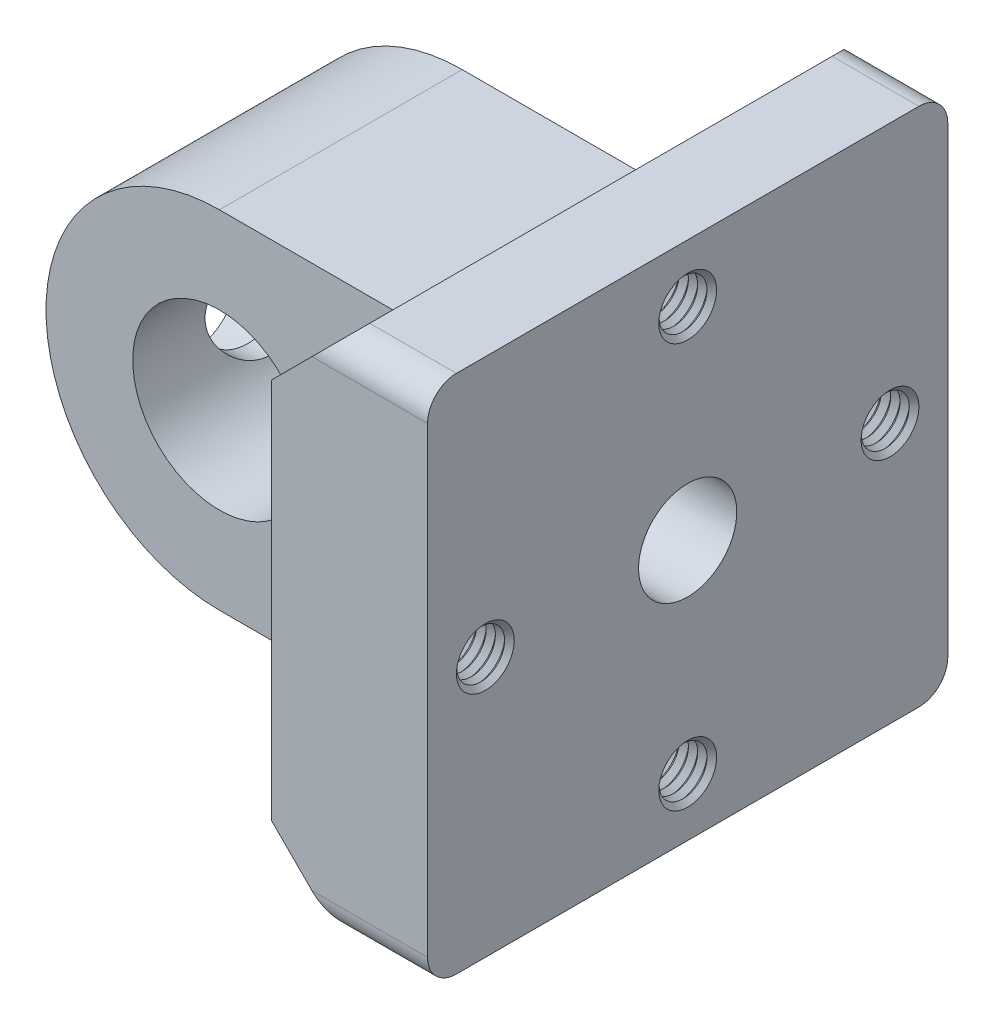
ISO-10303-21;
HEADER;
FILE_DESCRIPTION(('STEP AP214'),'2;1');
FILE_NAME('part.step','',(''),(''),'','','');
FILE_SCHEMA(('AUTOMOTIVE_DESIGN { 1 0 10303 214 1 1 1 1 }'));
ENDSEC;
DATA;
#1=APPLICATION_CONTEXT('core data for automotive mechanical design processes');
#2=APPLICATION_PROTOCOL_DEFINITION('international standard','automotive_design',2000,#1);
#3=PRODUCT_CONTEXT('',#1,'mechanical');
#4=PRODUCT('Part','Part','',(#3));
#5=PRODUCT_RELATED_PRODUCT_CATEGORY('part','',(#4));
#6=PRODUCT_DEFINITION_FORMATION('','',#4);
#7=PRODUCT_DEFINITION_CONTEXT('part definition',#1,'design');
#8=PRODUCT_DEFINITION('design','',#6,#7);
#9=PRODUCT_DEFINITION_SHAPE('','',#8);
#10=(LENGTH_UNIT() NAMED_UNIT(*) SI_UNIT(.MILLI.,.METRE.));
#11=(NAMED_UNIT(*) PLANE_ANGLE_UNIT() SI_UNIT($,.RADIAN.));
#12=(NAMED_UNIT(*) SI_UNIT($,.STERADIAN.) SOLID_ANGLE_UNIT());
#13=UNCERTAINTY_MEASURE_WITH_UNIT(LENGTH_MEASURE(1.E-05),#10,'distance_accuracy_value','');
#14=(GEOMETRIC_REPRESENTATION_CONTEXT(3) GLOBAL_UNCERTAINTY_ASSIGNED_CONTEXT((#13)) GLOBAL_UNIT_ASSIGNED_CONTEXT((#10,
#11,#12)) REPRESENTATION_CONTEXT('',''));
#15=CARTESIAN_POINT('',(0.,0.,0.));
#16=DIRECTION('',(0.,0.,1.));
#17=DIRECTION('',(1.,0.,0.));
#18=AXIS2_PLACEMENT_3D('',#15,#16,#17);
#19=CARTESIAN_POINT('',(-8.99999999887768,-17.4999999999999,-22.5));
#20=DIRECTION('',(1.,0.,0.));
#21=DIRECTION('',(0.,0.,-1.));
#22=AXIS2_PLACEMENT_3D('',#19,#20,#21);
#23=CONICAL_SURFACE('',#22,2.06699999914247,1.0297442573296);
#24=CARTESIAN_POINT('',(-10.2419789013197,-17.4999999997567,-22.5));
#25=VERTEX_POINT('',#24);
#26=VERTEX_LOOP('',#25);
#27=FACE_BOUND('',#26,.T.);
#28=CARTESIAN_POINT('',(-9.0000000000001,-17.4999999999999,-22.5));
#29=DIRECTION('',(-1.,0.,0.));
#30=DIRECTION('',(0.,0.,1.));
#31=AXIS2_PLACEMENT_3D('',#28,#29,#30);
#32=CIRCLE('',#31,2.067);
#33=CARTESIAN_POINT('',(-9.0000000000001,-17.4999999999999,-20.433));
#34=VERTEX_POINT('',#33);
#35=EDGE_CURVE('E119',#34,#34,#32,.F.);
#36=ORIENTED_EDGE('',*,*,#35,.T.);
#37=EDGE_LOOP('',(#36));
#38=FACE_BOUND('',#37,.T.);
#39=ADVANCED_FACE('F15',(#27,#38),#23,.F.);
#40=CARTESIAN_POINT('',(-8.99999999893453,0.,-40.));
#41=DIRECTION('',(1.,0.,0.));
#42=DIRECTION('',(0.,0.,-1.));
#43=AXIS2_PLACEMENT_3D('',#40,#41,#42);
#44=CONICAL_SURFACE('',#43,2.06699999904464,1.0297442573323);
#45=CARTESIAN_POINT('',(-10.2419789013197,2.27373675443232E-10,-40.));
#46=VERTEX_POINT('',#45);
#47=VERTEX_LOOP('',#46);
#48=FACE_BOUND('',#47,.T.);
#49=CARTESIAN_POINT('',(-9.00000000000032,0.,-40.));
#50=DIRECTION('',(-1.,0.,0.));
#51=DIRECTION('',(0.,0.,1.));
#52=AXIS2_PLACEMENT_3D('',#49,#50,#51);
#53=CIRCLE('',#52,2.067);
#54=CARTESIAN_POINT('',(-9.00000000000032,0.,-37.933));
#55=VERTEX_POINT('',#54);
#56=EDGE_CURVE('E121',#55,#55,#53,.F.);
#57=ORIENTED_EDGE('',*,*,#56,.T.);
#58=EDGE_LOOP('',(#57));
#59=FACE_BOUND('',#58,.T.);
#60=ADVANCED_FACE('F116',(#48,#59),#44,.F.);
#61=CARTESIAN_POINT('',(-8.99999999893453,17.5,-22.5));
#62=DIRECTION('',(1.,0.,0.));
#63=DIRECTION('',(0.,0.,-1.));
#64=AXIS2_PLACEMENT_3D('',#61,#62,#63);
#65=CONICAL_SURFACE('',#64,2.0669999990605,1.02974425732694);
#66=CARTESIAN_POINT('',(-10.2419789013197,17.5000000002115,-22.5));
#67=VERTEX_POINT('',#66);
#68=VERTEX_LOOP('',#67);
#69=FACE_BOUND('',#68,.T.);
#70=CARTESIAN_POINT('',(-9.00000000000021,17.5,-22.5));
#71=DIRECTION('',(-1.,0.,0.));
#72=DIRECTION('',(0.,0.,1.));
#73=AXIS2_PLACEMENT_3D('',#70,#71,#72);
#74=CIRCLE('',#73,2.067);
#75=CARTESIAN_POINT('',(-9.00000000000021,17.5,-20.433));
#76=VERTEX_POINT('',#75);
#77=EDGE_CURVE('E124',#76,#76,#74,.F.);
#78=ORIENTED_EDGE('',*,*,#77,.T.);
#79=EDGE_LOOP('',(#78));
#80=FACE_BOUND('',#79,.T.);
#81=ADVANCED_FACE('F737',(#69,#80),#65,.F.);
#82=CARTESIAN_POINT('',(-8.99999999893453,0.,-5.00000000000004));
#83=DIRECTION('',(1.,0.,0.));
#84=DIRECTION('',(0.,0.,-1.));
#85=AXIS2_PLACEMENT_3D('',#82,#83,#84);
#86=CONICAL_SURFACE('',#85,2.06699999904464,1.0297442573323);
#87=CARTESIAN_POINT('',(-10.2419789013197,2.27373675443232E-10,-5.00000000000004));
#88=VERTEX_POINT('',#87);
#89=VERTEX_LOOP('',#88);
#90=FACE_BOUND('',#89,.T.);
#91=CARTESIAN_POINT('',(-8.99999999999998,0.,-5.00000000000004));
#92=DIRECTION('',(-1.,0.,0.));
#93=DIRECTION('',(0.,0.,1.));
#94=AXIS2_PLACEMENT_3D('',#91,#92,#93);
#95=CIRCLE('',#94,2.067);
#96=CARTESIAN_POINT('',(-8.99999999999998,0.,-2.93300000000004));
#97=VERTEX_POINT('',#96);
#98=EDGE_CURVE('E727',#97,#97,#95,.F.);
#99=ORIENTED_EDGE('',*,*,#98,.T.);
#100=EDGE_LOOP('',(#99));
#101=FACE_BOUND('',#100,.T.);
#102=ADVANCED_FACE('F760',(#90,#101),#86,.F.);
#103=CARTESIAN_POINT('',(-4.0000000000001,-17.4999999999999,-22.5));
#104=DIRECTION('',(-1.,0.,0.));
#105=DIRECTION('',(0.,0.,1.));
#106=AXIS2_PLACEMENT_3D('',#103,#104,#105);
#107=CYLINDRICAL_SURFACE('',#106,2.067);
#108=CARTESIAN_POINT('',(-8.0000000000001,-17.4999999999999,-22.5));
#109=DIRECTION('',(-1.,0.,0.));
#110=DIRECTION('',(0.,0.,1.));
#111=AXIS2_PLACEMENT_3D('',#108,#109,#110);
#112=CIRCLE('',#111,2.067);
#113=CARTESIAN_POINT('',(-8.0000000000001,-17.4999999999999,-20.433));
#114=VERTEX_POINT('',#113);
#115=EDGE_CURVE('E18',#114,#114,#112,.F.);
#116=ORIENTED_EDGE('',*,*,#115,.T.);
#117=EDGE_LOOP('',(#116));
#118=FACE_BOUND('',#117,.T.);
#119=ORIENTED_EDGE('',*,*,#35,.F.);
#120=EDGE_LOOP('',(#119));
#121=FACE_BOUND('',#120,.T.);
#122=ADVANCED_FACE('F752',(#118,#121),#107,.F.);
#123=CARTESIAN_POINT('',(-4.00000000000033,0.,-40.));
#124=DIRECTION('',(-1.,0.,0.));
#125=DIRECTION('',(0.,0.,1.));
#126=AXIS2_PLACEMENT_3D('',#123,#124,#125);
#127=CYLINDRICAL_SURFACE('',#126,2.067);
#128=CARTESIAN_POINT('',(-8.00000000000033,0.,-40.));
#129=DIRECTION('',(-1.,0.,0.));
#130=DIRECTION('',(0.,0.,1.));
#131=AXIS2_PLACEMENT_3D('',#128,#129,#130);
#132=CIRCLE('',#131,2.067);
#133=CARTESIAN_POINT('',(-8.00000000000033,0.,-37.933));
#134=VERTEX_POINT('',#133);
#135=EDGE_CURVE('E1879',#134,#134,#132,.F.);
#136=ORIENTED_EDGE('',*,*,#135,.T.);
#137=EDGE_LOOP('',(#136));
#138=FACE_BOUND('',#137,.T.);
#139=ORIENTED_EDGE('',*,*,#56,.F.);
#140=EDGE_LOOP('',(#139));
#141=FACE_BOUND('',#140,.T.);
#142=ADVANCED_FACE('F742',(#138,#141),#127,.F.);
#143=CARTESIAN_POINT('',(-4.00000000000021,17.5,-22.5));
#144=DIRECTION('',(-1.,0.,0.));
#145=DIRECTION('',(0.,0.,1.));
#146=AXIS2_PLACEMENT_3D('',#143,#144,#145);
#147=CYLINDRICAL_SURFACE('',#146,2.067);
#148=CARTESIAN_POINT('',(-8.00000000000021,17.5,-22.5));
#149=DIRECTION('',(-1.,0.,0.));
#150=DIRECTION('',(0.,0.,1.));
#151=AXIS2_PLACEMENT_3D('',#148,#149,#150);
#152=CIRCLE('',#151,2.067);
#153=CARTESIAN_POINT('',(-8.00000000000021,17.5,-20.433));
#154=VERTEX_POINT('',#153);
#155=EDGE_CURVE('E1878',#154,#154,#152,.F.);
#156=ORIENTED_EDGE('',*,*,#155,.T.);
#157=EDGE_LOOP('',(#156));
#158=FACE_BOUND('',#157,.T.);
#159=ORIENTED_EDGE('',*,*,#77,.F.);
#160=EDGE_LOOP('',(#159));
#161=FACE_BOUND('',#160,.T.);
#162=ADVANCED_FACE('F739',(#158,#161),#147,.F.);
#163=CARTESIAN_POINT('',(-3.99999999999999,0.,-5.00000000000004));
#164=DIRECTION('',(-1.,0.,0.));
#165=DIRECTION('',(0.,0.,1.));
#166=AXIS2_PLACEMENT_3D('',#163,#164,#165);
#167=CYLINDRICAL_SURFACE('',#166,2.067);
#168=CARTESIAN_POINT('',(-7.99999999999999,0.,-5.00000000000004));
#169=DIRECTION('',(-1.,0.,0.));
#170=DIRECTION('',(0.,0.,1.));
#171=AXIS2_PLACEMENT_3D('',#168,#169,#170);
#172=CIRCLE('',#171,2.067);
#173=CARTESIAN_POINT('',(-7.99999999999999,0.,-2.93300000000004));
#174=VERTEX_POINT('',#173);
#175=EDGE_CURVE('E1875',#174,#174,#172,.F.);
#176=ORIENTED_EDGE('',*,*,#175,.T.);
#177=EDGE_LOOP('',(#176));
#178=FACE_BOUND('',#177,.T.);
#179=ORIENTED_EDGE('',*,*,#98,.F.);
#180=EDGE_LOOP('',(#179));
#181=FACE_BOUND('',#180,.T.);
#182=ADVANCED_FACE('F741',(#178,#181),#167,.F.);
#183=CARTESIAN_POINT('',(-8.0000000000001,-17.4999999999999,-22.5));
#184=DIRECTION('',(-1.,0.,0.));
#185=DIRECTION('',(0.,0.,1.));
#186=AXIS2_PLACEMENT_3D('',#183,#184,#185);
#187=PLANE('',#186);
#188=ORIENTED_EDGE('',*,*,#115,.F.);
#189=EDGE_LOOP('',(#188));
#190=FACE_BOUND('',#189,.T.);
#191=CARTESIAN_POINT('',(-8.00000000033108,-17.4999999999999,-22.5));
#192=DIRECTION('',(-1.,0.,0.));
#193=DIRECTION('',(0.,0.,1.));
#194=AXIS2_PLACEMENT_3D('',#191,#192,#193);
#195=CIRCLE('',#194,2.49999999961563);
#196=CARTESIAN_POINT('',(-8.00000000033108,-17.4999999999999,-20.0000000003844));
#197=VERTEX_POINT('',#196);
#198=EDGE_CURVE('E1872',#197,#197,#195,.F.);
#199=ORIENTED_EDGE('',*,*,#198,.T.);
#200=EDGE_LOOP('',(#199));
#201=FACE_BOUND('',#200,.T.);
#202=ADVANCED_FACE('F749',(#190,#201),#187,.F.);
#203=CARTESIAN_POINT('',(-8.00000000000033,0.,-40.));
#204=DIRECTION('',(-1.,0.,0.));
#205=DIRECTION('',(0.,0.,1.));
#206=AXIS2_PLACEMENT_3D('',#203,#204,#205);
#207=PLANE('',#206);
#208=ORIENTED_EDGE('',*,*,#135,.F.);
#209=EDGE_LOOP('',(#208));
#210=FACE_BOUND('',#209,.T.);
#211=CARTESIAN_POINT('',(-8.00000000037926,0.,-40.));
#212=DIRECTION('',(-1.,0.,0.));
#213=DIRECTION('',(0.,0.,1.));
#214=AXIS2_PLACEMENT_3D('',#211,#212,#213);
#215=CIRCLE('',#214,2.49999999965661);
#216=CARTESIAN_POINT('',(-8.00000000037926,0.,-37.5000000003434));
#217=VERTEX_POINT('',#216);
#218=EDGE_CURVE('E1869',#217,#217,#215,.F.);
#219=ORIENTED_EDGE('',*,*,#218,.T.);
#220=EDGE_LOOP('',(#219));
#221=FACE_BOUND('',#220,.T.);
#222=ADVANCED_FACE('F815',(#210,#221),#207,.F.);
#223=CARTESIAN_POINT('',(-8.00000000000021,17.5,-22.5));
#224=DIRECTION('',(-1.,0.,0.));
#225=DIRECTION('',(0.,0.,1.));
#226=AXIS2_PLACEMENT_3D('',#223,#224,#225);
#227=PLANE('',#226);
#228=ORIENTED_EDGE('',*,*,#155,.F.);
#229=EDGE_LOOP('',(#228));
#230=FACE_BOUND('',#229,.T.);
#231=CARTESIAN_POINT('',(-8.00000000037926,17.5,-22.5));
#232=DIRECTION('',(-1.,0.,0.));
#233=DIRECTION('',(0.,0.,1.));
#234=AXIS2_PLACEMENT_3D('',#231,#232,#233);
#235=CIRCLE('',#234,2.49999999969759);
#236=CARTESIAN_POINT('',(-8.00000000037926,17.5,-20.0000000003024));
#237=VERTEX_POINT('',#236);
#238=EDGE_CURVE('E1866',#237,#237,#235,.F.);
#239=ORIENTED_EDGE('',*,*,#238,.T.);
#240=EDGE_LOOP('',(#239));
#241=FACE_BOUND('',#240,.T.);
#242=ADVANCED_FACE('F824',(#230,#241),#227,.F.);
#243=CARTESIAN_POINT('',(-7.99999999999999,0.,-5.00000000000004));
#244=DIRECTION('',(-1.,0.,0.));
#245=DIRECTION('',(0.,0.,1.));
#246=AXIS2_PLACEMENT_3D('',#243,#244,#245);
#247=PLANE('',#246);
#248=ORIENTED_EDGE('',*,*,#175,.F.);
#249=EDGE_LOOP('',(#248));
#250=FACE_BOUND('',#249,.T.);
#251=CARTESIAN_POINT('',(-8.00000000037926,0.,-5.00000000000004));
#252=DIRECTION('',(-1.,0.,0.));
#253=DIRECTION('',(0.,0.,1.));
#254=AXIS2_PLACEMENT_3D('',#251,#252,#253);
#255=CIRCLE('',#254,2.49999999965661);
#256=CARTESIAN_POINT('',(-8.00000000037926,0.,-2.50000000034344));
#257=VERTEX_POINT('',#256);
#258=EDGE_CURVE('E724',#257,#257,#255,.F.);
#259=ORIENTED_EDGE('',*,*,#258,.T.);
#260=EDGE_LOOP('',(#259));
#261=FACE_BOUND('',#260,.T.);
#262=ADVANCED_FACE('F834',(#250,#261),#247,.F.);
#263=CARTESIAN_POINT('',(-8.0000000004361,-17.4999999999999,-22.5));
#264=DIRECTION('',(-1.,0.,0.));
#265=DIRECTION('',(0.,0.,1.));
#266=AXIS2_PLACEMENT_3D('',#263,#264,#265);
#267=CONICAL_SURFACE('',#266,2.49999999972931,0.824993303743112);
#268=CARTESIAN_POINT('',(-7.60000000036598,-17.4999999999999,-22.5));
#269=DIRECTION('',(1.,0.,0.));
#270=DIRECTION('',(0.,1.,0.));
#271=AXIS2_PLACEMENT_3D('',#268,#269,#270);
#272=CIRCLE('',#271,2.06700000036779);
#273=CARTESIAN_POINT('',(-7.60000000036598,-15.4329999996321,-22.5));
#274=VERTEX_POINT('',#273);
#275=EDGE_CURVE('E719',#274,#274,#272,.T.);
#276=ORIENTED_EDGE('',*,*,#275,.T.);
#277=EDGE_LOOP('',(#276));
#278=FACE_BOUND('',#277,.T.);
#279=ORIENTED_EDGE('',*,*,#198,.F.);
#280=EDGE_LOOP('',(#279));
#281=FACE_BOUND('',#280,.T.);
#282=ADVANCED_FACE('F844',(#278,#281),#267,.F.);
#283=CARTESIAN_POINT('',(-8.00000000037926,0.,-40.));
#284=DIRECTION('',(-1.,0.,0.));
#285=DIRECTION('',(0.,0.,1.));
#286=AXIS2_PLACEMENT_3D('',#283,#284,#285);
#287=CONICAL_SURFACE('',#286,2.49999999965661,0.82499330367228);
#288=CARTESIAN_POINT('',(-7.60000000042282,0.,-40.));
#289=DIRECTION('',(1.,0.,0.));
#290=DIRECTION('',(0.,1.,0.));
#291=AXIS2_PLACEMENT_3D('',#288,#289,#290);
#292=CIRCLE('',#291,2.06700000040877);
#293=CARTESIAN_POINT('',(-7.60000000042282,2.06700000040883,-40.));
#294=VERTEX_POINT('',#293);
#295=EDGE_CURVE('E714',#294,#294,#292,.T.);
#296=ORIENTED_EDGE('',*,*,#295,.T.);
#297=EDGE_LOOP('',(#296));
#298=FACE_BOUND('',#297,.T.);
#299=ORIENTED_EDGE('',*,*,#218,.F.);
#300=EDGE_LOOP('',(#299));
#301=FACE_BOUND('',#300,.T.);
#302=ADVANCED_FACE('F855',(#298,#301),#287,.F.);
#303=CARTESIAN_POINT('',(-8.00000000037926,17.5,-22.5));
#304=DIRECTION('',(-1.,0.,0.));
#305=DIRECTION('',(0.,0.,1.));
#306=AXIS2_PLACEMENT_3D('',#303,#304,#305);
#307=CONICAL_SURFACE('',#306,2.49999999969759,0.824993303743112);
#308=CARTESIAN_POINT('',(-7.60000000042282,17.5,-22.5));
#309=DIRECTION('',(1.,0.,0.));
#310=DIRECTION('',(0.,1.,0.));
#311=AXIS2_PLACEMENT_3D('',#308,#309,#310);
#312=CIRCLE('',#311,2.06700000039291);
#313=CARTESIAN_POINT('',(-7.60000000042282,19.5670000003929,-22.5));
#314=VERTEX_POINT('',#313);
#315=EDGE_CURVE('E709',#314,#314,#312,.T.);
#316=ORIENTED_EDGE('',*,*,#315,.T.);
#317=EDGE_LOOP('',(#316));
#318=FACE_BOUND('',#317,.T.);
#319=ORIENTED_EDGE('',*,*,#238,.F.);
#320=EDGE_LOOP('',(#319));
#321=FACE_BOUND('',#320,.T.);
#322=ADVANCED_FACE('F866',(#318,#321),#307,.F.);
#323=CARTESIAN_POINT('',(-8.00000000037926,0.,-5.00000000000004));
#324=DIRECTION('',(-1.,0.,0.));
#325=DIRECTION('',(0.,0.,1.));
#326=AXIS2_PLACEMENT_3D('',#323,#324,#325);
#327=CONICAL_SURFACE('',#326,2.49999999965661,0.82499330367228);
#328=CARTESIAN_POINT('',(-7.60000000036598,0.,-5.00000000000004));
#329=DIRECTION('',(1.,0.,0.));
#330=DIRECTION('',(0.,1.,0.));
#331=AXIS2_PLACEMENT_3D('',#328,#329,#330);
#332=CIRCLE('',#331,2.06700000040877);
#333=CARTESIAN_POINT('',(-7.60000000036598,2.06700000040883,-5.00000000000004));
#334=VERTEX_POINT('',#333);
#335=EDGE_CURVE('E704',#334,#334,#332,.T.);
#336=ORIENTED_EDGE('',*,*,#335,.T.);
#337=EDGE_LOOP('',(#336));
#338=FACE_BOUND('',#337,.T.);
#339=ORIENTED_EDGE('',*,*,#258,.F.);
#340=EDGE_LOOP('',(#339));
#341=FACE_BOUND('',#340,.T.);
#342=ADVANCED_FACE('F876',(#338,#341),#327,.F.);
#343=CARTESIAN_POINT('',(-7.20000000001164,-17.4999999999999,-22.5));
#344=DIRECTION('',(1.,0.,0.));
#345=DIRECTION('',(0.,0.,-1.));
#346=AXIS2_PLACEMENT_3D('',#343,#344,#345);
#347=CONICAL_SURFACE('',#346,2.49999999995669,0.824993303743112);
#348=CARTESIAN_POINT('',(-7.2000000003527,-17.4999999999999,-22.5));
#349=DIRECTION('',(-1.,0.,0.));
#350=DIRECTION('',(0.,1.,0.));
#351=AXIS2_PLACEMENT_3D('',#348,#349,#350);
#352=CIRCLE('',#351,2.49999999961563);
#353=CARTESIAN_POINT('',(-7.2000000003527,-15.0000000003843,-22.5));
#354=VERTEX_POINT('',#353);
#355=EDGE_CURVE('E699',#354,#354,#352,.F.);
#356=ORIENTED_EDGE('',*,*,#355,.T.);
#357=EDGE_LOOP('',(#356));
#358=FACE_BOUND('',#357,.T.);
#359=ORIENTED_EDGE('',*,*,#275,.F.);
#360=EDGE_LOOP('',(#359));
#361=FACE_BOUND('',#360,.T.);
#362=ADVANCED_FACE('F886',(#358,#361),#347,.F.);
#363=CARTESIAN_POINT('',(-7.20000000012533,0.,-40.));
#364=DIRECTION('',(1.,0.,0.));
#365=DIRECTION('',(0.,0.,-1.));
#366=AXIS2_PLACEMENT_3D('',#363,#364,#365);
#367=CONICAL_SURFACE('',#366,2.49999999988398,0.824993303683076);
#368=CARTESIAN_POINT('',(-7.2000000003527,0.,-40.));
#369=DIRECTION('',(-1.,0.,0.));
#370=DIRECTION('',(0.,1.,0.));
#371=AXIS2_PLACEMENT_3D('',#368,#369,#370);
#372=CIRCLE('',#371,2.49999999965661);
#373=CARTESIAN_POINT('',(-7.2000000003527,2.49999999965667,-40.));
#374=VERTEX_POINT('',#373);
#375=EDGE_CURVE('E694',#374,#374,#372,.F.);
#376=ORIENTED_EDGE('',*,*,#375,.T.);
#377=EDGE_LOOP('',(#376));
#378=FACE_BOUND('',#377,.T.);
#379=ORIENTED_EDGE('',*,*,#295,.F.);
#380=EDGE_LOOP('',(#379));
#381=FACE_BOUND('',#380,.T.);
#382=ADVANCED_FACE('F896',(#378,#381),#367,.F.);
#383=CARTESIAN_POINT('',(-7.19999999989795,17.5,-22.5));
#384=DIRECTION('',(1.,0.,0.));
#385=DIRECTION('',(0.,0.,-1.));
#386=AXIS2_PLACEMENT_3D('',#383,#384,#385);
#387=CONICAL_SURFACE('',#386,2.5000000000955,0.824993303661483);
#388=CARTESIAN_POINT('',(-7.2000000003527,17.5,-22.5));
#389=DIRECTION('',(-1.,0.,0.));
#390=DIRECTION('',(0.,1.,0.));
#391=AXIS2_PLACEMENT_3D('',#388,#389,#390);
#392=CIRCLE('',#391,2.49999999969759);
#393=CARTESIAN_POINT('',(-7.2000000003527,19.9999999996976,-22.5));
#394=VERTEX_POINT('',#393);
#395=EDGE_CURVE('E689',#394,#394,#392,.F.);
#396=ORIENTED_EDGE('',*,*,#395,.T.);
#397=EDGE_LOOP('',(#396));
#398=FACE_BOUND('',#397,.T.);
#399=ORIENTED_EDGE('',*,*,#315,.F.);
#400=EDGE_LOOP('',(#399));
#401=FACE_BOUND('',#400,.T.);
#402=ADVANCED_FACE('F905',(#398,#401),#387,.F.);
#403=CARTESIAN_POINT('',(-7.20000000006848,0.,-5.00000000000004));
#404=DIRECTION('',(1.,0.,0.));
#405=DIRECTION('',(0.,0.,-1.));
#406=AXIS2_PLACEMENT_3D('',#403,#404,#405);
#407=CONICAL_SURFACE('',#406,2.49999999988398,0.824993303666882);
#408=CARTESIAN_POINT('',(-7.2000000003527,0.,-5.00000000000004));
#409=DIRECTION('',(-1.,0.,0.));
#410=DIRECTION('',(0.,1.,0.));
#411=AXIS2_PLACEMENT_3D('',#408,#409,#410);
#412=CIRCLE('',#411,2.49999999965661);
#413=CARTESIAN_POINT('',(-7.2000000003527,2.49999999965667,-5.00000000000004));
#414=VERTEX_POINT('',#413);
#415=EDGE_CURVE('E684',#414,#414,#412,.F.);
#416=ORIENTED_EDGE('',*,*,#415,.T.);
#417=EDGE_LOOP('',(#416));
#418=FACE_BOUND('',#417,.T.);
#419=ORIENTED_EDGE('',*,*,#335,.F.);
#420=EDGE_LOOP('',(#419));
#421=FACE_BOUND('',#420,.T.);
#422=ADVANCED_FACE('F915',(#418,#421),#407,.F.);
#423=CARTESIAN_POINT('',(-7.20000000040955,-17.4999999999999,-22.5));
#424=DIRECTION('',(-1.,0.,0.));
#425=DIRECTION('',(0.,0.,1.));
#426=AXIS2_PLACEMENT_3D('',#423,#424,#425);
#427=CONICAL_SURFACE('',#426,2.49999999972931,0.824993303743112);
#428=CARTESIAN_POINT('',(-6.80000000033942,-17.4999999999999,-22.5));
#429=DIRECTION('',(1.,0.,0.));
#430=DIRECTION('',(0.,1.,0.));
#431=AXIS2_PLACEMENT_3D('',#428,#429,#430);
#432=CIRCLE('',#431,2.06700000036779);
#433=CARTESIAN_POINT('',(-6.80000000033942,-15.4329999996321,-22.5));
#434=VERTEX_POINT('',#433);
#435=EDGE_CURVE('E679',#434,#434,#432,.T.);
#436=ORIENTED_EDGE('',*,*,#435,.T.);
#437=EDGE_LOOP('',(#436));
#438=FACE_BOUND('',#437,.T.);
#439=ORIENTED_EDGE('',*,*,#355,.F.);
#440=EDGE_LOOP('',(#439));
#441=FACE_BOUND('',#440,.T.);
#442=ADVANCED_FACE('F925',(#438,#441),#427,.F.);
#443=CARTESIAN_POINT('',(-7.2000000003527,0.,-40.));
#444=DIRECTION('',(-1.,0.,0.));
#445=DIRECTION('',(0.,0.,1.));
#446=AXIS2_PLACEMENT_3D('',#443,#444,#445);
#447=CONICAL_SURFACE('',#446,2.49999999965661,0.82499330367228);
#448=CARTESIAN_POINT('',(-6.80000000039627,0.,-40.));
#449=DIRECTION('',(1.,0.,0.));
#450=DIRECTION('',(0.,1.,0.));
#451=AXIS2_PLACEMENT_3D('',#448,#449,#450);
#452=CIRCLE('',#451,2.06700000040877);
#453=CARTESIAN_POINT('',(-6.80000000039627,2.06700000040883,-40.));
#454=VERTEX_POINT('',#453);
#455=EDGE_CURVE('E674',#454,#454,#452,.T.);
#456=ORIENTED_EDGE('',*,*,#455,.T.);
#457=EDGE_LOOP('',(#456));
#458=FACE_BOUND('',#457,.T.);
#459=ORIENTED_EDGE('',*,*,#375,.F.);
#460=EDGE_LOOP('',(#459));
#461=FACE_BOUND('',#460,.T.);
#462=ADVANCED_FACE('F936',(#458,#461),#447,.F.);
#463=CARTESIAN_POINT('',(-7.2000000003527,17.5,-22.5));
#464=DIRECTION('',(-1.,0.,0.));
#465=DIRECTION('',(0.,0.,1.));
#466=AXIS2_PLACEMENT_3D('',#463,#464,#465);
#467=CONICAL_SURFACE('',#466,2.49999999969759,0.824993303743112);
#468=CARTESIAN_POINT('',(-6.80000000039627,17.5,-22.5));
#469=DIRECTION('',(1.,0.,0.));
#470=DIRECTION('',(0.,1.,0.));
#471=AXIS2_PLACEMENT_3D('',#468,#469,#470);
#472=CIRCLE('',#471,2.06700000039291);
#473=CARTESIAN_POINT('',(-6.80000000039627,19.5670000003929,-22.5));
#474=VERTEX_POINT('',#473);
#475=EDGE_CURVE('E669',#474,#474,#472,.T.);
#476=ORIENTED_EDGE('',*,*,#475,.T.);
#477=EDGE_LOOP('',(#476));
#478=FACE_BOUND('',#477,.T.);
#479=ORIENTED_EDGE('',*,*,#395,.F.);
#480=EDGE_LOOP('',(#479));
#481=FACE_BOUND('',#480,.T.);
#482=ADVANCED_FACE('F946',(#478,#481),#467,.F.);
#483=CARTESIAN_POINT('',(-7.2000000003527,0.,-5.00000000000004));
#484=DIRECTION('',(-1.,0.,0.));
#485=DIRECTION('',(0.,0.,1.));
#486=AXIS2_PLACEMENT_3D('',#483,#484,#485);
#487=CONICAL_SURFACE('',#486,2.49999999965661,0.82499330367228);
#488=CARTESIAN_POINT('',(-6.80000000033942,0.,-5.00000000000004));
#489=DIRECTION('',(1.,0.,0.));
#490=DIRECTION('',(0.,1.,0.));
#491=AXIS2_PLACEMENT_3D('',#488,#489,#490);
#492=CIRCLE('',#491,2.06700000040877);
#493=CARTESIAN_POINT('',(-6.80000000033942,2.06700000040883,-5.00000000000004));
#494=VERTEX_POINT('',#493);
#495=EDGE_CURVE('E664',#494,#494,#492,.T.);
#496=ORIENTED_EDGE('',*,*,#495,.T.);
#497=EDGE_LOOP('',(#496));
#498=FACE_BOUND('',#497,.T.);
#499=ORIENTED_EDGE('',*,*,#415,.F.);
#500=EDGE_LOOP('',(#499));
#501=FACE_BOUND('',#500,.T.);
#502=ADVANCED_FACE('F956',(#498,#501),#487,.F.);
#503=CARTESIAN_POINT('',(-6.39999999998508,-17.4999999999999,-22.5));
#504=DIRECTION('',(1.,0.,0.));
#505=DIRECTION('',(0.,0.,-1.));
#506=AXIS2_PLACEMENT_3D('',#503,#504,#505);
#507=CONICAL_SURFACE('',#506,2.49999999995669,0.824993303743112);
#508=CARTESIAN_POINT('',(-6.40000000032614,-17.4999999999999,-22.5));
#509=DIRECTION('',(-1.,0.,0.));
#510=DIRECTION('',(0.,1.,0.));
#511=AXIS2_PLACEMENT_3D('',#508,#509,#510);
#512=CIRCLE('',#511,2.49999999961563);
#513=CARTESIAN_POINT('',(-6.40000000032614,-15.0000000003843,-22.5));
#514=VERTEX_POINT('',#513);
#515=EDGE_CURVE('E659',#514,#514,#512,.F.);
#516=ORIENTED_EDGE('',*,*,#515,.T.);
#517=EDGE_LOOP('',(#516));
#518=FACE_BOUND('',#517,.T.);
#519=ORIENTED_EDGE('',*,*,#435,.F.);
#520=EDGE_LOOP('',(#519));
#521=FACE_BOUND('',#520,.T.);
#522=ADVANCED_FACE('F966',(#518,#521),#507,.F.);
#523=CARTESIAN_POINT('',(-6.40000000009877,0.,-40.));
#524=DIRECTION('',(1.,0.,0.));
#525=DIRECTION('',(0.,0.,-1.));
#526=AXIS2_PLACEMENT_3D('',#523,#524,#525);
#527=CONICAL_SURFACE('',#526,2.49999999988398,0.824993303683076);
#528=CARTESIAN_POINT('',(-6.40000000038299,0.,-40.));
#529=DIRECTION('',(-1.,0.,0.));
#530=DIRECTION('',(0.,1.,0.));
#531=AXIS2_PLACEMENT_3D('',#528,#529,#530);
#532=CIRCLE('',#531,2.49999999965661);
#533=CARTESIAN_POINT('',(-6.40000000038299,2.49999999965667,-40.));
#534=VERTEX_POINT('',#533);
#535=EDGE_CURVE('E654',#534,#534,#532,.F.);
#536=ORIENTED_EDGE('',*,*,#535,.T.);
#537=EDGE_LOOP('',(#536));
#538=FACE_BOUND('',#537,.T.);
#539=ORIENTED_EDGE('',*,*,#455,.F.);
#540=EDGE_LOOP('',(#539));
#541=FACE_BOUND('',#540,.T.);
#542=ADVANCED_FACE('F976',(#538,#541),#527,.F.);
#543=CARTESIAN_POINT('',(-6.3999999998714,17.5,-22.5));
#544=DIRECTION('',(1.,0.,0.));
#545=DIRECTION('',(0.,0.,-1.));
#546=AXIS2_PLACEMENT_3D('',#543,#544,#545);
#547=CONICAL_SURFACE('',#546,2.5000000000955,0.824993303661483);
#548=CARTESIAN_POINT('',(-6.40000000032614,17.5,-22.5));
#549=DIRECTION('',(-1.,0.,0.));
#550=DIRECTION('',(0.,1.,0.));
#551=AXIS2_PLACEMENT_3D('',#548,#549,#550);
#552=CIRCLE('',#551,2.49999999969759);
#553=CARTESIAN_POINT('',(-6.40000000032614,19.9999999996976,-22.5));
#554=VERTEX_POINT('',#553);
#555=EDGE_CURVE('E649',#554,#554,#552,.F.);
#556=ORIENTED_EDGE('',*,*,#555,.T.);
#557=EDGE_LOOP('',(#556));
#558=FACE_BOUND('',#557,.T.);
#559=ORIENTED_EDGE('',*,*,#475,.F.);
#560=EDGE_LOOP('',(#559));
#561=FACE_BOUND('',#560,.T.);
#562=ADVANCED_FACE('F985',(#558,#561),#547,.F.);
#563=CARTESIAN_POINT('',(-6.40000000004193,0.,-5.00000000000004));
#564=DIRECTION('',(1.,0.,0.));
#565=DIRECTION('',(0.,0.,-1.));
#566=AXIS2_PLACEMENT_3D('',#563,#564,#565);
#567=CONICAL_SURFACE('',#566,2.49999999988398,0.824993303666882);
#568=CARTESIAN_POINT('',(-6.40000000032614,0.,-5.00000000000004));
#569=DIRECTION('',(-1.,0.,0.));
#570=DIRECTION('',(0.,1.,0.));
#571=AXIS2_PLACEMENT_3D('',#568,#569,#570);
#572=CIRCLE('',#571,2.49999999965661);
#573=CARTESIAN_POINT('',(-6.40000000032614,2.49999999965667,-5.00000000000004));
#574=VERTEX_POINT('',#573);
#575=EDGE_CURVE('E644',#574,#574,#572,.F.);
#576=ORIENTED_EDGE('',*,*,#575,.T.);
#577=EDGE_LOOP('',(#576));
#578=FACE_BOUND('',#577,.T.);
#579=ORIENTED_EDGE('',*,*,#495,.F.);
#580=EDGE_LOOP('',(#579));
#581=FACE_BOUND('',#580,.T.);
#582=ADVANCED_FACE('F995',(#578,#581),#567,.F.);
#583=CARTESIAN_POINT('',(-6.40000000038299,-17.4999999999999,-22.5));
#584=DIRECTION('',(-1.,0.,0.));
#585=DIRECTION('',(0.,0.,1.));
#586=AXIS2_PLACEMENT_3D('',#583,#584,#585);
#587=CONICAL_SURFACE('',#586,2.49999999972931,0.824993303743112);
#588=CARTESIAN_POINT('',(-6.00000000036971,-17.4999999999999,-22.5));
#589=DIRECTION('',(1.,0.,0.));
#590=DIRECTION('',(0.,1.,0.));
#591=AXIS2_PLACEMENT_3D('',#588,#589,#590);
#592=CIRCLE('',#591,2.06700000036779);
#593=CARTESIAN_POINT('',(-6.00000000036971,-15.4329999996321,-22.5));
#594=VERTEX_POINT('',#593);
#595=EDGE_CURVE('E639',#594,#594,#592,.T.);
#596=ORIENTED_EDGE('',*,*,#595,.T.);
#597=EDGE_LOOP('',(#596));
#598=FACE_BOUND('',#597,.T.);
#599=ORIENTED_EDGE('',*,*,#515,.F.);
#600=EDGE_LOOP('',(#599));
#601=FACE_BOUND('',#600,.T.);
#602=ADVANCED_FACE('F1005',(#598,#601),#587,.F.);
#603=CARTESIAN_POINT('',(-6.40000000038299,0.,-40.));
#604=DIRECTION('',(-1.,0.,0.));
#605=DIRECTION('',(0.,0.,1.));
#606=AXIS2_PLACEMENT_3D('',#603,#604,#605);
#607=CONICAL_SURFACE('',#606,2.49999999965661,0.82499330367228);
#608=CARTESIAN_POINT('',(-6.00000000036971,0.,-40.));
#609=DIRECTION('',(1.,0.,0.));
#610=DIRECTION('',(0.,1.,0.));
#611=AXIS2_PLACEMENT_3D('',#608,#609,#610);
#612=CIRCLE('',#611,2.06700000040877);
#613=CARTESIAN_POINT('',(-6.00000000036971,2.06700000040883,-40.));
#614=VERTEX_POINT('',#613);
#615=EDGE_CURVE('E634',#614,#614,#612,.T.);
#616=ORIENTED_EDGE('',*,*,#615,.T.);
#617=EDGE_LOOP('',(#616));
#618=FACE_BOUND('',#617,.T.);
#619=ORIENTED_EDGE('',*,*,#535,.F.);
#620=EDGE_LOOP('',(#619));
#621=FACE_BOUND('',#620,.T.);
#622=ADVANCED_FACE('F1016',(#618,#621),#607,.F.);
#623=CARTESIAN_POINT('',(-6.40000000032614,17.5,-22.5));
#624=DIRECTION('',(-1.,0.,0.));
#625=DIRECTION('',(0.,0.,1.));
#626=AXIS2_PLACEMENT_3D('',#623,#624,#625);
#627=CONICAL_SURFACE('',#626,2.49999999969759,0.824993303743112);
#628=CARTESIAN_POINT('',(-6.00000000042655,17.5,-22.5));
#629=DIRECTION('',(1.,0.,0.));
#630=DIRECTION('',(0.,1.,0.));
#631=AXIS2_PLACEMENT_3D('',#628,#629,#630);
#632=CIRCLE('',#631,2.06700000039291);
#633=CARTESIAN_POINT('',(-6.00000000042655,19.5670000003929,-22.5));
#634=VERTEX_POINT('',#633);
#635=EDGE_CURVE('E629',#634,#634,#632,.T.);
#636=ORIENTED_EDGE('',*,*,#635,.T.);
#637=EDGE_LOOP('',(#636));
#638=FACE_BOUND('',#637,.T.);
#639=ORIENTED_EDGE('',*,*,#555,.F.);
#640=EDGE_LOOP('',(#639));
#641=FACE_BOUND('',#640,.T.);
#642=ADVANCED_FACE('F1026',(#638,#641),#627,.F.);
#643=CARTESIAN_POINT('',(-6.40000000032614,0.,-5.00000000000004));
#644=DIRECTION('',(-1.,0.,0.));
#645=DIRECTION('',(0.,0.,1.));
#646=AXIS2_PLACEMENT_3D('',#643,#644,#645);
#647=CONICAL_SURFACE('',#646,2.49999999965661,0.82499330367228);
#648=CARTESIAN_POINT('',(-6.00000000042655,0.,-5.00000000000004));
#649=DIRECTION('',(1.,0.,0.));
#650=DIRECTION('',(0.,1.,0.));
#651=AXIS2_PLACEMENT_3D('',#648,#649,#650);
#652=CIRCLE('',#651,2.06700000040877);
#653=CARTESIAN_POINT('',(-6.00000000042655,2.06700000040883,-5.00000000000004));
#654=VERTEX_POINT('',#653);
#655=EDGE_CURVE('E624',#654,#654,#652,.T.);
#656=ORIENTED_EDGE('',*,*,#655,.T.);
#657=EDGE_LOOP('',(#656));
#658=FACE_BOUND('',#657,.T.);
#659=ORIENTED_EDGE('',*,*,#575,.F.);
#660=EDGE_LOOP('',(#659));
#661=FACE_BOUND('',#660,.T.);
#662=ADVANCED_FACE('F1036',(#658,#661),#647,.F.);
#663=CARTESIAN_POINT('',(-5.60000000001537,-17.4999999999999,-22.5));
#664=DIRECTION('',(1.,0.,0.));
#665=DIRECTION('',(0.,0.,-1.));
#666=AXIS2_PLACEMENT_3D('',#663,#664,#665);
#667=CONICAL_SURFACE('',#666,2.49999999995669,0.824993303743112);
#668=CARTESIAN_POINT('',(-5.60000000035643,-17.4999999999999,-22.5));
#669=DIRECTION('',(-1.,0.,0.));
#670=DIRECTION('',(0.,1.,0.));
#671=AXIS2_PLACEMENT_3D('',#668,#669,#670);
#672=CIRCLE('',#671,2.49999999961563);
#673=CARTESIAN_POINT('',(-5.60000000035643,-15.0000000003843,-22.5));
#674=VERTEX_POINT('',#673);
#675=EDGE_CURVE('E619',#674,#674,#672,.F.);
#676=ORIENTED_EDGE('',*,*,#675,.T.);
#677=EDGE_LOOP('',(#676));
#678=FACE_BOUND('',#677,.T.);
#679=ORIENTED_EDGE('',*,*,#595,.F.);
#680=EDGE_LOOP('',(#679));
#681=FACE_BOUND('',#680,.T.);
#682=ADVANCED_FACE('F1046',(#678,#681),#667,.F.);
#683=CARTESIAN_POINT('',(-5.60000000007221,0.,-40.));
#684=DIRECTION('',(1.,0.,0.));
#685=DIRECTION('',(0.,0.,-1.));
#686=AXIS2_PLACEMENT_3D('',#683,#684,#685);
#687=CONICAL_SURFACE('',#686,2.49999999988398,0.824993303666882);
#688=CARTESIAN_POINT('',(-5.60000000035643,0.,-40.));
#689=DIRECTION('',(-1.,0.,0.));
#690=DIRECTION('',(0.,1.,0.));
#691=AXIS2_PLACEMENT_3D('',#688,#689,#690);
#692=CIRCLE('',#691,2.49999999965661);
#693=CARTESIAN_POINT('',(-5.60000000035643,2.49999999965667,-40.));
#694=VERTEX_POINT('',#693);
#695=EDGE_CURVE('E614',#694,#694,#692,.F.);
#696=ORIENTED_EDGE('',*,*,#695,.T.);
#697=EDGE_LOOP('',(#696));
#698=FACE_BOUND('',#697,.T.);
#699=ORIENTED_EDGE('',*,*,#615,.F.);
#700=EDGE_LOOP('',(#699));
#701=FACE_BOUND('',#700,.T.);
#702=ADVANCED_FACE('F1056',(#698,#701),#687,.F.);
#703=CARTESIAN_POINT('',(-5.59999999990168,17.5,-22.5));
#704=DIRECTION('',(1.,0.,0.));
#705=DIRECTION('',(0.,0.,-1.));
#706=AXIS2_PLACEMENT_3D('',#703,#704,#705);
#707=CONICAL_SURFACE('',#706,2.5000000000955,0.824993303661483);
#708=CARTESIAN_POINT('',(-5.60000000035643,17.5,-22.5));
#709=DIRECTION('',(-1.,0.,0.));
#710=DIRECTION('',(0.,1.,0.));
#711=AXIS2_PLACEMENT_3D('',#708,#709,#710);
#712=CIRCLE('',#711,2.49999999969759);
#713=CARTESIAN_POINT('',(-5.60000000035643,19.9999999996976,-22.5));
#714=VERTEX_POINT('',#713);
#715=EDGE_CURVE('E609',#714,#714,#712,.F.);
#716=ORIENTED_EDGE('',*,*,#715,.T.);
#717=EDGE_LOOP('',(#716));
#718=FACE_BOUND('',#717,.T.);
#719=ORIENTED_EDGE('',*,*,#635,.F.);
#720=EDGE_LOOP('',(#719));
#721=FACE_BOUND('',#720,.T.);
#722=ADVANCED_FACE('F1065',(#718,#721),#707,.F.);
#723=CARTESIAN_POINT('',(-5.60000000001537,0.,-5.00000000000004));
#724=DIRECTION('',(1.,0.,0.));
#725=DIRECTION('',(0.,0.,-1.));
#726=AXIS2_PLACEMENT_3D('',#723,#724,#725);
#727=CONICAL_SURFACE('',#726,2.50000000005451,0.824993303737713);
#728=CARTESIAN_POINT('',(-5.60000000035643,0.,-5.00000000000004));
#729=DIRECTION('',(-1.,0.,0.));
#730=DIRECTION('',(0.,1.,0.));
#731=AXIS2_PLACEMENT_3D('',#728,#729,#730);
#732=CIRCLE('',#731,2.49999999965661);
#733=CARTESIAN_POINT('',(-5.60000000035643,2.49999999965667,-5.00000000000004));
#734=VERTEX_POINT('',#733);
#735=EDGE_CURVE('E604',#734,#734,#732,.F.);
#736=ORIENTED_EDGE('',*,*,#735,.T.);
#737=EDGE_LOOP('',(#736));
#738=FACE_BOUND('',#737,.T.);
#739=ORIENTED_EDGE('',*,*,#655,.F.);
#740=EDGE_LOOP('',(#739));
#741=FACE_BOUND('',#740,.T.);
#742=ADVANCED_FACE('F1075',(#738,#741),#727,.F.);
#743=CARTESIAN_POINT('',(-5.60000000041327,-17.4999999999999,-22.5));
#744=DIRECTION('',(-1.,0.,0.));
#745=DIRECTION('',(0.,0.,1.));
#746=AXIS2_PLACEMENT_3D('',#743,#744,#745);
#747=CONICAL_SURFACE('',#746,2.49999999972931,0.824993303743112);
#748=CARTESIAN_POINT('',(-5.2000000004,-17.4999999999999,-22.5));
#749=DIRECTION('',(1.,0.,0.));
#750=DIRECTION('',(0.,1.,0.));
#751=AXIS2_PLACEMENT_3D('',#748,#749,#750);
#752=CIRCLE('',#751,2.06700000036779);
#753=CARTESIAN_POINT('',(-5.2000000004,-15.4329999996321,-22.5));
#754=VERTEX_POINT('',#753);
#755=EDGE_CURVE('E599',#754,#754,#752,.T.);
#756=ORIENTED_EDGE('',*,*,#755,.T.);
#757=EDGE_LOOP('',(#756));
#758=FACE_BOUND('',#757,.T.);
#759=ORIENTED_EDGE('',*,*,#675,.F.);
#760=EDGE_LOOP('',(#759));
#761=FACE_BOUND('',#760,.T.);
#762=ADVANCED_FACE('F1085',(#758,#761),#747,.F.);
#763=CARTESIAN_POINT('',(-5.60000000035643,0.,-40.));
#764=DIRECTION('',(-1.,0.,0.));
#765=DIRECTION('',(0.,0.,1.));
#766=AXIS2_PLACEMENT_3D('',#763,#764,#765);
#767=CONICAL_SURFACE('',#766,2.49999999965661,0.82499330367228);
#768=CARTESIAN_POINT('',(-5.20000000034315,0.,-40.));
#769=DIRECTION('',(1.,0.,0.));
#770=DIRECTION('',(0.,1.,0.));
#771=AXIS2_PLACEMENT_3D('',#768,#769,#770);
#772=CIRCLE('',#771,2.06700000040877);
#773=CARTESIAN_POINT('',(-5.20000000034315,2.06700000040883,-40.));
#774=VERTEX_POINT('',#773);
#775=EDGE_CURVE('E594',#774,#774,#772,.T.);
#776=ORIENTED_EDGE('',*,*,#775,.T.);
#777=EDGE_LOOP('',(#776));
#778=FACE_BOUND('',#777,.T.);
#779=ORIENTED_EDGE('',*,*,#695,.F.);
#780=EDGE_LOOP('',(#779));
#781=FACE_BOUND('',#780,.T.);
#782=ADVANCED_FACE('F1096',(#778,#781),#767,.F.);
#783=CARTESIAN_POINT('',(-5.60000000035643,17.5,-22.5));
#784=DIRECTION('',(-1.,0.,0.));
#785=DIRECTION('',(0.,0.,1.));
#786=AXIS2_PLACEMENT_3D('',#783,#784,#785);
#787=CONICAL_SURFACE('',#786,2.49999999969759,0.824993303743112);
#788=CARTESIAN_POINT('',(-5.2000000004,17.5,-22.5));
#789=DIRECTION('',(1.,0.,0.));
#790=DIRECTION('',(0.,1.,0.));
#791=AXIS2_PLACEMENT_3D('',#788,#789,#790);
#792=CIRCLE('',#791,2.06700000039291);
#793=CARTESIAN_POINT('',(-5.2000000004,19.5670000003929,-22.5));
#794=VERTEX_POINT('',#793);
#795=EDGE_CURVE('E589',#794,#794,#792,.T.);
#796=ORIENTED_EDGE('',*,*,#795,.T.);
#797=EDGE_LOOP('',(#796));
#798=FACE_BOUND('',#797,.T.);
#799=ORIENTED_EDGE('',*,*,#715,.F.);
#800=EDGE_LOOP('',(#799));
#801=FACE_BOUND('',#800,.T.);
#802=ADVANCED_FACE('F1106',(#798,#801),#787,.F.);
#803=CARTESIAN_POINT('',(-5.60000000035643,0.,-5.00000000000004));
#804=DIRECTION('',(-1.,0.,0.));
#805=DIRECTION('',(0.,0.,1.));
#806=AXIS2_PLACEMENT_3D('',#803,#804,#805);
#807=CONICAL_SURFACE('',#806,2.49999999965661,0.82499330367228);
#808=CARTESIAN_POINT('',(-5.20000000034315,0.,-5.00000000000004));
#809=DIRECTION('',(1.,0.,0.));
#810=DIRECTION('',(0.,1.,0.));
#811=AXIS2_PLACEMENT_3D('',#808,#809,#810);
#812=CIRCLE('',#811,2.06700000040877);
#813=CARTESIAN_POINT('',(-5.20000000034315,2.06700000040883,-5.00000000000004));
#814=VERTEX_POINT('',#813);
#815=EDGE_CURVE('E584',#814,#814,#812,.T.);
#816=ORIENTED_EDGE('',*,*,#815,.T.);
#817=EDGE_LOOP('',(#816));
#818=FACE_BOUND('',#817,.T.);
#819=ORIENTED_EDGE('',*,*,#735,.F.);
#820=EDGE_LOOP('',(#819));
#821=FACE_BOUND('',#820,.T.);
#822=ADVANCED_FACE('F1116',(#818,#821),#807,.F.);
#823=CARTESIAN_POINT('',(-4.79999999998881,-17.4999999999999,-22.5));
#824=DIRECTION('',(1.,0.,0.));
#825=DIRECTION('',(0.,0.,-1.));
#826=AXIS2_PLACEMENT_3D('',#823,#824,#825);
#827=CONICAL_SURFACE('',#826,2.50000000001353,0.824993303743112);
#828=CARTESIAN_POINT('',(-4.80000000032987,-17.4999999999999,-22.5));
#829=DIRECTION('',(-1.,0.,0.));
#830=DIRECTION('',(0.,1.,0.));
#831=AXIS2_PLACEMENT_3D('',#828,#829,#830);
#832=CIRCLE('',#831,2.49999999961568);
#833=CARTESIAN_POINT('',(-4.80000000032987,-15.0000000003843,-22.5));
#834=VERTEX_POINT('',#833);
#835=EDGE_CURVE('E579',#834,#834,#832,.F.);
#836=ORIENTED_EDGE('',*,*,#835,.T.);
#837=EDGE_LOOP('',(#836));
#838=FACE_BOUND('',#837,.T.);
#839=ORIENTED_EDGE('',*,*,#755,.F.);
#840=EDGE_LOOP('',(#839));
#841=FACE_BOUND('',#840,.T.);
#842=ADVANCED_FACE('F1126',(#838,#841),#827,.F.);
#843=CARTESIAN_POINT('',(-4.80000000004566,0.,-40.));
#844=DIRECTION('',(1.,0.,0.));
#845=DIRECTION('',(0.,0.,-1.));
#846=AXIS2_PLACEMENT_3D('',#843,#844,#845);
#847=CONICAL_SURFACE('',#846,2.49999999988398,0.824993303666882);
#848=CARTESIAN_POINT('',(-4.80000000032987,0.,-40.));
#849=DIRECTION('',(-1.,0.,0.));
#850=DIRECTION('',(0.,1.,0.));
#851=AXIS2_PLACEMENT_3D('',#848,#849,#850);
#852=CIRCLE('',#851,2.49999999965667);
#853=CARTESIAN_POINT('',(-4.80000000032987,2.49999999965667,-40.));
#854=VERTEX_POINT('',#853);
#855=EDGE_CURVE('E574',#854,#854,#852,.F.);
#856=ORIENTED_EDGE('',*,*,#855,.T.);
#857=EDGE_LOOP('',(#856));
#858=FACE_BOUND('',#857,.T.);
#859=ORIENTED_EDGE('',*,*,#775,.F.);
#860=EDGE_LOOP('',(#859));
#861=FACE_BOUND('',#860,.T.);
#862=ADVANCED_FACE('F1136',(#858,#861),#847,.F.);
#863=CARTESIAN_POINT('',(-4.79999999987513,17.5,-22.5));
#864=DIRECTION('',(1.,0.,0.));
#865=DIRECTION('',(0.,0.,-1.));
#866=AXIS2_PLACEMENT_3D('',#863,#864,#865);
#867=CONICAL_SURFACE('',#866,2.5000000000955,0.824993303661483);
#868=CARTESIAN_POINT('',(-4.80000000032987,17.4999999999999,-22.5));
#869=DIRECTION('',(-1.,0.,0.));
#870=DIRECTION('',(0.,1.,0.));
#871=AXIS2_PLACEMENT_3D('',#868,#869,#870);
#872=CIRCLE('',#871,2.49999999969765);
#873=CARTESIAN_POINT('',(-4.80000000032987,19.9999999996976,-22.5));
#874=VERTEX_POINT('',#873);
#875=EDGE_CURVE('E569',#874,#874,#872,.F.);
#876=ORIENTED_EDGE('',*,*,#875,.T.);
#877=EDGE_LOOP('',(#876));
#878=FACE_BOUND('',#877,.T.);
#879=ORIENTED_EDGE('',*,*,#795,.F.);
#880=EDGE_LOOP('',(#879));
#881=FACE_BOUND('',#880,.T.);
#882=ADVANCED_FACE('F1145',(#878,#881),#867,.F.);
#883=CARTESIAN_POINT('',(-4.80000000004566,0.,-5.00000000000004));
#884=DIRECTION('',(1.,0.,0.));
#885=DIRECTION('',(0.,0.,-1.));
#886=AXIS2_PLACEMENT_3D('',#883,#884,#885);
#887=CONICAL_SURFACE('',#886,2.49999999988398,0.824993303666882);
#888=CARTESIAN_POINT('',(-4.80000000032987,0.,-5.00000000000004));
#889=DIRECTION('',(-1.,0.,0.));
#890=DIRECTION('',(0.,1.,0.));
#891=AXIS2_PLACEMENT_3D('',#888,#889,#890);
#892=CIRCLE('',#891,2.49999999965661);
#893=CARTESIAN_POINT('',(-4.80000000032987,2.49999999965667,-5.00000000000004));
#894=VERTEX_POINT('',#893);
#895=EDGE_CURVE('E564',#894,#894,#892,.F.);
#896=ORIENTED_EDGE('',*,*,#895,.T.);
#897=EDGE_LOOP('',(#896));
#898=FACE_BOUND('',#897,.T.);
#899=ORIENTED_EDGE('',*,*,#815,.F.);
#900=EDGE_LOOP('',(#899));
#901=FACE_BOUND('',#900,.T.);
#902=ADVANCED_FACE('F1155',(#898,#901),#887,.F.);
#903=CARTESIAN_POINT('',(-4.80000000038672,-17.4999999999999,-22.5));
#904=DIRECTION('',(-1.,0.,0.));
#905=DIRECTION('',(0.,0.,1.));
#906=AXIS2_PLACEMENT_3D('',#903,#904,#905);
#907=CONICAL_SURFACE('',#906,2.49999999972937,0.824993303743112);
#908=CARTESIAN_POINT('',(-4.40000000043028,-17.4999999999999,-22.5));
#909=DIRECTION('',(1.,0.,0.));
#910=DIRECTION('',(0.,1.,0.));
#911=AXIS2_PLACEMENT_3D('',#908,#909,#910);
#912=CIRCLE('',#911,2.06700000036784);
#913=CARTESIAN_POINT('',(-4.40000000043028,-15.4329999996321,-22.5));
#914=VERTEX_POINT('',#913);
#915=EDGE_CURVE('E559',#914,#914,#912,.T.);
#916=ORIENTED_EDGE('',*,*,#915,.T.);
#917=EDGE_LOOP('',(#916));
#918=FACE_BOUND('',#917,.T.);
#919=ORIENTED_EDGE('',*,*,#835,.F.);
#920=EDGE_LOOP('',(#919));
#921=FACE_BOUND('',#920,.T.);
#922=ADVANCED_FACE('F1165',(#918,#921),#907,.F.);
#923=CARTESIAN_POINT('',(-4.80000000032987,0.,-40.));
#924=DIRECTION('',(-1.,0.,0.));
#925=DIRECTION('',(0.,0.,1.));
#926=AXIS2_PLACEMENT_3D('',#923,#924,#925);
#927=CONICAL_SURFACE('',#926,2.49999999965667,0.82499330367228);
#928=CARTESIAN_POINT('',(-4.40000000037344,0.,-40.));
#929=DIRECTION('',(1.,0.,0.));
#930=DIRECTION('',(0.,1.,0.));
#931=AXIS2_PLACEMENT_3D('',#928,#929,#930);
#932=CIRCLE('',#931,2.06700000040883);
#933=CARTESIAN_POINT('',(-4.40000000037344,2.06700000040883,-40.));
#934=VERTEX_POINT('',#933);
#935=EDGE_CURVE('E554',#934,#934,#932,.T.);
#936=ORIENTED_EDGE('',*,*,#935,.T.);
#937=EDGE_LOOP('',(#936));
#938=FACE_BOUND('',#937,.T.);
#939=ORIENTED_EDGE('',*,*,#855,.F.);
#940=EDGE_LOOP('',(#939));
#941=FACE_BOUND('',#940,.T.);
#942=ADVANCED_FACE('F1176',(#938,#941),#927,.F.);
#943=CARTESIAN_POINT('',(-4.80000000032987,17.4999999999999,-22.5));
#944=DIRECTION('',(-1.,0.,0.));
#945=DIRECTION('',(0.,0.,1.));
#946=AXIS2_PLACEMENT_3D('',#943,#944,#945);
#947=CONICAL_SURFACE('',#946,2.49999999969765,0.824993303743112);
#948=CARTESIAN_POINT('',(-4.40000000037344,17.4999999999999,-22.5));
#949=DIRECTION('',(1.,0.,0.));
#950=DIRECTION('',(0.,1.,0.));
#951=AXIS2_PLACEMENT_3D('',#948,#949,#950);
#952=CIRCLE('',#951,2.06700000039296);
#953=CARTESIAN_POINT('',(-4.40000000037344,19.5670000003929,-22.5));
#954=VERTEX_POINT('',#953);
#955=EDGE_CURVE('E549',#954,#954,#952,.T.);
#956=ORIENTED_EDGE('',*,*,#955,.T.);
#957=EDGE_LOOP('',(#956));
#958=FACE_BOUND('',#957,.T.);
#959=ORIENTED_EDGE('',*,*,#875,.F.);
#960=EDGE_LOOP('',(#959));
#961=FACE_BOUND('',#960,.T.);
#962=ADVANCED_FACE('F1186',(#958,#961),#947,.F.);
#963=CARTESIAN_POINT('',(-4.80000000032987,0.,-5.00000000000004));
#964=DIRECTION('',(-1.,0.,0.));
#965=DIRECTION('',(0.,0.,1.));
#966=AXIS2_PLACEMENT_3D('',#963,#964,#965);
#967=CONICAL_SURFACE('',#966,2.49999999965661,0.82499330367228);
#968=CARTESIAN_POINT('',(-4.40000000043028,0.,-5.00000000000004));
#969=DIRECTION('',(1.,0.,0.));
#970=DIRECTION('',(0.,1.,0.));
#971=AXIS2_PLACEMENT_3D('',#968,#969,#970);
#972=CIRCLE('',#971,2.06700000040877);
#973=CARTESIAN_POINT('',(-4.40000000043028,2.06700000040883,-5.00000000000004));
#974=VERTEX_POINT('',#973);
#975=EDGE_CURVE('E544',#974,#974,#972,.T.);
#976=ORIENTED_EDGE('',*,*,#975,.T.);
#977=EDGE_LOOP('',(#976));
#978=FACE_BOUND('',#977,.T.);
#979=ORIENTED_EDGE('',*,*,#895,.F.);
#980=EDGE_LOOP('',(#979));
#981=FACE_BOUND('',#980,.T.);
#982=ADVANCED_FACE('F1196',(#978,#981),#967,.F.);
#983=CARTESIAN_POINT('',(-4.0000000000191,-17.4999999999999,-22.5));
#984=DIRECTION('',(1.,0.,0.));
#985=DIRECTION('',(0.,0.,-1.));
#986=AXIS2_PLACEMENT_3D('',#983,#984,#985);
#987=CONICAL_SURFACE('',#986,2.50000000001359,0.824993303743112);
#988=CARTESIAN_POINT('',(-4.00000000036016,-17.4999999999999,-22.5));
#989=DIRECTION('',(-1.,0.,0.));
#990=DIRECTION('',(0.,1.,0.));
#991=AXIS2_PLACEMENT_3D('',#988,#989,#990);
#992=CIRCLE('',#991,2.49999999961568);
#993=CARTESIAN_POINT('',(-4.00000000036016,-15.0000000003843,-22.5));
#994=VERTEX_POINT('',#993);
#995=EDGE_CURVE('E539',#994,#994,#992,.F.);
#996=ORIENTED_EDGE('',*,*,#995,.T.);
#997=EDGE_LOOP('',(#996));
#998=FACE_BOUND('',#997,.T.);
#999=ORIENTED_EDGE('',*,*,#915,.F.);
#1000=EDGE_LOOP('',(#999));
#1001=FACE_BOUND('',#1000,.T.);
#1002=ADVANCED_FACE('F1206',(#998,#1001),#987,.F.);
#1003=CARTESIAN_POINT('',(-4.00000000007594,0.,-40.));
#1004=DIRECTION('',(1.,0.,0.));
#1005=DIRECTION('',(0.,0.,-1.));
#1006=AXIS2_PLACEMENT_3D('',#1003,#1004,#1005);
#1007=CONICAL_SURFACE('',#1006,2.49999999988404,0.824993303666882);
#1008=CARTESIAN_POINT('',(-4.000000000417,0.,-40.));
#1009=DIRECTION('',(-1.,0.,0.));
#1010=DIRECTION('',(0.,1.,0.));
#1011=AXIS2_PLACEMENT_3D('',#1008,#1009,#1010);
#1012=CIRCLE('',#1011,2.49999999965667);
#1013=CARTESIAN_POINT('',(-4.000000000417,2.49999999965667,-40.));
#1014=VERTEX_POINT('',#1013);
#1015=EDGE_CURVE('E534',#1014,#1014,#1012,.F.);
#1016=ORIENTED_EDGE('',*,*,#1015,.T.);
#1017=EDGE_LOOP('',(#1016));
#1018=FACE_BOUND('',#1017,.T.);
#1019=ORIENTED_EDGE('',*,*,#935,.F.);
#1020=EDGE_LOOP('',(#1019));
#1021=FACE_BOUND('',#1020,.T.);
#1022=ADVANCED_FACE('F1216',(#1018,#1021),#1007,.F.);
#1023=CARTESIAN_POINT('',(-3.99999999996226,17.4999999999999,-22.5));
#1024=DIRECTION('',(1.,0.,0.));
#1025=DIRECTION('',(0.,0.,-1.));
#1026=AXIS2_PLACEMENT_3D('',#1023,#1024,#1025);
#1027=CONICAL_SURFACE('',#1026,2.49999999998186,0.82499330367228);
#1028=CARTESIAN_POINT('',(-4.00000000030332,17.4999999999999,-22.5));
#1029=DIRECTION('',(-1.,0.,0.));
#1030=DIRECTION('',(0.,1.,0.));
#1031=AXIS2_PLACEMENT_3D('',#1028,#1029,#1030);
#1032=CIRCLE('',#1031,2.4999999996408);
#1033=CARTESIAN_POINT('',(-4.00000000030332,19.9999999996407,-22.5));
#1034=VERTEX_POINT('',#1033);
#1035=EDGE_CURVE('E529',#1034,#1034,#1032,.F.);
#1036=ORIENTED_EDGE('',*,*,#1035,.T.);
#1037=EDGE_LOOP('',(#1036));
#1038=FACE_BOUND('',#1037,.T.);
#1039=ORIENTED_EDGE('',*,*,#955,.F.);
#1040=EDGE_LOOP('',(#1039));
#1041=FACE_BOUND('',#1040,.T.);
#1042=ADVANCED_FACE('F1225',(#1038,#1041),#1027,.F.);
#1043=CARTESIAN_POINT('',(-4.0000000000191,0.,-5.00000000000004));
#1044=DIRECTION('',(1.,0.,0.));
#1045=DIRECTION('',(0.,0.,-1.));
#1046=AXIS2_PLACEMENT_3D('',#1043,#1044,#1045);
#1047=CONICAL_SURFACE('',#1046,2.50000000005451,0.824993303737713);
#1048=CARTESIAN_POINT('',(-4.000000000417,0.,-5.00000000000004));
#1049=DIRECTION('',(-1.,0.,0.));
#1050=DIRECTION('',(0.,1.,0.));
#1051=AXIS2_PLACEMENT_3D('',#1048,#1049,#1050);
#1052=CIRCLE('',#1051,2.49999999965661);
#1053=CARTESIAN_POINT('',(-4.000000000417,2.49999999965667,-5.00000000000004));
#1054=VERTEX_POINT('',#1053);
#1055=EDGE_CURVE('E524',#1054,#1054,#1052,.F.);
#1056=ORIENTED_EDGE('',*,*,#1055,.T.);
#1057=EDGE_LOOP('',(#1056));
#1058=FACE_BOUND('',#1057,.T.);
#1059=ORIENTED_EDGE('',*,*,#975,.F.);
#1060=EDGE_LOOP('',(#1059));
#1061=FACE_BOUND('',#1060,.T.);
#1062=ADVANCED_FACE('F1235',(#1058,#1061),#1047,.F.);
#1063=CARTESIAN_POINT('',(-4.00000000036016,-17.4999999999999,-22.5));
#1064=DIRECTION('',(-1.,0.,0.));
#1065=DIRECTION('',(0.,0.,1.));
#1066=AXIS2_PLACEMENT_3D('',#1063,#1064,#1065);
#1067=CONICAL_SURFACE('',#1066,2.49999999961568,0.824993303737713);
#1068=CARTESIAN_POINT('',(-3.60000000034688,-17.4999999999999,-22.5));
#1069=DIRECTION('',(1.,0.,0.));
#1070=DIRECTION('',(0.,1.,0.));
#1071=AXIS2_PLACEMENT_3D('',#1068,#1069,#1070);
#1072=CIRCLE('',#1071,2.06700000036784);
#1073=CARTESIAN_POINT('',(-3.60000000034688,-15.4329999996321,-22.5));
#1074=VERTEX_POINT('',#1073);
#1075=EDGE_CURVE('E519',#1074,#1074,#1072,.T.);
#1076=ORIENTED_EDGE('',*,*,#1075,.T.);
#1077=EDGE_LOOP('',(#1076));
#1078=FACE_BOUND('',#1077,.T.);
#1079=ORIENTED_EDGE('',*,*,#995,.F.);
#1080=EDGE_LOOP('',(#1079));
#1081=FACE_BOUND('',#1080,.T.);
#1082=ADVANCED_FACE('F1245',(#1078,#1081),#1067,.F.);
#1083=CARTESIAN_POINT('',(-4.00000000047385,0.,-40.));
#1084=DIRECTION('',(-1.,0.,0.));
#1085=DIRECTION('',(0.,0.,1.));
#1086=AXIS2_PLACEMENT_3D('',#1083,#1084,#1085);
#1087=CONICAL_SURFACE('',#1086,2.49999999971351,0.824993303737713);
#1088=CARTESIAN_POINT('',(-3.60000000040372,0.,-40.));
#1089=DIRECTION('',(1.,0.,0.));
#1090=DIRECTION('',(0.,1.,0.));
#1091=AXIS2_PLACEMENT_3D('',#1088,#1089,#1090);
#1092=CIRCLE('',#1091,2.06700000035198);
#1093=CARTESIAN_POINT('',(-3.60000000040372,2.06700000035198,-40.));
#1094=VERTEX_POINT('',#1093);
#1095=EDGE_CURVE('E514',#1094,#1094,#1092,.T.);
#1096=ORIENTED_EDGE('',*,*,#1095,.T.);
#1097=EDGE_LOOP('',(#1096));
#1098=FACE_BOUND('',#1097,.T.);
#1099=ORIENTED_EDGE('',*,*,#1015,.F.);
#1100=EDGE_LOOP('',(#1099));
#1101=FACE_BOUND('',#1100,.T.);
#1102=ADVANCED_FACE('F1256',(#1098,#1101),#1087,.F.);
#1103=CARTESIAN_POINT('',(-4.00000000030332,17.4999999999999,-22.5));
#1104=DIRECTION('',(-1.,0.,0.));
#1105=DIRECTION('',(0.,0.,1.));
#1106=AXIS2_PLACEMENT_3D('',#1103,#1104,#1105);
#1107=CONICAL_SURFACE('',#1106,2.4999999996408,0.824993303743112);
#1108=CARTESIAN_POINT('',(-3.60000000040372,17.4999999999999,-22.5));
#1109=DIRECTION('',(1.,0.,0.));
#1110=DIRECTION('',(0.,1.,0.));
#1111=AXIS2_PLACEMENT_3D('',#1108,#1109,#1110);
#1112=CIRCLE('',#1111,2.06700000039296);
#1113=CARTESIAN_POINT('',(-3.60000000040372,19.5670000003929,-22.5));
#1114=VERTEX_POINT('',#1113);
#1115=EDGE_CURVE('E509',#1114,#1114,#1112,.T.);
#1116=ORIENTED_EDGE('',*,*,#1115,.T.);
#1117=EDGE_LOOP('',(#1116));
#1118=FACE_BOUND('',#1117,.T.);
#1119=ORIENTED_EDGE('',*,*,#1035,.F.);
#1120=EDGE_LOOP('',(#1119));
#1121=FACE_BOUND('',#1120,.T.);
#1122=ADVANCED_FACE('F1266',(#1118,#1121),#1107,.F.);
#1123=CARTESIAN_POINT('',(-4.00000000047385,0.,-5.00000000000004));
#1124=DIRECTION('',(-1.,0.,0.));
#1125=DIRECTION('',(0.,0.,1.));
#1126=AXIS2_PLACEMENT_3D('',#1123,#1124,#1125);
#1127=CONICAL_SURFACE('',#1126,2.49999999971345,0.824993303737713);
#1128=CARTESIAN_POINT('',(-3.60000000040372,0.,-5.00000000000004));
#1129=DIRECTION('',(1.,0.,0.));
#1130=DIRECTION('',(0.,1.,0.));
#1131=AXIS2_PLACEMENT_3D('',#1128,#1129,#1130);
#1132=CIRCLE('',#1131,2.06700000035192);
#1133=CARTESIAN_POINT('',(-3.60000000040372,2.06700000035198,-5.00000000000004));
#1134=VERTEX_POINT('',#1133);
#1135=EDGE_CURVE('E504',#1134,#1134,#1132,.T.);
#1136=ORIENTED_EDGE('',*,*,#1135,.T.);
#1137=EDGE_LOOP('',(#1136));
#1138=FACE_BOUND('',#1137,.T.);
#1139=ORIENTED_EDGE('',*,*,#1055,.F.);
#1140=EDGE_LOOP('',(#1139));
#1141=FACE_BOUND('',#1140,.T.);
#1142=ADVANCED_FACE('F1276',(#1138,#1141),#1127,.F.);
#1143=CARTESIAN_POINT('',(-3.19999999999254,-17.4999999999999,-22.5));
#1144=DIRECTION('',(1.,0.,0.));
#1145=DIRECTION('',(0.,0.,-1.));
#1146=AXIS2_PLACEMENT_3D('',#1143,#1144,#1145);
#1147=CONICAL_SURFACE('',#1146,2.49999999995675,0.824993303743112);
#1148=CARTESIAN_POINT('',(-3.2000000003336,-17.4999999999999,-22.5));
#1149=DIRECTION('',(-1.,0.,0.));
#1150=DIRECTION('',(0.,1.,0.));
#1151=AXIS2_PLACEMENT_3D('',#1148,#1149,#1150);
#1152=CIRCLE('',#1151,2.49999999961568);
#1153=CARTESIAN_POINT('',(-3.2000000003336,-15.0000000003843,-22.5));
#1154=VERTEX_POINT('',#1153);
#1155=EDGE_CURVE('E499',#1154,#1154,#1152,.F.);
#1156=ORIENTED_EDGE('',*,*,#1155,.T.);
#1157=EDGE_LOOP('',(#1156));
#1158=FACE_BOUND('',#1157,.T.);
#1159=ORIENTED_EDGE('',*,*,#1075,.F.);
#1160=EDGE_LOOP('',(#1159));
#1161=FACE_BOUND('',#1160,.T.);
#1162=ADVANCED_FACE('F1286',(#1158,#1161),#1147,.F.);
#1163=CARTESIAN_POINT('',(-3.1999999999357,0.,-40.));
#1164=DIRECTION('',(1.,0.,0.));
#1165=DIRECTION('',(0.,0.,-1.));
#1166=AXIS2_PLACEMENT_3D('',#1163,#1164,#1165);
#1167=CONICAL_SURFACE('',#1166,2.49999999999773,0.824993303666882);
#1168=CARTESIAN_POINT('',(-3.20000000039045,0.,-40.));
#1169=DIRECTION('',(-1.,0.,0.));
#1170=DIRECTION('',(0.,1.,0.));
#1171=AXIS2_PLACEMENT_3D('',#1168,#1169,#1170);
#1172=CIRCLE('',#1171,2.49999999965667);
#1173=CARTESIAN_POINT('',(-3.20000000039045,2.49999999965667,-40.));
#1174=VERTEX_POINT('',#1173);
#1175=EDGE_CURVE('E494',#1174,#1174,#1172,.F.);
#1176=ORIENTED_EDGE('',*,*,#1175,.T.);
#1177=EDGE_LOOP('',(#1176));
#1178=FACE_BOUND('',#1177,.T.);
#1179=ORIENTED_EDGE('',*,*,#1095,.F.);
#1180=EDGE_LOOP('',(#1179));
#1181=FACE_BOUND('',#1180,.T.);
#1182=ADVANCED_FACE('F1296',(#1178,#1181),#1167,.F.);
#1183=CARTESIAN_POINT('',(-3.19999999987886,17.4999999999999,-22.5));
#1184=DIRECTION('',(1.,0.,0.));
#1185=DIRECTION('',(0.,0.,-1.));
#1186=AXIS2_PLACEMENT_3D('',#1183,#1184,#1185);
#1187=CONICAL_SURFACE('',#1186,2.50000000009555,0.824993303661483);
#1188=CARTESIAN_POINT('',(-3.20000000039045,17.4999999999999,-22.5));
#1189=DIRECTION('',(-1.,0.,0.));
#1190=DIRECTION('',(0.,1.,0.));
#1191=AXIS2_PLACEMENT_3D('',#1188,#1189,#1190);
#1192=CIRCLE('',#1191,2.49999999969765);
#1193=CARTESIAN_POINT('',(-3.20000000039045,19.9999999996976,-22.5));
#1194=VERTEX_POINT('',#1193);
#1195=EDGE_CURVE('E489',#1194,#1194,#1192,.F.);
#1196=ORIENTED_EDGE('',*,*,#1195,.T.);
#1197=EDGE_LOOP('',(#1196));
#1198=FACE_BOUND('',#1197,.T.);
#1199=ORIENTED_EDGE('',*,*,#1115,.F.);
#1200=EDGE_LOOP('',(#1199));
#1201=FACE_BOUND('',#1200,.T.);
#1202=ADVANCED_FACE('F1305',(#1198,#1201),#1187,.F.);
#1203=CARTESIAN_POINT('',(-3.1999999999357,0.,-5.00000000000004));
#1204=DIRECTION('',(1.,0.,0.));
#1205=DIRECTION('',(0.,0.,-1.));
#1206=AXIS2_PLACEMENT_3D('',#1203,#1204,#1205);
#1207=CONICAL_SURFACE('',#1206,2.49999999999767,0.824993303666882);
#1208=CARTESIAN_POINT('',(-3.20000000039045,0.,-5.00000000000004));
#1209=DIRECTION('',(-1.,0.,0.));
#1210=DIRECTION('',(0.,1.,0.));
#1211=AXIS2_PLACEMENT_3D('',#1208,#1209,#1210);
#1212=CIRCLE('',#1211,2.49999999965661);
#1213=CARTESIAN_POINT('',(-3.20000000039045,2.49999999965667,-5.00000000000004));
#1214=VERTEX_POINT('',#1213);
#1215=EDGE_CURVE('E484',#1214,#1214,#1212,.F.);
#1216=ORIENTED_EDGE('',*,*,#1215,.T.);
#1217=EDGE_LOOP('',(#1216));
#1218=FACE_BOUND('',#1217,.T.);
#1219=ORIENTED_EDGE('',*,*,#1135,.F.);
#1220=EDGE_LOOP('',(#1219));
#1221=FACE_BOUND('',#1220,.T.);
#1222=ADVANCED_FACE('F1315',(#1218,#1221),#1207,.F.);
#1223=CARTESIAN_POINT('',(-3.2000000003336,-17.4999999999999,-22.5));
#1224=DIRECTION('',(-1.,0.,0.));
#1225=DIRECTION('',(0.,0.,1.));
#1226=AXIS2_PLACEMENT_3D('',#1223,#1224,#1225);
#1227=CONICAL_SURFACE('',#1226,2.49999999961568,0.824993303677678);
#1228=CARTESIAN_POINT('',(-2.80000000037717,-17.4999999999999,-22.5));
#1229=DIRECTION('',(1.,0.,0.));
#1230=DIRECTION('',(0.,1.,0.));
#1231=AXIS2_PLACEMENT_3D('',#1228,#1229,#1230);
#1232=CIRCLE('',#1231,2.06700000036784);
#1233=CARTESIAN_POINT('',(-2.80000000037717,-15.4329999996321,-22.5));
#1234=VERTEX_POINT('',#1233);
#1235=EDGE_CURVE('E479',#1234,#1234,#1232,.T.);
#1236=ORIENTED_EDGE('',*,*,#1235,.T.);
#1237=EDGE_LOOP('',(#1236));
#1238=FACE_BOUND('',#1237,.T.);
#1239=ORIENTED_EDGE('',*,*,#1155,.F.);
#1240=EDGE_LOOP('',(#1239));
#1241=FACE_BOUND('',#1240,.T.);
#1242=ADVANCED_FACE('F1325',(#1238,#1241),#1227,.F.);
#1243=CARTESIAN_POINT('',(-3.20000000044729,0.,-40.));
#1244=DIRECTION('',(-1.,0.,0.));
#1245=DIRECTION('',(0.,0.,1.));
#1246=AXIS2_PLACEMENT_3D('',#1243,#1244,#1245);
#1247=CONICAL_SURFACE('',#1246,2.49999999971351,0.824993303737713);
#1248=CARTESIAN_POINT('',(-2.80000000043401,0.,-40.));
#1249=DIRECTION('',(1.,0.,0.));
#1250=DIRECTION('',(0.,1.,0.));
#1251=AXIS2_PLACEMENT_3D('',#1248,#1249,#1250);
#1252=CIRCLE('',#1251,2.06700000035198);
#1253=CARTESIAN_POINT('',(-2.80000000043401,2.06700000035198,-40.));
#1254=VERTEX_POINT('',#1253);
#1255=EDGE_CURVE('E474',#1254,#1254,#1252,.T.);
#1256=ORIENTED_EDGE('',*,*,#1255,.T.);
#1257=EDGE_LOOP('',(#1256));
#1258=FACE_BOUND('',#1257,.T.);
#1259=ORIENTED_EDGE('',*,*,#1175,.F.);
#1260=EDGE_LOOP('',(#1259));
#1261=FACE_BOUND('',#1260,.T.);
#1262=ADVANCED_FACE('F1336',(#1258,#1261),#1247,.F.);
#1263=CARTESIAN_POINT('',(-3.20000000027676,17.4999999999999,-22.5));
#1264=DIRECTION('',(-1.,0.,0.));
#1265=DIRECTION('',(0.,0.,1.));
#1266=AXIS2_PLACEMENT_3D('',#1263,#1264,#1265);
#1267=CONICAL_SURFACE('',#1266,2.4999999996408,0.824993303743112);
#1268=CARTESIAN_POINT('',(-2.80000000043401,17.4999999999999,-22.5));
#1269=DIRECTION('',(1.,0.,0.));
#1270=DIRECTION('',(0.,1.,0.));
#1271=AXIS2_PLACEMENT_3D('',#1268,#1269,#1270);
#1272=CIRCLE('',#1271,2.06700000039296);
#1273=CARTESIAN_POINT('',(-2.80000000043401,19.5670000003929,-22.5));
#1274=VERTEX_POINT('',#1273);
#1275=EDGE_CURVE('E469',#1274,#1274,#1272,.T.);
#1276=ORIENTED_EDGE('',*,*,#1275,.T.);
#1277=EDGE_LOOP('',(#1276));
#1278=FACE_BOUND('',#1277,.T.);
#1279=ORIENTED_EDGE('',*,*,#1195,.F.);
#1280=EDGE_LOOP('',(#1279));
#1281=FACE_BOUND('',#1280,.T.);
#1282=ADVANCED_FACE('F1346',(#1278,#1281),#1267,.F.);
#1283=CARTESIAN_POINT('',(-3.20000000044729,0.,-5.00000000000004));
#1284=DIRECTION('',(-1.,0.,0.));
#1285=DIRECTION('',(0.,0.,1.));
#1286=AXIS2_PLACEMENT_3D('',#1283,#1284,#1285);
#1287=CONICAL_SURFACE('',#1286,2.49999999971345,0.824993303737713);
#1288=CARTESIAN_POINT('',(-2.80000000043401,0.,-5.00000000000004));
#1289=DIRECTION('',(1.,0.,0.));
#1290=DIRECTION('',(0.,1.,0.));
#1291=AXIS2_PLACEMENT_3D('',#1288,#1289,#1290);
#1292=CIRCLE('',#1291,2.06700000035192);
#1293=CARTESIAN_POINT('',(-2.80000000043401,2.06700000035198,-5.00000000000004));
#1294=VERTEX_POINT('',#1293);
#1295=EDGE_CURVE('E464',#1294,#1294,#1292,.T.);
#1296=ORIENTED_EDGE('',*,*,#1295,.T.);
#1297=EDGE_LOOP('',(#1296));
#1298=FACE_BOUND('',#1297,.T.);
#1299=ORIENTED_EDGE('',*,*,#1215,.F.);
#1300=EDGE_LOOP('',(#1299));
#1301=FACE_BOUND('',#1300,.T.);
#1302=ADVANCED_FACE('F1356',(#1298,#1301),#1287,.F.);
#1303=CARTESIAN_POINT('',(-2.40000000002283,-17.4999999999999,-22.5));
#1304=DIRECTION('',(1.,0.,0.));
#1305=DIRECTION('',(0.,0.,-1.));
#1306=AXIS2_PLACEMENT_3D('',#1303,#1304,#1305);
#1307=CONICAL_SURFACE('',#1306,2.49999999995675,0.824993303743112);
#1308=CARTESIAN_POINT('',(-2.40000000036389,-17.4999999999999,-22.5));
#1309=DIRECTION('',(-1.,0.,0.));
#1310=DIRECTION('',(0.,1.,0.));
#1311=AXIS2_PLACEMENT_3D('',#1308,#1309,#1310);
#1312=CIRCLE('',#1311,2.49999999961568);
#1313=CARTESIAN_POINT('',(-2.40000000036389,-15.0000000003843,-22.5));
#1314=VERTEX_POINT('',#1313);
#1315=EDGE_CURVE('E459',#1314,#1314,#1312,.F.);
#1316=ORIENTED_EDGE('',*,*,#1315,.T.);
#1317=EDGE_LOOP('',(#1316));
#1318=FACE_BOUND('',#1317,.T.);
#1319=ORIENTED_EDGE('',*,*,#1235,.F.);
#1320=EDGE_LOOP('',(#1319));
#1321=FACE_BOUND('',#1320,.T.);
#1322=ADVANCED_FACE('F1366',(#1318,#1321),#1307,.F.);
#1323=CARTESIAN_POINT('',(-2.39999999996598,0.,-40.));
#1324=DIRECTION('',(1.,0.,0.));
#1325=DIRECTION('',(0.,0.,-1.));
#1326=AXIS2_PLACEMENT_3D('',#1323,#1324,#1325);
#1327=CONICAL_SURFACE('',#1326,2.49999999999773,0.824993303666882);
#1328=CARTESIAN_POINT('',(-2.40000000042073,0.,-40.));
#1329=DIRECTION('',(-1.,0.,0.));
#1330=DIRECTION('',(0.,1.,0.));
#1331=AXIS2_PLACEMENT_3D('',#1328,#1329,#1330);
#1332=CIRCLE('',#1331,2.49999999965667);
#1333=CARTESIAN_POINT('',(-2.40000000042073,2.49999999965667,-40.));
#1334=VERTEX_POINT('',#1333);
#1335=EDGE_CURVE('E454',#1334,#1334,#1332,.F.);
#1336=ORIENTED_EDGE('',*,*,#1335,.T.);
#1337=EDGE_LOOP('',(#1336));
#1338=FACE_BOUND('',#1337,.T.);
#1339=ORIENTED_EDGE('',*,*,#1255,.F.);
#1340=EDGE_LOOP('',(#1339));
#1341=FACE_BOUND('',#1340,.T.);
#1342=ADVANCED_FACE('F1376',(#1338,#1341),#1327,.F.);
#1343=CARTESIAN_POINT('',(-2.39999999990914,17.4999999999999,-22.5));
#1344=DIRECTION('',(1.,0.,0.));
#1345=DIRECTION('',(0.,0.,-1.));
#1346=AXIS2_PLACEMENT_3D('',#1343,#1344,#1345);
#1347=CONICAL_SURFACE('',#1346,2.50000000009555,0.824993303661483);
#1348=CARTESIAN_POINT('',(-2.40000000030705,17.4999999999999,-22.5));
#1349=DIRECTION('',(-1.,0.,0.));
#1350=DIRECTION('',(0.,1.,0.));
#1351=AXIS2_PLACEMENT_3D('',#1348,#1349,#1350);
#1352=CIRCLE('',#1351,2.4999999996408);
#1353=CARTESIAN_POINT('',(-2.40000000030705,19.9999999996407,-22.5));
#1354=VERTEX_POINT('',#1353);
#1355=EDGE_CURVE('E449',#1354,#1354,#1352,.F.);
#1356=ORIENTED_EDGE('',*,*,#1355,.T.);
#1357=EDGE_LOOP('',(#1356));
#1358=FACE_BOUND('',#1357,.T.);
#1359=ORIENTED_EDGE('',*,*,#1275,.F.);
#1360=EDGE_LOOP('',(#1359));
#1361=FACE_BOUND('',#1360,.T.);
#1362=ADVANCED_FACE('F1385',(#1358,#1361),#1347,.F.);
#1363=CARTESIAN_POINT('',(-2.39999999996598,0.,-5.00000000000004));
#1364=DIRECTION('',(1.,0.,0.));
#1365=DIRECTION('',(0.,0.,-1.));
#1366=AXIS2_PLACEMENT_3D('',#1363,#1364,#1365);
#1367=CONICAL_SURFACE('',#1366,2.49999999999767,0.824993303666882);
#1368=CARTESIAN_POINT('',(-2.40000000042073,0.,-5.00000000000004));
#1369=DIRECTION('',(-1.,0.,0.));
#1370=DIRECTION('',(0.,1.,0.));
#1371=AXIS2_PLACEMENT_3D('',#1368,#1369,#1370);
#1372=CIRCLE('',#1371,2.49999999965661);
#1373=CARTESIAN_POINT('',(-2.40000000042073,2.49999999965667,-5.00000000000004));
#1374=VERTEX_POINT('',#1373);
#1375=EDGE_CURVE('E444',#1374,#1374,#1372,.F.);
#1376=ORIENTED_EDGE('',*,*,#1375,.T.);
#1377=EDGE_LOOP('',(#1376));
#1378=FACE_BOUND('',#1377,.T.);
#1379=ORIENTED_EDGE('',*,*,#1295,.F.);
#1380=EDGE_LOOP('',(#1379));
#1381=FACE_BOUND('',#1380,.T.);
#1382=ADVANCED_FACE('F1395',(#1378,#1381),#1367,.F.);
#1383=CARTESIAN_POINT('',(-2.40000000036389,-17.4999999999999,-22.5));
#1384=DIRECTION('',(-1.,0.,0.));
#1385=DIRECTION('',(0.,0.,1.));
#1386=AXIS2_PLACEMENT_3D('',#1383,#1384,#1385);
#1387=CONICAL_SURFACE('',#1386,2.49999999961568,0.824993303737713);
#1388=CARTESIAN_POINT('',(-2.00000000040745,-17.4999999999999,-22.5));
#1389=DIRECTION('',(1.,0.,0.));
#1390=DIRECTION('',(0.,1.,0.));
#1391=AXIS2_PLACEMENT_3D('',#1388,#1389,#1390);
#1392=CIRCLE('',#1391,2.06700000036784);
#1393=CARTESIAN_POINT('',(-2.00000000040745,-15.4329999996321,-22.5));
#1394=VERTEX_POINT('',#1393);
#1395=EDGE_CURVE('E439',#1394,#1394,#1392,.T.);
#1396=ORIENTED_EDGE('',*,*,#1395,.T.);
#1397=EDGE_LOOP('',(#1396));
#1398=FACE_BOUND('',#1397,.T.);
#1399=ORIENTED_EDGE('',*,*,#1315,.F.);
#1400=EDGE_LOOP('',(#1399));
#1401=FACE_BOUND('',#1400,.T.);
#1402=ADVANCED_FACE('F1405',(#1398,#1401),#1387,.F.);
#1403=CARTESIAN_POINT('',(-2.40000000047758,0.,-40.));
#1404=DIRECTION('',(-1.,0.,0.));
#1405=DIRECTION('',(0.,0.,1.));
#1406=AXIS2_PLACEMENT_3D('',#1403,#1404,#1405);
#1407=CONICAL_SURFACE('',#1406,2.49999999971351,0.824993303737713);
#1408=CARTESIAN_POINT('',(-2.00000000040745,0.,-40.));
#1409=DIRECTION('',(1.,0.,0.));
#1410=DIRECTION('',(0.,1.,0.));
#1411=AXIS2_PLACEMENT_3D('',#1408,#1409,#1410);
#1412=CIRCLE('',#1411,2.06700000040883);
#1413=CARTESIAN_POINT('',(-2.00000000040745,2.06700000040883,-40.));
#1414=VERTEX_POINT('',#1413);
#1415=EDGE_CURVE('E434',#1414,#1414,#1412,.T.);
#1416=ORIENTED_EDGE('',*,*,#1415,.T.);
#1417=EDGE_LOOP('',(#1416));
#1418=FACE_BOUND('',#1417,.T.);
#1419=ORIENTED_EDGE('',*,*,#1335,.F.);
#1420=EDGE_LOOP('',(#1419));
#1421=FACE_BOUND('',#1420,.T.);
#1422=ADVANCED_FACE('F1416',(#1418,#1421),#1407,.F.);
#1423=CARTESIAN_POINT('',(-2.40000000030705,17.4999999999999,-22.5));
#1424=DIRECTION('',(-1.,0.,0.));
#1425=DIRECTION('',(0.,0.,1.));
#1426=AXIS2_PLACEMENT_3D('',#1423,#1424,#1425);
#1427=CONICAL_SURFACE('',#1426,2.4999999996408,0.824993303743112);
#1428=CARTESIAN_POINT('',(-2.00000000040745,17.4999999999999,-22.5));
#1429=DIRECTION('',(1.,0.,0.));
#1430=DIRECTION('',(0.,1.,0.));
#1431=AXIS2_PLACEMENT_3D('',#1428,#1429,#1430);
#1432=CIRCLE('',#1431,2.06700000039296);
#1433=CARTESIAN_POINT('',(-2.00000000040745,19.5670000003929,-22.5));
#1434=VERTEX_POINT('',#1433);
#1435=EDGE_CURVE('E429',#1434,#1434,#1432,.T.);
#1436=ORIENTED_EDGE('',*,*,#1435,.T.);
#1437=EDGE_LOOP('',(#1436));
#1438=FACE_BOUND('',#1437,.T.);
#1439=ORIENTED_EDGE('',*,*,#1355,.F.);
#1440=EDGE_LOOP('',(#1439));
#1441=FACE_BOUND('',#1440,.T.);
#1442=ADVANCED_FACE('F1426',(#1438,#1441),#1427,.F.);
#1443=CARTESIAN_POINT('',(-2.40000000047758,0.,-5.00000000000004));
#1444=DIRECTION('',(-1.,0.,0.));
#1445=DIRECTION('',(0.,0.,1.));
#1446=AXIS2_PLACEMENT_3D('',#1443,#1444,#1445);
#1447=CONICAL_SURFACE('',#1446,2.49999999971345,0.824993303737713);
#1448=CARTESIAN_POINT('',(-2.00000000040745,0.,-5.00000000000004));
#1449=DIRECTION('',(1.,0.,0.));
#1450=DIRECTION('',(0.,1.,0.));
#1451=AXIS2_PLACEMENT_3D('',#1448,#1449,#1450);
#1452=CIRCLE('',#1451,2.06700000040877);
#1453=CARTESIAN_POINT('',(-2.00000000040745,2.06700000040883,-5.00000000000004));
#1454=VERTEX_POINT('',#1453);
#1455=EDGE_CURVE('E424',#1454,#1454,#1452,.T.);
#1456=ORIENTED_EDGE('',*,*,#1455,.T.);
#1457=EDGE_LOOP('',(#1456));
#1458=FACE_BOUND('',#1457,.T.);
#1459=ORIENTED_EDGE('',*,*,#1375,.F.);
#1460=EDGE_LOOP('',(#1459));
#1461=FACE_BOUND('',#1460,.T.);
#1462=ADVANCED_FACE('F1436',(#1458,#1461),#1447,.F.);
#1463=CARTESIAN_POINT('',(-1.60000000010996,-17.4999999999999,-22.5));
#1464=DIRECTION('',(1.,0.,0.));
#1465=DIRECTION('',(0.,0.,-1.));
#1466=AXIS2_PLACEMENT_3D('',#1463,#1464,#1465);
#1467=CONICAL_SURFACE('',#1466,2.49999999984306,0.824993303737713);
#1468=CARTESIAN_POINT('',(-1.60000000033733,-17.4999999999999,-22.5));
#1469=DIRECTION('',(-1.,0.,0.));
#1470=DIRECTION('',(0.,1.,0.));
#1471=AXIS2_PLACEMENT_3D('',#1468,#1469,#1470);
#1472=CIRCLE('',#1471,2.49999999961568);
#1473=CARTESIAN_POINT('',(-1.60000000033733,-15.0000000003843,-22.5));
#1474=VERTEX_POINT('',#1473);
#1475=EDGE_CURVE('E419',#1474,#1474,#1472,.F.);
#1476=ORIENTED_EDGE('',*,*,#1475,.T.);
#1477=EDGE_LOOP('',(#1476));
#1478=FACE_BOUND('',#1477,.T.);
#1479=ORIENTED_EDGE('',*,*,#1395,.F.);
#1480=EDGE_LOOP('',(#1479));
#1481=FACE_BOUND('',#1480,.T.);
#1482=ADVANCED_FACE('F1446',(#1478,#1481),#1467,.F.);
#1483=CARTESIAN_POINT('',(-1.60000000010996,0.,-40.));
#1484=DIRECTION('',(1.,0.,0.));
#1485=DIRECTION('',(0.,0.,-1.));
#1486=AXIS2_PLACEMENT_3D('',#1483,#1484,#1485);
#1487=CONICAL_SURFACE('',#1486,2.49999999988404,0.824993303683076);
#1488=CARTESIAN_POINT('',(-1.60000000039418,0.,-40.));
#1489=DIRECTION('',(-1.,0.,0.));
#1490=DIRECTION('',(0.,1.,0.));
#1491=AXIS2_PLACEMENT_3D('',#1488,#1489,#1490);
#1492=CIRCLE('',#1491,2.49999999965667);
#1493=CARTESIAN_POINT('',(-1.60000000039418,2.49999999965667,-40.));
#1494=VERTEX_POINT('',#1493);
#1495=EDGE_CURVE('E414',#1494,#1494,#1492,.F.);
#1496=ORIENTED_EDGE('',*,*,#1495,.T.);
#1497=EDGE_LOOP('',(#1496));
#1498=FACE_BOUND('',#1497,.T.);
#1499=ORIENTED_EDGE('',*,*,#1415,.F.);
#1500=EDGE_LOOP('',(#1499));
#1501=FACE_BOUND('',#1500,.T.);
#1502=ADVANCED_FACE('F1456',(#1498,#1501),#1487,.F.);
#1503=CARTESIAN_POINT('',(-1.59999999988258,17.4999999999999,-22.5));
#1504=DIRECTION('',(1.,0.,0.));
#1505=DIRECTION('',(0.,0.,-1.));
#1506=AXIS2_PLACEMENT_3D('',#1503,#1504,#1505);
#1507=CONICAL_SURFACE('',#1506,2.50000000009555,0.824993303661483);
#1508=CARTESIAN_POINT('',(-1.60000000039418,17.4999999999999,-22.5));
#1509=DIRECTION('',(-1.,0.,0.));
#1510=DIRECTION('',(0.,1.,0.));
#1511=AXIS2_PLACEMENT_3D('',#1508,#1509,#1510);
#1512=CIRCLE('',#1511,2.49999999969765);
#1513=CARTESIAN_POINT('',(-1.60000000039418,19.9999999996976,-22.5));
#1514=VERTEX_POINT('',#1513);
#1515=EDGE_CURVE('E409',#1514,#1514,#1512,.F.);
#1516=ORIENTED_EDGE('',*,*,#1515,.T.);
#1517=EDGE_LOOP('',(#1516));
#1518=FACE_BOUND('',#1517,.T.);
#1519=ORIENTED_EDGE('',*,*,#1435,.F.);
#1520=EDGE_LOOP('',(#1519));
#1521=FACE_BOUND('',#1520,.T.);
#1522=ADVANCED_FACE('F1465',(#1518,#1521),#1507,.F.);
#1523=CARTESIAN_POINT('',(-1.60000000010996,0.,-5.00000000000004));
#1524=DIRECTION('',(1.,0.,0.));
#1525=DIRECTION('',(0.,0.,-1.));
#1526=AXIS2_PLACEMENT_3D('',#1523,#1524,#1525);
#1527=CONICAL_SURFACE('',#1526,2.49999999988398,0.824993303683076);
#1528=CARTESIAN_POINT('',(-1.60000000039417,0.,-5.00000000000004));
#1529=DIRECTION('',(-1.,0.,0.));
#1530=DIRECTION('',(0.,1.,0.));
#1531=AXIS2_PLACEMENT_3D('',#1528,#1529,#1530);
#1532=CIRCLE('',#1531,2.49999999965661);
#1533=CARTESIAN_POINT('',(-1.60000000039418,2.49999999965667,-5.00000000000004));
#1534=VERTEX_POINT('',#1533);
#1535=EDGE_CURVE('E405',#1534,#1534,#1532,.F.);
#1536=ORIENTED_EDGE('',*,*,#1535,.T.);
#1537=EDGE_LOOP('',(#1536));
#1538=FACE_BOUND('',#1537,.T.);
#1539=ORIENTED_EDGE('',*,*,#1455,.F.);
#1540=EDGE_LOOP('',(#1539));
#1541=FACE_BOUND('',#1540,.T.);
#1542=ADVANCED_FACE('F1475',(#1538,#1541),#1527,.F.);
#1543=CARTESIAN_POINT('',(-64.7256694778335,0.,-22.5000000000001));
#1544=DIRECTION('',(-1.,0.,0.));
#1545=DIRECTION('',(0.,0.,1.));
#1546=AXIS2_PLACEMENT_3D('',#1543,#1544,#1545);
#1547=CYLINDRICAL_SURFACE('',#1546,7.5);
#1548=CARTESIAN_POINT('',(-38.0000000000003,0.,-22.5000000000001));
#1549=DIRECTION('',(-1.,0.,0.));
#1550=DIRECTION('',(0.,0.,1.));
#1551=AXIS2_PLACEMENT_3D('',#1548,#1549,#1550);
#1552=CIRCLE('',#1551,7.5);
#1553=CARTESIAN_POINT('',(-38.0000000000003,0.,-15.0000000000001));
#1554=VERTEX_POINT('',#1553);
#1555=EDGE_CURVE('E408',#1554,#1554,#1552,.F.);
#1556=ORIENTED_EDGE('',*,*,#1555,.T.);
#1557=EDGE_LOOP('',(#1556));
#1558=FACE_BOUND('',#1557,.T.);
#1559=CARTESIAN_POINT('',(-42.9903810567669,7.50000000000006,-22.5000000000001));
#1560=CARTESIAN_POINT('',(-42.9903750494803,7.50000480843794,-22.3043572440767));
#1561=CARTESIAN_POINT('',(-42.9948123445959,7.49233895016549,-22.1087614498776));
#1562=CARTESIAN_POINT('',(-43.012377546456,7.46179338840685,-21.7190926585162));
#1563=CARTESIAN_POINT('',(-43.0255073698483,7.43891032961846,-21.5250200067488));
#1564=CARTESIAN_POINT('',(-43.0599865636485,7.37820835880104,-21.1398153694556));
#1565=CARTESIAN_POINT('',(-43.0813427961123,7.34037697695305,-20.9486859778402));
#1566=CARTESIAN_POINT('',(-43.1315160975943,7.25023742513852,-20.5708009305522));
#1567=CARTESIAN_POINT('',(-43.1603363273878,7.19792312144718,-20.3840471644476));
#1568=CARTESIAN_POINT('',(-43.2242970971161,7.07972091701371,-20.0171614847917));
#1569=CARTESIAN_POINT('',(-43.2594022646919,7.01390869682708,-19.8369989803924));
#1570=CARTESIAN_POINT('',(-43.3349686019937,6.86915430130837,-19.4831628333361));
#1571=CARTESIAN_POINT('',(-43.3754318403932,6.79020705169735,-19.3094917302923));
#1572=CARTESIAN_POINT('',(-43.5031482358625,6.53461820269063,-18.7995743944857));
#1573=CARTESIAN_POINT('',(-43.5967794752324,6.33913887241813,-18.4741458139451));
#1574=CARTESIAN_POINT('',(-43.799774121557,5.88498620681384,-17.8326511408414));
#1575=CARTESIAN_POINT('',(-43.9097981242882,5.62243306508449,-17.5195658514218));
#1576=CARTESIAN_POINT('',(-44.1279130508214,5.04934054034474,-16.9394072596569));
#1577=CARTESIAN_POINT('',(-44.2360030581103,4.73877904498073,-16.6723552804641));
#1578=CARTESIAN_POINT('',(-44.3922676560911,4.23049508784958,-16.3031566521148));
#1579=CARTESIAN_POINT('',(-44.4449047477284,4.04756800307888,-16.1821266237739));
#1580=CARTESIAN_POINT('',(-44.5452033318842,3.67082778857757,-15.9560552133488));
#1581=CARTESIAN_POINT('',(-44.5928669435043,3.47701934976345,-15.8510070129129));
#1582=CARTESIAN_POINT('',(-44.6818425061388,3.07976238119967,-15.6579361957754));
#1583=CARTESIAN_POINT('',(-44.7231559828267,2.876316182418,-15.5699094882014));
#1584=CARTESIAN_POINT('',(-44.7982085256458,2.46119611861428,-15.4118537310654));
#1585=CARTESIAN_POINT('',(-44.8319483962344,2.24952313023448,-15.3418227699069));
#1586=CARTESIAN_POINT('',(-44.8887046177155,1.83496227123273,-15.2249783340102));
#1587=CARTESIAN_POINT('',(-44.9123130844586,1.63252067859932,-15.1768675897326));
#1588=CARTESIAN_POINT('',(-44.9514226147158,1.22357632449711,-15.0975522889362));
#1589=CARTESIAN_POINT('',(-44.9669240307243,1.01707374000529,-15.0663469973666));
#1590=CARTESIAN_POINT('',(-44.9893634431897,0.601827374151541,-15.0212702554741));
#1591=CARTESIAN_POINT('',(-44.9963057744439,0.393084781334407,-15.007390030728));
#1592=CARTESIAN_POINT('',(-45.0014352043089,-0.0249324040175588,-14.9971285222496));
#1593=CARTESIAN_POINT('',(-44.9996228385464,-0.234206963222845,-15.000746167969));
#1594=CARTESIAN_POINT('',(-44.9878390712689,-0.633235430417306,-15.0243456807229));
#1595=CARTESIAN_POINT('',(-44.9785935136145,-0.823099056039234,-15.0428718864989));
#1596=CARTESIAN_POINT('',(-44.9530817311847,-1.20046637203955,-15.0942487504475));
#1597=CARTESIAN_POINT('',(-44.9368131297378,-1.38796924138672,-15.1271042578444));
#1598=CARTESIAN_POINT('',(-44.8976518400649,-1.75920408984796,-15.2067680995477));
#1599=CARTESIAN_POINT('',(-44.8747614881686,-1.94293737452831,-15.2535715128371));
#1600=CARTESIAN_POINT('',(-44.8228788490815,-2.30561042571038,-15.3606771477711));
#1601=CARTESIAN_POINT('',(-44.7938841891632,-2.48454829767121,-15.4209846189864));
#1602=CARTESIAN_POINT('',(-44.7300203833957,-2.83889647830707,-15.5554301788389));
#1603=CARTESIAN_POINT('',(-44.6950776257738,-3.0142272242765,-15.6297430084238));
#1604=CARTESIAN_POINT('',(-44.6203726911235,-3.35792882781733,-15.7910218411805));
#1605=CARTESIAN_POINT('',(-44.5806088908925,-3.52629731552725,-15.8779921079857));
#1606=CARTESIAN_POINT('',(-44.4553561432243,-4.01964450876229,-16.1568893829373));
#1607=CARTESIAN_POINT('',(-44.3638653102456,-4.33308102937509,-16.3668855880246));
#1608=CARTESIAN_POINT('',(-44.1633144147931,-4.95136261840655,-16.8517574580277));
#1609=CARTESIAN_POINT('',(-44.0534111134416,-5.25260087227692,-17.130887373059));
#1610=CARTESIAN_POINT('',(-43.8889568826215,-5.66737577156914,-17.5834093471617));
#1611=CARTESIAN_POINT('',(-43.8341603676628,-5.79954773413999,-17.7400316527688));
#1612=CARTESIAN_POINT('',(-43.726074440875,-6.05091458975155,-18.0639614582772));
#1613=CARTESIAN_POINT('',(-43.6727852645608,-6.17010746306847,-18.23127061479));
#1614=CARTESIAN_POINT('',(-43.5658439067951,-6.40197057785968,-18.5868573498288));
#1615=CARTESIAN_POINT('',(-43.5123893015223,-6.5137266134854,-18.7757914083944));
#1616=CARTESIAN_POINT('',(-43.4106513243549,-6.72069379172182,-19.1637470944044));
#1617=CARTESIAN_POINT('',(-43.3623656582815,-6.81591228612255,-19.3627641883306));
#1618=CARTESIAN_POINT('',(-43.272780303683,-6.9887608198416,-19.7694423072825));
#1619=CARTESIAN_POINT('',(-43.2314694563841,-7.06641902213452,-19.9770888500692));
#1620=CARTESIAN_POINT('',(-43.1574237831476,-7.20335019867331,-20.3997427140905));
#1621=CARTESIAN_POINT('',(-43.1246851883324,-7.26263125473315,-20.6147467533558));
#1622=CARTESIAN_POINT('',(-43.0623484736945,-7.37429115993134,-21.104469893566));
#1623=CARTESIAN_POINT('',(-43.0355357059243,-7.42132542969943,-21.380791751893));
#1624=CARTESIAN_POINT('',(-42.9995578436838,-7.48417368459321,-21.938108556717));
#1625=CARTESIAN_POINT('',(-42.9903896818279,-7.49999309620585,-22.2191026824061));
#1626=CARTESIAN_POINT('',(-42.9903750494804,-7.50000480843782,-22.6956427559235));
#1627=CARTESIAN_POINT('',(-42.994812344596,-7.49233895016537,-22.8912385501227));
#1628=CARTESIAN_POINT('',(-43.0123775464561,-7.46179338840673,-23.280907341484));
#1629=CARTESIAN_POINT('',(-43.0255073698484,-7.43891032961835,-23.4749799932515));
#1630=CARTESIAN_POINT('',(-43.0599865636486,-7.37820835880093,-23.8601846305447));
#1631=CARTESIAN_POINT('',(-43.0813427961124,-7.34037697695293,-24.0513140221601));
#1632=CARTESIAN_POINT('',(-43.1315160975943,-7.25023742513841,-24.4291990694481));
#1633=CARTESIAN_POINT('',(-43.1603363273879,-7.19792312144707,-24.6159528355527));
#1634=CARTESIAN_POINT('',(-43.2242970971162,-7.07972091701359,-24.9828385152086));
#1635=CARTESIAN_POINT('',(-43.259402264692,-7.01390869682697,-25.1630010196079));
#1636=CARTESIAN_POINT('',(-43.3349686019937,-6.86915430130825,-25.5168371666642));
#1637=CARTESIAN_POINT('',(-43.3754318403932,-6.79020705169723,-25.690508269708));
#1638=CARTESIAN_POINT('',(-43.5031482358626,-6.53461820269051,-26.2004256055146));
#1639=CARTESIAN_POINT('',(-43.5967794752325,-6.33913887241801,-26.5258541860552));
#1640=CARTESIAN_POINT('',(-43.799774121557,-5.88498620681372,-27.1673488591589));
#1641=CARTESIAN_POINT('',(-43.9097981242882,-5.62243306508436,-27.4804341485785));
#1642=CARTESIAN_POINT('',(-44.1279130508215,-5.04934054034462,-28.0605927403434));
#1643=CARTESIAN_POINT('',(-44.2360030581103,-4.7387790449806,-28.3276447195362));
#1644=CARTESIAN_POINT('',(-44.3922676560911,-4.23049508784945,-28.6968433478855));
#1645=CARTESIAN_POINT('',(-44.4449047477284,-4.04756800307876,-28.8178733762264));
#1646=CARTESIAN_POINT('',(-44.5452033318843,-3.67082778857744,-29.0439447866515));
#1647=CARTESIAN_POINT('',(-44.5928669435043,-3.47701934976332,-29.1489929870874));
#1648=CARTESIAN_POINT('',(-44.6818425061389,-3.07976238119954,-29.3420638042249));
#1649=CARTESIAN_POINT('',(-44.7231559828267,-2.87631618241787,-29.4300905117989));
#1650=CARTESIAN_POINT('',(-44.7982085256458,-2.46119611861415,-29.5881462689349));
#1651=CARTESIAN_POINT('',(-44.8319483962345,-2.24952313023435,-29.6581772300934));
#1652=CARTESIAN_POINT('',(-44.8887046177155,-1.83496227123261,-29.7750216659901));
#1653=CARTESIAN_POINT('',(-44.9123130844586,-1.6325206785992,-29.8231324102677));
#1654=CARTESIAN_POINT('',(-44.9514226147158,-1.22357632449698,-29.9024477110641));
#1655=CARTESIAN_POINT('',(-44.9669240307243,-1.01707374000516,-29.9336530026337));
#1656=CARTESIAN_POINT('',(-44.9893634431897,-0.601827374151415,-29.9787297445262));
#1657=CARTESIAN_POINT('',(-44.9963057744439,-0.393084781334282,-29.9926099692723));
#1658=CARTESIAN_POINT('',(-45.0014352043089,0.0249324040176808,-30.0028714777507));
#1659=CARTESIAN_POINT('',(-44.9996228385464,0.234206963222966,-29.9992538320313));
#1660=CARTESIAN_POINT('',(-44.9878390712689,0.633235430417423,-29.9756543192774));
#1661=CARTESIAN_POINT('',(-44.9785935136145,0.823099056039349,-29.9571281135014));
#1662=CARTESIAN_POINT('',(-44.9530817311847,1.20046637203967,-29.9057512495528));
#1663=CARTESIAN_POINT('',(-44.9368131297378,1.38796924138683,-29.8728957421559));
#1664=CARTESIAN_POINT('',(-44.8976518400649,1.75920408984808,-29.7932319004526));
#1665=CARTESIAN_POINT('',(-44.8747614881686,1.94293737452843,-29.7464284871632));
#1666=CARTESIAN_POINT('',(-44.8228788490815,2.3056104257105,-29.6393228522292));
#1667=CARTESIAN_POINT('',(-44.7938841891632,2.48454829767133,-29.5790153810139));
#1668=CARTESIAN_POINT('',(-44.7300203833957,2.83889647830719,-29.4445698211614));
#1669=CARTESIAN_POINT('',(-44.6950776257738,3.01422722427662,-29.3702569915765));
#1670=CARTESIAN_POINT('',(-44.6203726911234,3.35792882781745,-29.2089781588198));
#1671=CARTESIAN_POINT('',(-44.5806088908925,3.52629731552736,-29.1220078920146));
#1672=CARTESIAN_POINT('',(-44.4553561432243,4.0196445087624,-28.843110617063));
#1673=CARTESIAN_POINT('',(-44.3638653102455,4.33308102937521,-28.6331144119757));
#1674=CARTESIAN_POINT('',(-44.1633144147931,4.95136261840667,-28.1482425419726));
#1675=CARTESIAN_POINT('',(-44.0534111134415,5.25260087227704,-27.8691126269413));
#1676=CARTESIAN_POINT('',(-43.8889568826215,5.66737577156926,-27.4165906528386));
#1677=CARTESIAN_POINT('',(-43.8341603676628,5.79954773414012,-27.2599683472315));
#1678=CARTESIAN_POINT('',(-43.726074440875,6.05091458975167,-26.9360385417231));
#1679=CARTESIAN_POINT('',(-43.6727852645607,6.17010746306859,-26.7687293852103));
#1680=CARTESIAN_POINT('',(-43.565843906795,6.4019705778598,-26.4131426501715));
#1681=CARTESIAN_POINT('',(-43.5123893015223,6.51372661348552,-26.2242085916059));
#1682=CARTESIAN_POINT('',(-43.4106513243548,6.72069379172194,-25.8362529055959));
#1683=CARTESIAN_POINT('',(-43.3623656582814,6.81591228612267,-25.6372358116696));
#1684=CARTESIAN_POINT('',(-43.2727803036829,6.98876081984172,-25.2305576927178));
#1685=CARTESIAN_POINT('',(-43.231469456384,7.06641902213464,-25.022911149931));
#1686=CARTESIAN_POINT('',(-43.1574237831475,7.20335019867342,-24.6002572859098));
#1687=CARTESIAN_POINT('',(-43.1246851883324,7.26263125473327,-24.3852532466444));
#1688=CARTESIAN_POINT('',(-43.0623484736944,7.37429115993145,-23.8955301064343));
#1689=CARTESIAN_POINT('',(-43.0355357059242,7.42132542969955,-23.6192082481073));
#1690=CARTESIAN_POINT('',(-42.9995578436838,7.48417368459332,-23.0618914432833));
#1691=CARTESIAN_POINT('',(-42.9903896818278,7.49999309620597,-22.7808973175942));
#1692=CARTESIAN_POINT('',(-42.9903810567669,7.50000000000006,-22.5000000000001));
#1693=B_SPLINE_CURVE_WITH_KNOTS('',3,(#1559,#1560,#1561,#1562,#1563,#1564,#1565,#1566,#1567,
#1568,#1569,#1570,#1571,#1572,#1573,#1574,#1575,#1576,#1577,#1578,#1579,#1580,#1581,#1582,#1583,
#1584,#1585,#1586,#1587,#1588,#1589,#1590,#1591,#1592,#1593,#1594,#1595,#1596,#1597,#1598,#1599,
#1600,#1601,#1602,#1603,#1604,#1605,#1606,#1607,#1608,#1609,#1610,#1611,#1612,#1613,#1614,#1615,
#1616,#1617,#1618,#1619,#1620,#1621,#1622,#1623,#1624,#1625,#1626,#1627,#1628,#1629,#1630,#1631,
#1632,#1633,#1634,#1635,#1636,#1637,#1638,#1639,#1640,#1641,#1642,#1643,#1644,#1645,#1646,#1647,
#1648,#1649,#1650,#1651,#1652,#1653,#1654,#1655,#1656,#1657,#1658,#1659,#1660,#1661,#1662,#1663,
#1664,#1665,#1666,#1667,#1668,#1669,#1670,#1671,#1672,#1673,#1674,#1675,#1676,#1677,#1678,#1679,
#1680,#1681,#1682,#1683,#1684,#1685,#1686,#1687,#1688,#1689,#1690,#1691,#1692),.UNSPECIFIED.,
.T.,.F.,(4,2,2,2,2,2,2,2,2,2,2,2,2,2,2,2,2,2,2,2,2,2,2,2,2,2,2,2,2,2,2,2,2,2,2,2,2,2,2,2,2,2,2,
2,2,2,2,2,2,2,2,2,2,2,2,2,2,2,2,2,2,2,2,2,2,2,4),(0.,0.586648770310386,1.17342693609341,
1.76069562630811,2.34821341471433,2.93252297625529,3.51705879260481,4.6852486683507,
5.94969279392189,7.21472105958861,7.89069000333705,8.56636974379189,9.24188689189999,
9.91733225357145,10.5447265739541,11.1720936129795,11.799142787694,12.426153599,12.9984450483,
13.5709303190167,14.1432138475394,14.7157202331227,15.2959094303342,15.8762945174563,
17.0363676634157,18.3059968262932,18.9418657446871,19.5778334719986,20.2547520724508,
20.931368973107,21.6068929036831,22.2821193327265,23.1245564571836,23.9668471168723,
24.5534958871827,25.1402740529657,25.7275427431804,26.3150605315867,26.8993700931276,
27.4839059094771,28.652095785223,29.9165399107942,31.181568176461,31.8575371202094,
32.5332168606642,33.2087340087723,33.8841793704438,34.5115736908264,35.1389407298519,
35.7659899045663,36.3930007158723,36.9652921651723,37.537777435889,38.1100609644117,
38.6825673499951,39.2627565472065,39.8431416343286,41.003214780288,42.2728439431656,
42.9087128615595,43.544680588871,44.2215991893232,44.8982160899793,45.5737400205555,
46.2489664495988,47.091403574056,47.9336942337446),.UNSPECIFIED.);
#1694=CARTESIAN_POINT('',(-42.9903810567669,7.50000000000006,-22.5000000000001));
#1695=VERTEX_POINT('',#1694);
#1696=EDGE_CURVE('E396',#1695,#1695,#1693,.T.);
#1697=ORIENTED_EDGE('',*,*,#1696,.F.);
#1698=EDGE_LOOP('',(#1697));
#1699=FACE_BOUND('',#1698,.T.);
#1700=ADVANCED_FACE('F1485',(#1558,#1699),#1547,.F.);
#1701=CARTESIAN_POINT('',(-1.60000000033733,-17.4999999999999,-22.5));
#1702=DIRECTION('',(-1.,0.,0.));
#1703=DIRECTION('',(0.,0.,1.));
#1704=AXIS2_PLACEMENT_3D('',#1701,#1702,#1703);
#1705=CONICAL_SURFACE('',#1704,2.49999999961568,0.824993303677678);
#1706=CARTESIAN_POINT('',(-1.20000000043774,-17.4999999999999,-22.5));
#1707=DIRECTION('',(1.,0.,0.));
#1708=DIRECTION('',(0.,1.,0.));
#1709=AXIS2_PLACEMENT_3D('',#1706,#1707,#1708);
#1710=CIRCLE('',#1709,2.06700000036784);
#1711=CARTESIAN_POINT('',(-1.20000000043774,-15.4329999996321,-22.5));
#1712=VERTEX_POINT('',#1711);
#1713=EDGE_CURVE('E374',#1712,#1712,#1710,.T.);
#1714=ORIENTED_EDGE('',*,*,#1713,.T.);
#1715=EDGE_LOOP('',(#1714));
#1716=FACE_BOUND('',#1715,.T.);
#1717=ORIENTED_EDGE('',*,*,#1475,.F.);
#1718=EDGE_LOOP('',(#1717));
#1719=FACE_BOUND('',#1718,.T.);
#1720=ADVANCED_FACE('F1495',(#1716,#1719),#1705,.F.);
#1721=CARTESIAN_POINT('',(-1.60000000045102,0.,-40.));
#1722=DIRECTION('',(-1.,0.,0.));
#1723=DIRECTION('',(0.,0.,1.));
#1724=AXIS2_PLACEMENT_3D('',#1721,#1722,#1723);
#1725=CONICAL_SURFACE('',#1724,2.49999999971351,0.824993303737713);
#1726=CARTESIAN_POINT('',(-1.20000000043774,0.,-40.));
#1727=DIRECTION('',(1.,0.,0.));
#1728=DIRECTION('',(0.,1.,0.));
#1729=AXIS2_PLACEMENT_3D('',#1726,#1727,#1728);
#1730=CIRCLE('',#1729,2.06700000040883);
#1731=CARTESIAN_POINT('',(-1.20000000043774,2.06700000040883,-40.));
#1732=VERTEX_POINT('',#1731);
#1733=EDGE_CURVE('E369',#1732,#1732,#1730,.T.);
#1734=ORIENTED_EDGE('',*,*,#1733,.T.);
#1735=EDGE_LOOP('',(#1734));
#1736=FACE_BOUND('',#1735,.T.);
#1737=ORIENTED_EDGE('',*,*,#1495,.F.);
#1738=EDGE_LOOP('',(#1737));
#1739=FACE_BOUND('',#1738,.T.);
#1740=ADVANCED_FACE('F1506',(#1736,#1739),#1725,.F.);
#1741=CARTESIAN_POINT('',(-1.60000000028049,17.4999999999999,-22.5));
#1742=DIRECTION('',(-1.,0.,0.));
#1743=DIRECTION('',(0.,0.,1.));
#1744=AXIS2_PLACEMENT_3D('',#1741,#1742,#1743);
#1745=CONICAL_SURFACE('',#1744,2.4999999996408,0.824993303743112);
#1746=CARTESIAN_POINT('',(-1.2000000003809,17.4999999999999,-22.5));
#1747=DIRECTION('',(1.,0.,0.));
#1748=DIRECTION('',(0.,1.,0.));
#1749=AXIS2_PLACEMENT_3D('',#1746,#1747,#1748);
#1750=CIRCLE('',#1749,2.06700000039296);
#1751=CARTESIAN_POINT('',(-1.2000000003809,19.5670000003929,-22.5));
#1752=VERTEX_POINT('',#1751);
#1753=EDGE_CURVE('E364',#1752,#1752,#1750,.T.);
#1754=ORIENTED_EDGE('',*,*,#1753,.T.);
#1755=EDGE_LOOP('',(#1754));
#1756=FACE_BOUND('',#1755,.T.);
#1757=ORIENTED_EDGE('',*,*,#1515,.F.);
#1758=EDGE_LOOP('',(#1757));
#1759=FACE_BOUND('',#1758,.T.);
#1760=ADVANCED_FACE('F1516',(#1756,#1759),#1745,.F.);
#1761=CARTESIAN_POINT('',(-1.60000000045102,0.,-5.00000000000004));
#1762=DIRECTION('',(-1.,0.,0.));
#1763=DIRECTION('',(0.,0.,1.));
#1764=AXIS2_PLACEMENT_3D('',#1761,#1762,#1763);
#1765=CONICAL_SURFACE('',#1764,2.49999999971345,0.824993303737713);
#1766=CARTESIAN_POINT('',(-1.20000000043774,0.,-5.00000000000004));
#1767=DIRECTION('',(1.,0.,0.));
#1768=DIRECTION('',(0.,1.,0.));
#1769=AXIS2_PLACEMENT_3D('',#1766,#1767,#1768);
#1770=CIRCLE('',#1769,2.06700000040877);
#1771=CARTESIAN_POINT('',(-1.20000000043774,2.06700000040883,-5.00000000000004));
#1772=VERTEX_POINT('',#1771);
#1773=EDGE_CURVE('E361',#1772,#1772,#1770,.T.);
#1774=ORIENTED_EDGE('',*,*,#1773,.T.);
#1775=EDGE_LOOP('',(#1774));
#1776=FACE_BOUND('',#1775,.T.);
#1777=ORIENTED_EDGE('',*,*,#1535,.F.);
#1778=EDGE_LOOP('',(#1777));
#1779=FACE_BOUND('',#1778,.T.);
#1780=ADVANCED_FACE('F1526',(#1776,#1779),#1765,.F.);
#1781=CARTESIAN_POINT('',(-38.0000000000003,0.,-22.5000000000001));
#1782=DIRECTION('',(1.,0.,0.));
#1783=DIRECTION('',(0.,0.,-1.));
#1784=AXIS2_PLACEMENT_3D('',#1781,#1782,#1783);
#1785=PLANE('',#1784);
#1786=CARTESIAN_POINT('',(-38.0000000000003,0.,-22.5));
#1787=DIRECTION('',(-1.,0.,0.));
#1788=DIRECTION('',(0.,0.,1.));
#1789=AXIS2_PLACEMENT_3D('',#1786,#1787,#1788);
#1790=CIRCLE('',#1789,4.25);
#1791=CARTESIAN_POINT('',(-38.0000000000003,0.,-18.25));
#1792=VERTEX_POINT('',#1791);
#1793=EDGE_CURVE('E353',#1792,#1792,#1790,.F.);
#1794=ORIENTED_EDGE('',*,*,#1793,.T.);
#1795=EDGE_LOOP('',(#1794));
#1796=FACE_BOUND('',#1795,.T.);
#1797=ORIENTED_EDGE('',*,*,#1555,.F.);
#1798=EDGE_LOOP('',(#1797));
#1799=FACE_BOUND('',#1798,.T.);
#1800=ADVANCED_FACE('F1536',(#1796,#1799),#1785,.F.);
#1801=CARTESIAN_POINT('',(-30.0000000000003,0.,-45.7499999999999));
#1802=DIRECTION('',(0.,0.,1.));
#1803=DIRECTION('',(1.,0.,0.));
#1804=AXIS2_PLACEMENT_3D('',#1801,#1802,#1803);
#1805=CYLINDRICAL_SURFACE('',#1804,15.);
#1806=ORIENTED_EDGE('',*,*,#1696,.T.);
#1807=EDGE_LOOP('',(#1806));
#1808=FACE_BOUND('',#1807,.T.);
#1809=CARTESIAN_POINT('',(-30.0000000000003,0.,-11.9999999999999));
#1810=DIRECTION('',(0.,0.,1.));
#1811=DIRECTION('',(1.,0.,0.));
#1812=AXIS2_PLACEMENT_3D('',#1809,#1810,#1811);
#1813=CIRCLE('',#1812,15.);
#1814=CARTESIAN_POINT('',(-30.0000000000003,15.,-11.9999999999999));
#1815=VERTEX_POINT('',#1814);
#1816=CARTESIAN_POINT('',(-30.0000000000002,-14.9999999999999,-11.9999999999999));
#1817=VERTEX_POINT('',#1816);
#1818=EDGE_CURVE('E98',#1815,#1817,#1813,.T.);
#1819=ORIENTED_EDGE('',*,*,#1818,.F.);
#1820=DIRECTION('',(0.,0.,1.));
#1821=VECTOR('',#1820,1.);
#1822=CARTESIAN_POINT('',(-30.0000000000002,15.,-45.9999999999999));
#1823=LINE('',#1822,#1821);
#1824=CARTESIAN_POINT('',(-30.0000000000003,15.,-33.));
#1825=VERTEX_POINT('',#1824);
#1826=EDGE_CURVE('E384',#1825,#1815,#1823,.T.);
#1827=ORIENTED_EDGE('',*,*,#1826,.F.);
#1828=CARTESIAN_POINT('',(-30.0000000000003,0.,-33.));
#1829=DIRECTION('',(0.,0.,1.));
#1830=DIRECTION('',(1.,0.,0.));
#1831=AXIS2_PLACEMENT_3D('',#1828,#1829,#1830);
#1832=CIRCLE('',#1831,15.);
#1833=CARTESIAN_POINT('',(-30.0000000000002,-14.9999999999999,-33.));
#1834=VERTEX_POINT('',#1833);
#1835=EDGE_CURVE('E347',#1834,#1825,#1832,.F.);
#1836=ORIENTED_EDGE('',*,*,#1835,.F.);
#1837=DIRECTION('',(0.,0.,-1.));
#1838=VECTOR('',#1837,1.);
#1839=CARTESIAN_POINT('',(-30.0000000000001,-14.9999999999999,-44.));
#1840=LINE('',#1839,#1838);
#1841=EDGE_CURVE('E379',#1817,#1834,#1840,.T.);
#1842=ORIENTED_EDGE('',*,*,#1841,.F.);
#1843=EDGE_LOOP('',(#1819,#1827,#1836,#1842));
#1844=FACE_BOUND('',#1843,.T.);
#1845=ADVANCED_FACE('F1546',(#1808,#1844),#1805,.T.);
#1846=CARTESIAN_POINT('',(-35.0000000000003,15.,-45.9999999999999));
#1847=DIRECTION('',(0.,1.,0.));
#1848=DIRECTION('',(0.,0.,1.));
#1849=AXIS2_PLACEMENT_3D('',#1846,#1847,#1848);
#1850=PLANE('',#1849);
#1851=DIRECTION('',(0.,0.,1.));
#1852=VECTOR('',#1851,1.);
#1853=CARTESIAN_POINT('',(-13.499056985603,15.,-45.));
#1854=LINE('',#1853,#1852);
#1855=CARTESIAN_POINT('',(-13.4990569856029,15.,-33.));
#1856=VERTEX_POINT('',#1855);
#1857=CARTESIAN_POINT('',(-13.4990569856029,15.,-11.9999999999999));
#1858=VERTEX_POINT('',#1857);
#1859=EDGE_CURVE('E387',#1856,#1858,#1854,.T.);
#1860=ORIENTED_EDGE('',*,*,#1859,.F.);
#1861=DIRECTION('',(-1.,0.,0.));
#1862=VECTOR('',#1861,1.);
#1863=CARTESIAN_POINT('',(-43.66620602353,15.,-33.));
#1864=LINE('',#1863,#1862);
#1865=EDGE_CURVE('E342',#1825,#1856,#1864,.F.);
#1866=ORIENTED_EDGE('',*,*,#1865,.F.);
#1867=ORIENTED_EDGE('',*,*,#1826,.T.);
#1868=DIRECTION('',(1.,0.,0.));
#1869=VECTOR('',#1868,1.);
#1870=CARTESIAN_POINT('',(-43.6662060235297,15.0000000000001,-11.9999999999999));
#1871=LINE('',#1870,#1869);
#1872=EDGE_CURVE('E350',#1858,#1815,#1871,.F.);
#1873=ORIENTED_EDGE('',*,*,#1872,.F.);
#1874=EDGE_LOOP('',(#1860,#1866,#1867,#1873));
#1875=FACE_BOUND('',#1874,.T.);
#1876=ADVANCED_FACE('F1555',(#1875),#1850,.T.);
#1877=CARTESIAN_POINT('',(-13.499056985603,-14.9999999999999,-44.));
#1878=DIRECTION('',(0.,-1.,0.));
#1879=DIRECTION('',(0.,0.,-1.));
#1880=AXIS2_PLACEMENT_3D('',#1877,#1878,#1879);
#1881=PLANE('',#1880);
#1882=DIRECTION('',(0.,0.,1.));
#1883=VECTOR('',#1882,1.);
#1884=CARTESIAN_POINT('',(-13.499056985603,-14.9999999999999,-45.));
#1885=LINE('',#1884,#1883);
#1886=CARTESIAN_POINT('',(-13.4990569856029,-14.9999999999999,-11.9999999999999));
#1887=VERTEX_POINT('',#1886);
#1888=CARTESIAN_POINT('',(-13.4990569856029,-14.9999999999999,-33.));
#1889=VERTEX_POINT('',#1888);
#1890=EDGE_CURVE('E311',#1887,#1889,#1885,.F.);
#1891=ORIENTED_EDGE('',*,*,#1890,.F.);
#1892=DIRECTION('',(1.,0.,0.));
#1893=VECTOR('',#1892,1.);
#1894=CARTESIAN_POINT('',(-43.6662060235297,-14.9999999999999,-11.9999999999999));
#1895=LINE('',#1894,#1893);
#1896=EDGE_CURVE('E354',#1817,#1887,#1895,.T.);
#1897=ORIENTED_EDGE('',*,*,#1896,.F.);
#1898=ORIENTED_EDGE('',*,*,#1841,.T.);
#1899=DIRECTION('',(-1.,0.,0.));
#1900=VECTOR('',#1899,1.);
#1901=CARTESIAN_POINT('',(-43.66620602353,-14.9999999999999,-33.));
#1902=LINE('',#1901,#1900);
#1903=EDGE_CURVE('E322',#1889,#1834,#1902,.T.);
#1904=ORIENTED_EDGE('',*,*,#1903,.F.);
#1905=EDGE_LOOP('',(#1891,#1897,#1898,#1904));
#1906=FACE_BOUND('',#1905,.T.);
#1907=ADVANCED_FACE('F1565',(#1906),#1881,.T.);
#1908=CARTESIAN_POINT('',(-0.800000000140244,-17.4999999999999,-22.5));
#1909=DIRECTION('',(1.,0.,0.));
#1910=DIRECTION('',(0.,0.,-1.));
#1911=AXIS2_PLACEMENT_3D('',#1908,#1909,#1910);
#1912=CONICAL_SURFACE('',#1911,2.49999999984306,0.824993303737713);
#1913=CARTESIAN_POINT('',(-0.800000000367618,-17.4999999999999,-22.5));
#1914=DIRECTION('',(-1.,0.,0.));
#1915=DIRECTION('',(0.,1.,0.));
#1916=AXIS2_PLACEMENT_3D('',#1913,#1914,#1915);
#1917=CIRCLE('',#1916,2.49999999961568);
#1918=CARTESIAN_POINT('',(-0.800000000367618,-15.0000000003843,-22.5));
#1919=VERTEX_POINT('',#1918);
#1920=EDGE_CURVE('E292',#1919,#1919,#1917,.F.);
#1921=ORIENTED_EDGE('',*,*,#1920,.T.);
#1922=EDGE_LOOP('',(#1921));
#1923=FACE_BOUND('',#1922,.T.);
#1924=ORIENTED_EDGE('',*,*,#1713,.F.);
#1925=EDGE_LOOP('',(#1924));
#1926=FACE_BOUND('',#1925,.T.);
#1927=ADVANCED_FACE('F1575',(#1923,#1926),#1912,.F.);
#1928=CARTESIAN_POINT('',(-0.800000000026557,0.,-40.));
#1929=DIRECTION('',(1.,0.,0.));
#1930=DIRECTION('',(0.,0.,-1.));
#1931=AXIS2_PLACEMENT_3D('',#1928,#1929,#1930);
#1932=CONICAL_SURFACE('',#1931,2.50000000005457,0.824993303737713);
#1933=CARTESIAN_POINT('',(-0.800000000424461,0.,-40.));
#1934=DIRECTION('',(-1.,0.,0.));
#1935=DIRECTION('',(0.,1.,0.));
#1936=AXIS2_PLACEMENT_3D('',#1933,#1934,#1935);
#1937=CIRCLE('',#1936,2.49999999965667);
#1938=CARTESIAN_POINT('',(-0.800000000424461,2.49999999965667,-40.));
#1939=VERTEX_POINT('',#1938);
#1940=EDGE_CURVE('E287',#1939,#1939,#1937,.F.);
#1941=ORIENTED_EDGE('',*,*,#1940,.T.);
#1942=EDGE_LOOP('',(#1941));
#1943=FACE_BOUND('',#1942,.T.);
#1944=ORIENTED_EDGE('',*,*,#1733,.F.);
#1945=EDGE_LOOP('',(#1944));
#1946=FACE_BOUND('',#1945,.T.);
#1947=ADVANCED_FACE('F1585',(#1943,#1946),#1932,.F.);
#1948=CARTESIAN_POINT('',(-0.799999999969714,17.4999999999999,-22.5));
#1949=DIRECTION('',(1.,0.,0.));
#1950=DIRECTION('',(0.,0.,-1.));
#1951=AXIS2_PLACEMENT_3D('',#1948,#1949,#1950);
#1952=CONICAL_SURFACE('',#1951,2.50000000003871,0.824993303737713);
#1953=CARTESIAN_POINT('',(-0.800000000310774,17.4999999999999,-22.5));
#1954=DIRECTION('',(-1.,0.,0.));
#1955=DIRECTION('',(0.,1.,0.));
#1956=AXIS2_PLACEMENT_3D('',#1953,#1954,#1955);
#1957=CIRCLE('',#1956,2.4999999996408);
#1958=CARTESIAN_POINT('',(-0.800000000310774,19.9999999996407,-22.5));
#1959=VERTEX_POINT('',#1958);
#1960=EDGE_CURVE('E282',#1959,#1959,#1957,.F.);
#1961=ORIENTED_EDGE('',*,*,#1960,.T.);
#1962=EDGE_LOOP('',(#1961));
#1963=FACE_BOUND('',#1962,.T.);
#1964=ORIENTED_EDGE('',*,*,#1753,.F.);
#1965=EDGE_LOOP('',(#1964));
#1966=FACE_BOUND('',#1965,.T.);
#1967=ADVANCED_FACE('F1595',(#1963,#1966),#1952,.F.);
#1968=CARTESIAN_POINT('',(-0.800000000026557,0.,-5.00000000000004));
#1969=DIRECTION('',(1.,0.,0.));
#1970=DIRECTION('',(0.,0.,-1.));
#1971=AXIS2_PLACEMENT_3D('',#1968,#1969,#1970);
#1972=CONICAL_SURFACE('',#1971,2.50000000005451,0.824993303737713);
#1973=CARTESIAN_POINT('',(-0.800000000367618,0.,-5.00000000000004));
#1974=DIRECTION('',(-1.,0.,0.));
#1975=DIRECTION('',(0.,1.,0.));
#1976=AXIS2_PLACEMENT_3D('',#1973,#1974,#1975);
#1977=CIRCLE('',#1976,2.49999999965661);
#1978=CARTESIAN_POINT('',(-0.800000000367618,2.49999999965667,-5.00000000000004));
#1979=VERTEX_POINT('',#1978);
#1980=EDGE_CURVE('E278',#1979,#1979,#1977,.F.);
#1981=ORIENTED_EDGE('',*,*,#1980,.T.);
#1982=EDGE_LOOP('',(#1981));
#1983=FACE_BOUND('',#1982,.T.);
#1984=ORIENTED_EDGE('',*,*,#1773,.F.);
#1985=EDGE_LOOP('',(#1984));
#1986=FACE_BOUND('',#1985,.T.);
#1987=ADVANCED_FACE('F1605',(#1983,#1986),#1972,.F.);
#1988=CARTESIAN_POINT('',(-43.6662060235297,15.2566358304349,-11.9999999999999));
#1989=DIRECTION('',(0.,0.,1.));
#1990=DIRECTION('',(1.,0.,0.));
#1991=AXIS2_PLACEMENT_3D('',#1988,#1989,#1990);
#1992=PLANE('',#1991);
#1993=CARTESIAN_POINT('',(-30.0000000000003,-7.389644E-13,-12.));
#1994=DIRECTION('',(0.,0.,1.));
#1995=DIRECTION('',(1.,0.,0.));
#1996=AXIS2_PLACEMENT_3D('',#1993,#1994,#1995);
#1997=CIRCLE('',#1996,7.5);
#1998=CARTESIAN_POINT('',(-22.5000000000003,-7.389644E-13,-12.));
#1999=VERTEX_POINT('',#1998);
#2000=EDGE_CURVE('E281',#1999,#1999,#1997,.F.);
#2001=ORIENTED_EDGE('',*,*,#2000,.T.);
#2002=EDGE_LOOP('',(#2001));
#2003=FACE_BOUND('',#2002,.T.);
#2004=DIRECTION('',(0.,1.,0.));
#2005=VECTOR('',#2004,1.);
#2006=CARTESIAN_POINT('',(-13.499056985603,-16.5009430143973,-11.9999999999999));
#2007=LINE('',#2006,#2005);
#2008=EDGE_CURVE('E392',#1858,#1887,#2007,.F.);
#2009=ORIENTED_EDGE('',*,*,#2008,.F.);
#2010=ORIENTED_EDGE('',*,*,#1872,.T.);
#2011=ORIENTED_EDGE('',*,*,#1818,.T.);
#2012=ORIENTED_EDGE('',*,*,#1896,.T.);
#2013=EDGE_LOOP('',(#2009,#2010,#2011,#2012));
#2014=FACE_BOUND('',#2013,.T.);
#2015=ADVANCED_FACE('F1615',(#2003,#2014),#1992,.T.);
#2016=CARTESIAN_POINT('',(-38.9363517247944,0.,-22.5));
#2017=DIRECTION('',(-1.,0.,0.));
#2018=DIRECTION('',(0.,0.,1.));
#2019=AXIS2_PLACEMENT_3D('',#2016,#2017,#2018);
#2020=CYLINDRICAL_SURFACE('',#2019,4.25);
#2021=CARTESIAN_POINT('',(-36.179603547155,-4.24999999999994,-22.5));
#2022=CARTESIAN_POINT('',(-36.1796032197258,-4.25000033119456,-22.6083288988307));
#2023=CARTESIAN_POINT('',(-36.1824623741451,-4.2458521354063,-22.7166587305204));
#2024=CARTESIAN_POINT('',(-36.1937757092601,-4.22933110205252,-22.9323937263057));
#2025=CARTESIAN_POINT('',(-36.2022301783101,-4.21695784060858,-23.0397988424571));
#2026=CARTESIAN_POINT('',(-36.2243965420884,-4.18416996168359,-23.2528927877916));
#2027=CARTESIAN_POINT('',(-36.2381118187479,-4.16375017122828,-23.358580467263));
#2028=CARTESIAN_POINT('',(-36.2702678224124,-4.1151651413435,-23.5674416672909));
#2029=CARTESIAN_POINT('',(-36.2887106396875,-4.08699647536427,-23.6706140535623));
#2030=CARTESIAN_POINT('',(-36.3498977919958,-3.99180305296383,-23.9739929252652));
#2031=CARTESIAN_POINT('',(-36.3986837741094,-3.9138372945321,-24.1696628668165));
#2032=CARTESIAN_POINT('',(-36.5066797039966,-3.73152688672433,-24.5449577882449));
#2033=CARTESIAN_POINT('',(-36.5658929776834,-3.62717381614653,-24.7245776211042));
#2034=CARTESIAN_POINT('',(-36.6958104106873,-3.3819219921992,-25.0840676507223));
#2035=CARTESIAN_POINT('',(-36.7670652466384,-3.23829702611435,-25.2618795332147));
#2036=CARTESIAN_POINT('',(-36.9086567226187,-2.92405873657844,-25.5926376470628));
#2037=CARTESIAN_POINT('',(-36.9789926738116,-2.7534262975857,-25.7455661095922));
#2038=CARTESIAN_POINT('',(-37.0820805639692,-2.47092921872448,-25.9601680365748));
#2039=CARTESIAN_POINT('',(-37.1174294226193,-2.36743999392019,-26.031806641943));
#2040=CARTESIAN_POINT('',(-37.1849667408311,-2.15378373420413,-26.1660080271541));
#2041=CARTESIAN_POINT('',(-37.2171565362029,-2.0436195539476,-26.2285746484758));
#2042=CARTESIAN_POINT('',(-37.2774314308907,-1.817328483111,-26.3439467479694));
#2043=CARTESIAN_POINT('',(-37.305519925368,-1.70120663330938,-26.3967603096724));
#2044=CARTESIAN_POINT('',(-37.3567709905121,-1.46379338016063,-26.4920149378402));
#2045=CARTESIAN_POINT('',(-37.3799348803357,-1.342503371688,-26.5344587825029));
#2046=CARTESIAN_POINT('',(-37.4325103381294,-1.02323695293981,-26.6300313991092));
#2047=CARTESIAN_POINT('',(-37.4576336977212,-0.821957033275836,-26.6748559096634));
#2048=CARTESIAN_POINT('',(-37.4913769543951,-0.413793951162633,-26.7348360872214));
#2049=CARTESIAN_POINT('',(-37.5000046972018,-0.206913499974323,-26.7500058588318));
#2050=CARTESIAN_POINT('',(-37.4999950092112,0.219846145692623,-26.7499937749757));
#2051=CARTESIAN_POINT('',(-37.4902447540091,0.43972960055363,-26.7328555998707));
#2052=CARTESIAN_POINT('',(-37.4522320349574,0.872668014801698,-26.6652163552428));
#2053=CARTESIAN_POINT('',(-37.4239606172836,1.08571961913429,-26.6146991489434));
#2054=CARTESIAN_POINT('',(-37.3517955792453,1.4982751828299,-26.4830148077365));
#2055=CARTESIAN_POINT('',(-37.3079628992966,1.6978284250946,-26.4019671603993));
#2056=CARTESIAN_POINT('',(-37.20848762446,2.08008954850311,-26.2123178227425));
#2057=CARTESIAN_POINT('',(-37.1528426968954,2.26279409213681,-26.1037106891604));
#2058=CARTESIAN_POINT('',(-37.0299198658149,2.62079226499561,-25.8533585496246));
#2059=CARTESIAN_POINT('',(-36.9620953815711,2.79462840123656,-25.7098027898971));
#2060=CARTESIAN_POINT('',(-36.8237950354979,3.11715859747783,-25.3976332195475));
#2061=CARTESIAN_POINT('',(-36.7533164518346,3.26582593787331,-25.2289931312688));
#2062=CARTESIAN_POINT('',(-36.6088483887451,3.54980352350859,-24.8501570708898));
#2063=CARTESIAN_POINT('',(-36.5352839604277,3.68200667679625,-24.6374483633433));
#2064=CARTESIAN_POINT('',(-36.4025894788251,3.90821272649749,-24.188590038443));
#2065=CARTESIAN_POINT('',(-36.3434386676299,4.00227068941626,-23.9524748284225));
#2066=CARTESIAN_POINT('',(-36.2593418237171,4.13223693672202,-23.5138341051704));
#2067=CARTESIAN_POINT('',(-36.2298305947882,4.17619028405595,-23.3146032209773));
#2068=CARTESIAN_POINT('',(-36.1999032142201,4.2203639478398,-23.0113761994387));
#2069=CARTESIAN_POINT('',(-36.1923173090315,4.23146245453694,-22.9095648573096));
#2070=CARTESIAN_POINT('',(-36.1821684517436,4.24627911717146,-22.7051691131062));
#2071=CARTESIAN_POINT('',(-36.1796038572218,4.24999968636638,-22.602584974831));
#2072=CARTESIAN_POINT('',(-36.1796032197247,4.25000033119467,-22.3916711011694));
#2073=CARTESIAN_POINT('',(-36.182462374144,4.24585213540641,-22.2833412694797));
#2074=CARTESIAN_POINT('',(-36.193775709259,4.22933110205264,-22.0676062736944));
#2075=CARTESIAN_POINT('',(-36.202230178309,4.2169578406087,-21.960201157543));
#2076=CARTESIAN_POINT('',(-36.2243965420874,4.18416996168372,-21.7471072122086));
#2077=CARTESIAN_POINT('',(-36.2381118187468,4.16375017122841,-21.6414195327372));
#2078=CARTESIAN_POINT('',(-36.2702678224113,4.11516514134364,-21.4325583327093));
#2079=CARTESIAN_POINT('',(-36.2887106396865,4.08699647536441,-21.3293859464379));
#2080=CARTESIAN_POINT('',(-36.3498977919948,3.991803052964,-21.026007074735));
#2081=CARTESIAN_POINT('',(-36.3986837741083,3.91383729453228,-20.8303371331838));
#2082=CARTESIAN_POINT('',(-36.5066797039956,3.73152688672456,-20.4550422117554));
#2083=CARTESIAN_POINT('',(-36.5658929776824,3.62717381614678,-20.2754223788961));
#2084=CARTESIAN_POINT('',(-36.6958104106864,3.3819219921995,-19.9159323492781));
#2085=CARTESIAN_POINT('',(-36.7670652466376,3.23829702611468,-19.7381204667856));
#2086=CARTESIAN_POINT('',(-36.9086567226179,2.92405873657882,-19.4073623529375));
#2087=CARTESIAN_POINT('',(-36.9789926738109,2.7534262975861,-19.2544338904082));
#2088=CARTESIAN_POINT('',(-37.0820805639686,2.47092921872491,-19.0398319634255));
#2089=CARTESIAN_POINT('',(-37.1174294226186,2.36743999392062,-18.9681933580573));
#2090=CARTESIAN_POINT('',(-37.1849667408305,2.15378373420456,-18.8339919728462));
#2091=CARTESIAN_POINT('',(-37.2171565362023,2.04361955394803,-18.7714253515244));
#2092=CARTESIAN_POINT('',(-37.2774314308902,1.81732848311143,-18.6560532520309));
#2093=CARTESIAN_POINT('',(-37.3055199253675,1.70120663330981,-18.6032396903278));
#2094=CARTESIAN_POINT('',(-37.3567709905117,1.46379338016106,-18.50798506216));
#2095=CARTESIAN_POINT('',(-37.3799348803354,1.34250337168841,-18.4655412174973));
#2096=CARTESIAN_POINT('',(-37.4325103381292,1.02323695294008,-18.3699686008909));
#2097=CARTESIAN_POINT('',(-37.457633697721,0.821957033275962,-18.3251440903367));
#2098=CARTESIAN_POINT('',(-37.491376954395,0.413793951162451,-18.2651639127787));
#2099=CARTESIAN_POINT('',(-37.5000046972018,0.206913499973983,-18.2499941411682));
#2100=CARTESIAN_POINT('',(-37.4999950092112,-0.219846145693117,-18.2500062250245));
#2101=CARTESIAN_POINT('',(-37.4902447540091,-0.43972960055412,-18.2671444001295));
#2102=CARTESIAN_POINT('',(-37.4522320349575,-0.872668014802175,-18.3347836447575));
#2103=CARTESIAN_POINT('',(-37.4239606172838,-1.08571961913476,-18.3853008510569));
#2104=CARTESIAN_POINT('',(-37.3517955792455,-1.49827518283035,-18.5169851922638));
#2105=CARTESIAN_POINT('',(-37.3079628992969,-1.69782842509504,-18.598032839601));
#2106=CARTESIAN_POINT('',(-37.2084876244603,-2.08008954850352,-18.7876821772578));
#2107=CARTESIAN_POINT('',(-37.1528426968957,-2.26279409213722,-18.89628931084));
#2108=CARTESIAN_POINT('',(-37.0299198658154,-2.62079226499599,-19.1466414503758));
#2109=CARTESIAN_POINT('',(-36.9620953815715,-2.79462840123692,-19.2901972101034));
#2110=CARTESIAN_POINT('',(-36.8237950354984,-3.11715859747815,-19.602366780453));
#2111=CARTESIAN_POINT('',(-36.7533164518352,-3.26582593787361,-19.7710068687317));
#2112=CARTESIAN_POINT('',(-36.6088483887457,-3.54980352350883,-20.1498429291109));
#2113=CARTESIAN_POINT('',(-36.5352839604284,-3.68200667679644,-20.3625516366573));
#2114=CARTESIAN_POINT('',(-36.402589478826,-3.90821272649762,-20.8114099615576));
#2115=CARTESIAN_POINT('',(-36.3434386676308,-4.00227068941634,-21.0475251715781));
#2116=CARTESIAN_POINT('',(-36.2593418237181,-4.13223693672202,-21.4861658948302));
#2117=CARTESIAN_POINT('',(-36.2298305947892,-4.1761902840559,-21.6853967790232));
#2118=CARTESIAN_POINT('',(-36.1999032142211,-4.22036394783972,-21.9886238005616));
#2119=CARTESIAN_POINT('',(-36.1923173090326,-4.23146245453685,-22.0904351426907));
#2120=CARTESIAN_POINT('',(-36.1821684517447,-4.24627911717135,-22.2948308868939));
#2121=CARTESIAN_POINT('',(-36.1796038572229,-4.24999968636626,-22.3974150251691));
#2122=CARTESIAN_POINT('',(-36.179603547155,-4.24999999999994,-22.5));
#2123=B_SPLINE_CURVE_WITH_KNOTS('',3,(#2021,#2022,#2023,#2024,#2025,#2026,#2027,#2028,#2029,
#2030,#2031,#2032,#2033,#2034,#2035,#2036,#2037,#2038,#2039,#2040,#2041,#2042,#2043,#2044,#2045,
#2046,#2047,#2048,#2049,#2050,#2051,#2052,#2053,#2054,#2055,#2056,#2057,#2058,#2059,#2060,#2061,
#2062,#2063,#2064,#2065,#2066,#2067,#2068,#2069,#2070,#2071,#2072,#2073,#2074,#2075,#2076,#2077,
#2078,#2079,#2080,#2081,#2082,#2083,#2084,#2085,#2086,#2087,#2088,#2089,#2090,#2091,#2092,#2093,
#2094,#2095,#2096,#2097,#2098,#2099,#2100,#2101,#2102,#2103,#2104,#2105,#2106,#2107,#2108,#2109,
#2110,#2111,#2112,#2113,#2114,#2115,#2116,#2117,#2118,#2119,#2120,#2121,#2122),.UNSPECIFIED.,
.T.,.F.,(4,2,2,2,2,2,2,2,2,2,2,2,2,2,2,2,2,2,2,2,2,2,2,2,2,2,2,2,2,2,2,2,2,2,2,2,2,2,2,2,2,2,2,
2,2,2,2,2,2,2,4),(0.,0.324872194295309,0.649761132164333,0.974859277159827,1.30010141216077,
1.9457520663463,2.59160903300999,3.30705529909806,4.02301023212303,4.41477274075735,
4.80636887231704,5.19763897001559,5.58880412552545,6.20909772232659,6.82909621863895,
7.48784627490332,8.14691503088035,8.80343073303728,9.46007620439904,10.163546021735,
10.8677580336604,11.6469426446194,12.4249983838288,13.0404270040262,13.3481741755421,
13.655820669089,13.9806928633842,14.3055818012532,14.6306799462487,14.9559220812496,
15.6015727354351,16.2474297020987,16.9628759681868,17.6788309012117,18.0705934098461,
18.4621895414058,18.8534596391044,19.2446247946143,19.8649183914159,20.4849168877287,
21.1436669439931,21.8027356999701,22.459251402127,23.1158968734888,23.8193666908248,
24.5235787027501,25.3027633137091,26.0808190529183,26.6962476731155,27.0039948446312,
27.3116413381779),.UNSPECIFIED.);
#2124=CARTESIAN_POINT('',(-36.179603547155,-4.24999999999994,-22.5));
#2125=VERTEX_POINT('',#2124);
#2126=EDGE_CURVE('E1841',#2125,#2125,#2123,.T.);
#2127=ORIENTED_EDGE('',*,*,#2126,.T.);
#2128=EDGE_LOOP('',(#2127));
#2129=FACE_BOUND('',#2128,.T.);
#2130=ORIENTED_EDGE('',*,*,#1793,.F.);
#2131=EDGE_LOOP('',(#2130));
#2132=FACE_BOUND('',#2131,.T.);
#2133=ADVANCED_FACE('F1625',(#2129,#2132),#2020,.F.);
#2134=CARTESIAN_POINT('',(-43.66620602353,15.2566358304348,-33.));
#2135=DIRECTION('',(0.,0.,-1.));
#2136=DIRECTION('',(-1.,0.,0.));
#2137=AXIS2_PLACEMENT_3D('',#2134,#2135,#2136);
#2138=PLANE('',#2137);
#2139=CARTESIAN_POINT('',(-30.0000000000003,-7.389644E-13,-32.9999999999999));
#2140=DIRECTION('',(0.,0.,1.));
#2141=DIRECTION('',(1.,0.,0.));
#2142=AXIS2_PLACEMENT_3D('',#2139,#2140,#2141);
#2143=CIRCLE('',#2142,7.5);
#2144=CARTESIAN_POINT('',(-22.5000000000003,-7.389644E-13,-32.9999999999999));
#2145=VERTEX_POINT('',#2144);
#2146=EDGE_CURVE('E1847',#2145,#2145,#2143,.T.);
#2147=ORIENTED_EDGE('',*,*,#2146,.T.);
#2148=EDGE_LOOP('',(#2147));
#2149=FACE_BOUND('',#2148,.T.);
#2150=DIRECTION('',(0.,1.,0.));
#2151=VECTOR('',#2150,1.);
#2152=CARTESIAN_POINT('',(-13.499056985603,-16.5009430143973,-33.));
#2153=LINE('',#2152,#2151);
#2154=EDGE_CURVE('E321',#1889,#1856,#2153,.T.);
#2155=ORIENTED_EDGE('',*,*,#2154,.F.);
#2156=ORIENTED_EDGE('',*,*,#1903,.T.);
#2157=ORIENTED_EDGE('',*,*,#1835,.T.);
#2158=ORIENTED_EDGE('',*,*,#1865,.T.);
#2159=EDGE_LOOP('',(#2155,#2156,#2157,#2158));
#2160=FACE_BOUND('',#2159,.T.);
#2161=ADVANCED_FACE('F1635',(#2149,#2160),#2138,.T.);
#2162=CARTESIAN_POINT('',(-13.499056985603,16.5009430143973,-45.));
#2163=DIRECTION('',(-0.707106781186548,0.707106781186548,0.));
#2164=DIRECTION('',(-0.707106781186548,-0.707106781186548,0.));
#2165=AXIS2_PLACEMENT_3D('',#2162,#2163,#2164);
#2166=PLANE('',#2165);
#2167=CARTESIAN_POINT('',(-10.0000000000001,19.9999999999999,-2.49999999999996));
#2168=DIRECTION('',(-0.707106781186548,0.707106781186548,0.));
#2169=DIRECTION('',(0.707106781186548,0.707106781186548,0.));
#2170=AXIS2_PLACEMENT_3D('',#2167,#2168,#2169);
#2171=ELLIPSE('',#2170,3.53553390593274,2.5);
#2172=CARTESIAN_POINT('',(-7.50000000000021,22.4999999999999,-2.5));
#2173=VERTEX_POINT('',#2172);
#2174=CARTESIAN_POINT('',(-10.0000000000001,19.9999999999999,0.));
#2175=VERTEX_POINT('',#2174);
#2176=EDGE_CURVE('E269',#2173,#2175,#2171,.F.);
#2177=ORIENTED_EDGE('',*,*,#2176,.F.);
#2178=DIRECTION('',(0.,0.,1.));
#2179=VECTOR('',#2178,1.);
#2180=CARTESIAN_POINT('',(-7.50000000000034,22.4999999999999,-45.));
#2181=LINE('',#2180,#2179);
#2182=CARTESIAN_POINT('',(-7.50000000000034,22.4999999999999,-42.5));
#2183=VERTEX_POINT('',#2182);
#2184=EDGE_CURVE('E273',#2183,#2173,#2181,.T.);
#2185=ORIENTED_EDGE('',*,*,#2184,.F.);
#2186=CARTESIAN_POINT('',(-10.0000000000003,19.9999999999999,-42.5));
#2187=DIRECTION('',(-0.707106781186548,0.707106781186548,0.));
#2188=DIRECTION('',(-0.707106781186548,-0.707106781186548,0.));
#2189=AXIS2_PLACEMENT_3D('',#2186,#2187,#2188);
#2190=ELLIPSE('',#2189,3.53553390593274,2.5);
#2191=CARTESIAN_POINT('',(-10.0000000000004,19.9999999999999,-45.));
#2192=VERTEX_POINT('',#2191);
#2193=EDGE_CURVE('E277',#2192,#2183,#2190,.F.);
#2194=ORIENTED_EDGE('',*,*,#2193,.F.);
#2195=DIRECTION('',(-0.707106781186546,-0.707106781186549,0.));
#2196=VECTOR('',#2195,1.);
#2197=CARTESIAN_POINT('',(-10.0000000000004,19.9999999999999,-44.9999999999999));
#2198=LINE('',#2197,#2196);
#2199=CARTESIAN_POINT('',(-13.499056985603,16.5009430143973,-44.9999999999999));
#2200=VERTEX_POINT('',#2199);
#2201=EDGE_CURVE('E252',#2192,#2200,#2198,.T.);
#2202=ORIENTED_EDGE('',*,*,#2201,.T.);
#2203=DIRECTION('',(0.,0.,1.));
#2204=VECTOR('',#2203,1.);
#2205=CARTESIAN_POINT('',(-13.499056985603,16.5009430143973,-45.));
#2206=LINE('',#2205,#2204);
#2207=CARTESIAN_POINT('',(-13.4990569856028,16.5009430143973,0.));
#2208=VERTEX_POINT('',#2207);
#2209=EDGE_CURVE('E318',#2208,#2200,#2206,.F.);
#2210=ORIENTED_EDGE('',*,*,#2209,.F.);
#2211=DIRECTION('',(-0.707106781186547,-0.707106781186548,0.));
#2212=VECTOR('',#2211,1.);
#2213=CARTESIAN_POINT('',(-10.0000000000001,19.9999999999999,0.));
#2214=LINE('',#2213,#2212);
#2215=EDGE_CURVE('E268',#2175,#2208,#2214,.T.);
#2216=ORIENTED_EDGE('',*,*,#2215,.F.);
#2217=EDGE_LOOP('',(#2177,#2185,#2194,#2202,#2210,#2216));
#2218=FACE_BOUND('',#2217,.T.);
#2219=ADVANCED_FACE('F1645',(#2218),#2166,.T.);
#2220=CARTESIAN_POINT('',(-13.499056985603,-16.5009430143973,-45.));
#2221=DIRECTION('',(-1.,0.,0.));
#2222=DIRECTION('',(0.,0.,1.));
#2223=AXIS2_PLACEMENT_3D('',#2220,#2221,#2222);
#2224=PLANE('',#2223);
#2225=ORIENTED_EDGE('',*,*,#2008,.T.);
#2226=ORIENTED_EDGE('',*,*,#1890,.T.);
#2227=ORIENTED_EDGE('',*,*,#2154,.T.);
#2228=ORIENTED_EDGE('',*,*,#1859,.T.);
#2229=EDGE_LOOP('',(#2225,#2226,#2227,#2228));
#2230=FACE_BOUND('',#2229,.T.);
#2231=DIRECTION('',(0.,1.,0.));
#2232=VECTOR('',#2231,1.);
#2233=CARTESIAN_POINT('',(-13.4990569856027,1.136868E-13,0.));
#2234=LINE('',#2233,#2232);
#2235=CARTESIAN_POINT('',(-13.4990569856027,-16.5009430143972,0.));
#2236=VERTEX_POINT('',#2235);
#2237=EDGE_CURVE('E328',#2208,#2236,#2234,.F.);
#2238=ORIENTED_EDGE('',*,*,#2237,.F.);
#2239=ORIENTED_EDGE('',*,*,#2209,.T.);
#2240=DIRECTION('',(0.,1.,0.));
#2241=VECTOR('',#2240,1.);
#2242=CARTESIAN_POINT('',(-13.499056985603,0.,-44.9999999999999));
#2243=LINE('',#2242,#2241);
#2244=CARTESIAN_POINT('',(-13.499056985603,-16.5009430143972,-44.9999999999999));
#2245=VERTEX_POINT('',#2244);
#2246=EDGE_CURVE('E302',#2200,#2245,#2243,.F.);
#2247=ORIENTED_EDGE('',*,*,#2246,.T.);
#2248=DIRECTION('',(0.,0.,1.));
#2249=VECTOR('',#2248,1.);
#2250=CARTESIAN_POINT('',(-13.4990569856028,-16.5009430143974,-45.));
#2251=LINE('',#2250,#2249);
#2252=EDGE_CURVE('E297',#2236,#2245,#2251,.F.);
#2253=ORIENTED_EDGE('',*,*,#2252,.F.);
#2254=EDGE_LOOP('',(#2238,#2239,#2247,#2253));
#2255=FACE_BOUND('',#2254,.T.);
#2256=ADVANCED_FACE('F1655',(#2230,#2255),#2224,.T.);
#2257=CARTESIAN_POINT('',(-7.50000000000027,-22.4999999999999,-45.));
#2258=DIRECTION('',(-0.707106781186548,-0.707106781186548,0.));
#2259=DIRECTION('',(0.707106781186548,-0.707106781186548,0.));
#2260=AXIS2_PLACEMENT_3D('',#2257,#2258,#2259);
#2261=PLANE('',#2260);
#2262=CARTESIAN_POINT('',(-10.0000000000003,-19.9999999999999,-42.5));
#2263=DIRECTION('',(-0.707106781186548,-0.707106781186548,0.));
#2264=DIRECTION('',(0.707106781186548,-0.707106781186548,0.));
#2265=AXIS2_PLACEMENT_3D('',#2262,#2263,#2264);
#2266=ELLIPSE('',#2265,3.53553390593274,2.5);
#2267=CARTESIAN_POINT('',(-7.50000000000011,-22.4999999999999,-42.5));
#2268=VERTEX_POINT('',#2267);
#2269=CARTESIAN_POINT('',(-10.0000000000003,-19.9999999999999,-45.));
#2270=VERTEX_POINT('',#2269);
#2271=EDGE_CURVE('E166',#2268,#2270,#2266,.F.);
#2272=ORIENTED_EDGE('',*,*,#2271,.F.);
#2273=DIRECTION('',(0.,0.,-1.));
#2274=VECTOR('',#2273,1.);
#2275=CARTESIAN_POINT('',(-7.49999999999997,-22.4999999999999,-45.));
#2276=LINE('',#2275,#2274);
#2277=CARTESIAN_POINT('',(-7.49999999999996,-22.4999999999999,-2.5));
#2278=VERTEX_POINT('',#2277);
#2279=EDGE_CURVE('E250',#2278,#2268,#2276,.T.);
#2280=ORIENTED_EDGE('',*,*,#2279,.F.);
#2281=CARTESIAN_POINT('',(-9.99999999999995,-19.9999999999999,-2.49999999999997));
#2282=DIRECTION('',(-0.707106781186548,-0.707106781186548,0.));
#2283=DIRECTION('',(-0.707106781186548,0.707106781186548,0.));
#2284=AXIS2_PLACEMENT_3D('',#2281,#2282,#2283);
#2285=ELLIPSE('',#2284,3.53553390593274,2.5);
#2286=CARTESIAN_POINT('',(-9.99999999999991,-19.9999999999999,0.));
#2287=VERTEX_POINT('',#2286);
#2288=EDGE_CURVE('E264',#2287,#2278,#2285,.F.);
#2289=ORIENTED_EDGE('',*,*,#2288,.F.);
#2290=DIRECTION('',(0.707106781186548,-0.707106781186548,0.));
#2291=VECTOR('',#2290,1.);
#2292=CARTESIAN_POINT('',(-13.4990569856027,-16.5009430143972,0.));
#2293=LINE('',#2292,#2291);
#2294=EDGE_CURVE('E325',#2236,#2287,#2293,.T.);
#2295=ORIENTED_EDGE('',*,*,#2294,.F.);
#2296=ORIENTED_EDGE('',*,*,#2252,.T.);
#2297=DIRECTION('',(0.707106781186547,-0.707106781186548,0.));
#2298=VECTOR('',#2297,1.);
#2299=CARTESIAN_POINT('',(-13.499056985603,-16.5009430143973,-44.9999999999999));
#2300=LINE('',#2299,#2298);
#2301=EDGE_CURVE('E305',#2245,#2270,#2300,.T.);
#2302=ORIENTED_EDGE('',*,*,#2301,.T.);
#2303=EDGE_LOOP('',(#2272,#2280,#2289,#2295,#2296,#2302));
#2304=FACE_BOUND('',#2303,.T.);
#2305=ADVANCED_FACE('F1665',(#2304),#2261,.T.);
#2306=CARTESIAN_POINT('',(-0.800000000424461,-17.4999999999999,-22.5));
#2307=DIRECTION('',(-1.,0.,0.));
#2308=DIRECTION('',(0.,0.,1.));
#2309=AXIS2_PLACEMENT_3D('',#2306,#2307,#2308);
#2310=CONICAL_SURFACE('',#2309,2.49999999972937,0.824993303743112);
#2311=CARTESIAN_POINT('',(-0.400000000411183,-17.4999999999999,-22.5));
#2312=DIRECTION('',(1.,0.,0.));
#2313=DIRECTION('',(0.,1.,0.));
#2314=AXIS2_PLACEMENT_3D('',#2311,#2312,#2313);
#2315=CIRCLE('',#2314,2.06700000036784);
#2316=CARTESIAN_POINT('',(-0.400000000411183,-15.4329999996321,-22.5));
#2317=VERTEX_POINT('',#2316);
#2318=EDGE_CURVE('E1931',#2317,#2317,#2315,.T.);
#2319=ORIENTED_EDGE('',*,*,#2318,.T.);
#2320=EDGE_LOOP('',(#2319));
#2321=FACE_BOUND('',#2320,.T.);
#2322=ORIENTED_EDGE('',*,*,#1920,.F.);
#2323=EDGE_LOOP('',(#2322));
#2324=FACE_BOUND('',#2323,.T.);
#2325=ADVANCED_FACE('F1675',(#2321,#2324),#2310,.F.);
#2326=CARTESIAN_POINT('',(-0.800000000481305,0.,-40.));
#2327=DIRECTION('',(-1.,0.,0.));
#2328=DIRECTION('',(0.,0.,1.));
#2329=AXIS2_PLACEMENT_3D('',#2326,#2327,#2328);
#2330=CONICAL_SURFACE('',#2329,2.49999999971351,0.824993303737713);
#2331=CARTESIAN_POINT('',(-0.400000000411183,0.,-40.));
#2332=DIRECTION('',(1.,0.,0.));
#2333=DIRECTION('',(0.,1.,0.));
#2334=AXIS2_PLACEMENT_3D('',#2331,#2332,#2333);
#2335=CIRCLE('',#2334,2.06700000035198);
#2336=CARTESIAN_POINT('',(-0.400000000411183,2.06700000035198,-40.));
#2337=VERTEX_POINT('',#2336);
#2338=EDGE_CURVE('E1937',#2337,#2337,#2335,.T.);
#2339=ORIENTED_EDGE('',*,*,#2338,.T.);
#2340=EDGE_LOOP('',(#2339));
#2341=FACE_BOUND('',#2340,.T.);
#2342=ORIENTED_EDGE('',*,*,#1940,.F.);
#2343=EDGE_LOOP('',(#2342));
#2344=FACE_BOUND('',#2343,.T.);
#2345=ADVANCED_FACE('F1686',(#2341,#2344),#2330,.F.);
#2346=CARTESIAN_POINT('',(-0.800000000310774,17.4999999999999,-22.5));
#2347=DIRECTION('',(-1.,0.,0.));
#2348=DIRECTION('',(0.,0.,1.));
#2349=AXIS2_PLACEMENT_3D('',#2346,#2347,#2348);
#2350=CONICAL_SURFACE('',#2349,2.4999999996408,0.824993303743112);
#2351=CARTESIAN_POINT('',(-0.400000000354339,17.4999999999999,-22.5));
#2352=DIRECTION('',(1.,0.,0.));
#2353=DIRECTION('',(0.,1.,0.));
#2354=AXIS2_PLACEMENT_3D('',#2351,#2352,#2353);
#2355=CIRCLE('',#2354,2.06700000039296);
#2356=CARTESIAN_POINT('',(-0.400000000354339,19.5670000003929,-22.5));
#2357=VERTEX_POINT('',#2356);
#2358=EDGE_CURVE('E1942',#2357,#2357,#2355,.T.);
#2359=ORIENTED_EDGE('',*,*,#2358,.T.);
#2360=EDGE_LOOP('',(#2359));
#2361=FACE_BOUND('',#2360,.T.);
#2362=ORIENTED_EDGE('',*,*,#1960,.F.);
#2363=EDGE_LOOP('',(#2362));
#2364=FACE_BOUND('',#2363,.T.);
#2365=ADVANCED_FACE('F1696',(#2361,#2364),#2350,.F.);
#2366=CARTESIAN_POINT('',(-0.800000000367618,0.,-5.00000000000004));
#2367=DIRECTION('',(-1.,0.,0.));
#2368=DIRECTION('',(0.,0.,1.));
#2369=AXIS2_PLACEMENT_3D('',#2366,#2367,#2368);
#2370=CONICAL_SURFACE('',#2369,2.49999999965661,0.82499330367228);
#2371=CARTESIAN_POINT('',(-0.400000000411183,0.,-5.00000000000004));
#2372=DIRECTION('',(1.,0.,0.));
#2373=DIRECTION('',(0.,1.,0.));
#2374=AXIS2_PLACEMENT_3D('',#2371,#2372,#2373);
#2375=CIRCLE('',#2374,2.06700000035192);
#2376=CARTESIAN_POINT('',(-0.400000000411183,2.06700000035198,-5.00000000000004));
#2377=VERTEX_POINT('',#2376);
#2378=EDGE_CURVE('E165',#2377,#2377,#2375,.T.);
#2379=ORIENTED_EDGE('',*,*,#2378,.T.);
#2380=EDGE_LOOP('',(#2379));
#2381=FACE_BOUND('',#2380,.T.);
#2382=ORIENTED_EDGE('',*,*,#1980,.F.);
#2383=EDGE_LOOP('',(#2382));
#2384=FACE_BOUND('',#2383,.T.);
#2385=ADVANCED_FACE('F228',(#2381,#2384),#2370,.F.);
#2386=CARTESIAN_POINT('',(-30.0000000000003,-7.389644E-13,-45.));
#2387=DIRECTION('',(0.,0.,1.));
#2388=DIRECTION('',(1.,0.,0.));
#2389=AXIS2_PLACEMENT_3D('',#2386,#2387,#2388);
#2390=CYLINDRICAL_SURFACE('',#2389,7.5);
#2391=ORIENTED_EDGE('',*,*,#2146,.F.);
#2392=EDGE_LOOP('',(#2391));
#2393=FACE_BOUND('',#2392,.T.);
#2394=ORIENTED_EDGE('',*,*,#2126,.F.);
#2395=EDGE_LOOP('',(#2394));
#2396=FACE_BOUND('',#2395,.T.);
#2397=CARTESIAN_POINT('',(-22.5000000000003,-5.46040131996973E-13,-26.75));
#2398=CARTESIAN_POINT('',(-22.5000049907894,0.219846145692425,-26.7499937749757));
#2399=CARTESIAN_POINT('',(-22.5097552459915,0.439729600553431,-26.7328555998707));
#2400=CARTESIAN_POINT('',(-22.5477679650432,0.872668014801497,-26.6652163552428));
#2401=CARTESIAN_POINT('',(-22.576039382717,1.08571961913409,-26.6146991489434));
#2402=CARTESIAN_POINT('',(-22.6482044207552,1.4982751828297,-26.4830148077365));
#2403=CARTESIAN_POINT('',(-22.6920371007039,1.6978284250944,-26.4019671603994));
#2404=CARTESIAN_POINT('',(-22.7915123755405,2.08008954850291,-26.2123178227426));
#2405=CARTESIAN_POINT('',(-22.8471573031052,2.26279409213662,-26.1037106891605));
#2406=CARTESIAN_POINT('',(-22.9700801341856,2.62079226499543,-25.8533585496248));
#2407=CARTESIAN_POINT('',(-23.0379046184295,2.79462840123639,-25.7098027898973));
#2408=CARTESIAN_POINT('',(-23.1762049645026,3.11715859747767,-25.3976332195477));
#2409=CARTESIAN_POINT('',(-23.2466835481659,3.26582593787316,-25.228993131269));
#2410=CARTESIAN_POINT('',(-23.3911516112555,3.54980352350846,-24.85015707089));
#2411=CARTESIAN_POINT('',(-23.4647160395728,3.68200667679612,-24.6374483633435));
#2412=CARTESIAN_POINT('',(-23.5974105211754,3.90821272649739,-24.1885900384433));
#2413=CARTESIAN_POINT('',(-23.6565613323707,4.00227068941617,-23.9524748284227));
#2414=CARTESIAN_POINT('',(-23.7406581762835,4.13223693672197,-23.5138341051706));
#2415=CARTESIAN_POINT('',(-23.7701694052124,4.17619028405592,-23.3146032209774));
#2416=CARTESIAN_POINT('',(-23.8000967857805,4.22036394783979,-23.0113761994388));
#2417=CARTESIAN_POINT('',(-23.8076826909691,4.23146245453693,-22.9095648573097));
#2418=CARTESIAN_POINT('',(-23.817831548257,4.24627911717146,-22.7051691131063));
#2419=CARTESIAN_POINT('',(-23.8203961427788,4.24999968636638,-22.602584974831));
#2420=CARTESIAN_POINT('',(-23.8203967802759,4.25000033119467,-22.3916711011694));
#2421=CARTESIAN_POINT('',(-23.8175376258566,4.24585213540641,-22.2833412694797));
#2422=CARTESIAN_POINT('',(-23.8062242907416,4.22933110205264,-22.0676062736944));
#2423=CARTESIAN_POINT('',(-23.7977698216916,4.2169578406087,-21.960201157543));
#2424=CARTESIAN_POINT('',(-23.7756034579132,4.18416996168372,-21.7471072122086));
#2425=CARTESIAN_POINT('',(-23.7618881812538,4.16375017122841,-21.6414195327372));
#2426=CARTESIAN_POINT('',(-23.7297321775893,4.11516514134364,-21.4325583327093));
#2427=CARTESIAN_POINT('',(-23.7112893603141,4.08699647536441,-21.3293859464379));
#2428=CARTESIAN_POINT('',(-23.6501022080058,3.991803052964,-21.026007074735));
#2429=CARTESIAN_POINT('',(-23.6013162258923,3.91383729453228,-20.8303371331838));
#2430=CARTESIAN_POINT('',(-23.493320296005,3.73152688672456,-20.4550422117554));
#2431=CARTESIAN_POINT('',(-23.4341070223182,3.62717381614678,-20.2754223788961));
#2432=CARTESIAN_POINT('',(-23.3041895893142,3.3819219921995,-19.9159323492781));
#2433=CARTESIAN_POINT('',(-23.232934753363,3.23829702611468,-19.7381204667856));
#2434=CARTESIAN_POINT('',(-23.0913432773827,2.92405873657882,-19.4073623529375));
#2435=CARTESIAN_POINT('',(-23.0210073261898,2.7534262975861,-19.2544338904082));
#2436=CARTESIAN_POINT('',(-22.917919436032,2.47092921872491,-19.0398319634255));
#2437=CARTESIAN_POINT('',(-22.882570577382,2.36743999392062,-18.9681933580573));
#2438=CARTESIAN_POINT('',(-22.8150332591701,2.15378373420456,-18.8339919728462));
#2439=CARTESIAN_POINT('',(-22.7828434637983,2.04361955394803,-18.7714253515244));
#2440=CARTESIAN_POINT('',(-22.7225685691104,1.81732848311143,-18.6560532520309));
#2441=CARTESIAN_POINT('',(-22.6944800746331,1.70120663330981,-18.6032396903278));
#2442=CARTESIAN_POINT('',(-22.6432290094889,1.46379338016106,-18.50798506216));
#2443=CARTESIAN_POINT('',(-22.6200651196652,1.34250337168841,-18.4655412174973));
#2444=CARTESIAN_POINT('',(-22.5674896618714,1.02323695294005,-18.3699686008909));
#2445=CARTESIAN_POINT('',(-22.5423663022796,0.821957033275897,-18.3251440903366));
#2446=CARTESIAN_POINT('',(-22.5086230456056,0.413793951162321,-18.2651639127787));
#2447=CARTESIAN_POINT('',(-22.4999953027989,0.206913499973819,-18.2499941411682));
#2448=CARTESIAN_POINT('',(-22.5000049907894,-0.219846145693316,-18.2500062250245));
#2449=CARTESIAN_POINT('',(-22.5097552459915,-0.43972960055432,-18.2671444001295));
#2450=CARTESIAN_POINT('',(-22.5477679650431,-0.872668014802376,-18.3347836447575));
#2451=CARTESIAN_POINT('',(-22.5760393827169,-1.08571961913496,-18.3853008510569));
#2452=CARTESIAN_POINT('',(-22.6482044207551,-1.49827518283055,-18.5169851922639));
#2453=CARTESIAN_POINT('',(-22.6920371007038,-1.69782842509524,-18.5980328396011));
#2454=CARTESIAN_POINT('',(-22.7915123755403,-2.08008954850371,-18.7876821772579));
#2455=CARTESIAN_POINT('',(-22.847157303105,-2.2627940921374,-18.8962893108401));
#2456=CARTESIAN_POINT('',(-22.9700801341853,-2.62079226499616,-19.146641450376));
#2457=CARTESIAN_POINT('',(-23.0379046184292,-2.7946284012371,-19.2901972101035));
#2458=CARTESIAN_POINT('',(-23.1762049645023,-3.11715859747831,-19.6023667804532));
#2459=CARTESIAN_POINT('',(-23.2466835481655,-3.26582593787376,-19.7710068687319));
#2460=CARTESIAN_POINT('',(-23.391151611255,-3.54980352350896,-20.1498429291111));
#2461=CARTESIAN_POINT('',(-23.4647160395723,-3.68200667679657,-20.3625516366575));
#2462=CARTESIAN_POINT('',(-23.5974105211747,-3.90821272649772,-20.8114099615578));
#2463=CARTESIAN_POINT('',(-23.6565613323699,-4.00227068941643,-21.0475251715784));
#2464=CARTESIAN_POINT('',(-23.7406581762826,-4.13223693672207,-21.4861658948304));
#2465=CARTESIAN_POINT('',(-23.7701694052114,-4.17619028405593,-21.6853967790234));
#2466=CARTESIAN_POINT('',(-23.8000967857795,-4.22036394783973,-21.9886238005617));
#2467=CARTESIAN_POINT('',(-23.807682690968,-4.23146245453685,-22.0904351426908));
#2468=CARTESIAN_POINT('',(-23.8178315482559,-4.24627911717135,-22.294830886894));
#2469=CARTESIAN_POINT('',(-23.8203961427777,-4.24999968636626,-22.3974150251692));
#2470=CARTESIAN_POINT('',(-23.8203967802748,-4.25000033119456,-22.6083288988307));
#2471=CARTESIAN_POINT('',(-23.8175376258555,-4.2458521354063,-22.7166587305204));
#2472=CARTESIAN_POINT('',(-23.8062242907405,-4.22933110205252,-22.9323937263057));
#2473=CARTESIAN_POINT('',(-23.7977698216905,-4.21695784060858,-23.0397988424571));
#2474=CARTESIAN_POINT('',(-23.7756034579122,-4.18416996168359,-23.2528927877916));
#2475=CARTESIAN_POINT('',(-23.7618881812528,-4.16375017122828,-23.358580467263));
#2476=CARTESIAN_POINT('',(-23.7297321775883,-4.1151651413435,-23.5674416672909));
#2477=CARTESIAN_POINT('',(-23.7112893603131,-4.08699647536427,-23.6706140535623));
#2478=CARTESIAN_POINT('',(-23.6501022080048,-3.99180305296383,-23.9739929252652));
#2479=CARTESIAN_POINT('',(-23.6013162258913,-3.9138372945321,-24.1696628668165));
#2480=CARTESIAN_POINT('',(-23.493320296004,-3.73152688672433,-24.5449577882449));
#2481=CARTESIAN_POINT('',(-23.4341070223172,-3.62717381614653,-24.7245776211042));
#2482=CARTESIAN_POINT('',(-23.3041895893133,-3.3819219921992,-25.0840676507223));
#2483=CARTESIAN_POINT('',(-23.2329347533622,-3.23829702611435,-25.2618795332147));
#2484=CARTESIAN_POINT('',(-23.0913432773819,-2.92405873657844,-25.5926376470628));
#2485=CARTESIAN_POINT('',(-23.021007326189,-2.75342629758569,-25.7455661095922));
#2486=CARTESIAN_POINT('',(-22.9179194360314,-2.47092921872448,-25.9601680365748));
#2487=CARTESIAN_POINT('',(-22.8825705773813,-2.36743999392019,-26.031806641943));
#2488=CARTESIAN_POINT('',(-22.8150332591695,-2.15378373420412,-26.1660080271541));
#2489=CARTESIAN_POINT('',(-22.7828434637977,-2.04361955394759,-26.2285746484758));
#2490=CARTESIAN_POINT('',(-22.72256856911,-1.81732848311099,-26.3439467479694));
#2491=CARTESIAN_POINT('',(-22.6944800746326,-1.70120663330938,-26.3967603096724));
#2492=CARTESIAN_POINT('',(-22.6432290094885,-1.46379338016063,-26.4920149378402));
#2493=CARTESIAN_POINT('',(-22.6200651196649,-1.34250337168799,-26.5344587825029));
#2494=CARTESIAN_POINT('',(-22.5674896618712,-1.02323695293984,-26.6300313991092));
#2495=CARTESIAN_POINT('',(-22.5423663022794,-0.821957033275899,-26.6748559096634));
#2496=CARTESIAN_POINT('',(-22.5086230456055,-0.413793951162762,-26.7348360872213));
#2497=CARTESIAN_POINT('',(-22.4999953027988,-0.206913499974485,-26.7500058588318));
#2498=CARTESIAN_POINT('',(-22.5000000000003,-5.46040131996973E-13,-26.75));
#2499=B_SPLINE_CURVE_WITH_KNOTS('',3,(#2397,#2398,#2399,#2400,#2401,#2402,#2403,#2404,#2405,
#2406,#2407,#2408,#2409,#2410,#2411,#2412,#2413,#2414,#2415,#2416,#2417,#2418,#2419,#2420,#2421,
#2422,#2423,#2424,#2425,#2426,#2427,#2428,#2429,#2430,#2431,#2432,#2433,#2434,#2435,#2436,#2437,
#2438,#2439,#2440,#2441,#2442,#2443,#2444,#2445,#2446,#2447,#2448,#2449,#2450,#2451,#2452,#2453,
#2454,#2455,#2456,#2457,#2458,#2459,#2460,#2461,#2462,#2463,#2464,#2465,#2466,#2467,#2468,#2469,
#2470,#2471,#2472,#2473,#2474,#2475,#2476,#2477,#2478,#2479,#2480,#2481,#2482,#2483,#2484,#2485,
#2486,#2487,#2488,#2489,#2490,#2491,#2492,#2493,#2494,#2495,#2496,#2497,#2498),.UNSPECIFIED.,
.T.,.F.,(4,2,2,2,2,2,2,2,2,2,2,2,2,2,2,2,2,2,2,2,2,2,2,2,2,2,2,2,2,2,2,2,2,2,2,2,2,2,2,2,2,2,2,
2,2,2,2,2,2,2,4),(0.,0.658750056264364,1.31781881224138,1.97433451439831,2.63097998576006,
3.33444980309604,4.03866181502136,4.81784642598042,5.59590216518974,6.21133078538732,
6.51907795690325,6.82672445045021,7.15159664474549,7.47648558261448,7.80158372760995,
8.12682586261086,8.77247651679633,9.41833348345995,10.133779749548,10.849734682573,
11.2414971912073,11.6330933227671,12.0243634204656,12.4155285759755,13.0358221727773,
13.6558206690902,14.3145707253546,14.9736394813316,15.6301551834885,16.2868006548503,
16.9902704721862,17.6944824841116,18.4736670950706,19.2517228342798,19.8671514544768,
20.1748986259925,20.4825451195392,20.8074173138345,21.1323062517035,21.457404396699,
21.7826465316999,22.4282971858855,23.0741541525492,23.7896004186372,24.5055553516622,
24.8973178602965,25.2889139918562,25.6801840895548,26.0713492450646,26.6916428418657,
27.3116413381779),.UNSPECIFIED.);
#2500=CARTESIAN_POINT('',(-22.5000000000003,-5.46040131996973E-13,-26.75));
#2501=VERTEX_POINT('',#2500);
#2502=EDGE_CURVE('E158',#2501,#2501,#2499,.T.);
#2503=ORIENTED_EDGE('',*,*,#2502,.T.);
#2504=EDGE_LOOP('',(#2503));
#2505=FACE_BOUND('',#2504,.T.);
#2506=ORIENTED_EDGE('',*,*,#2000,.F.);
#2507=EDGE_LOOP('',(#2506));
#2508=FACE_BOUND('',#2507,.T.);
#2509=ADVANCED_FACE('F168',(#2393,#2396,#2505,#2508),#2390,.F.);
#2510=CARTESIAN_POINT('',(-12.7390451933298,19.9999999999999,-42.5));
#2511=DIRECTION('',(-1.,0.,0.));
#2512=DIRECTION('',(0.,0.,1.));
#2513=AXIS2_PLACEMENT_3D('',#2510,#2511,#2512);
#2514=CYLINDRICAL_SURFACE('',#2513,2.5);
#2515=CARTESIAN_POINT('',(-3.41740524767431E-13,19.9999999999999,-42.5));
#2516=DIRECTION('',(-1.,0.,0.));
#2517=DIRECTION('',(0.,0.,1.));
#2518=AXIS2_PLACEMENT_3D('',#2515,#2516,#2517);
#2519=CIRCLE('',#2518,2.5);
#2520=CARTESIAN_POINT('',(-3.41740524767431E-13,19.9999999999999,-44.9999999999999));
#2521=VERTEX_POINT('',#2520);
#2522=CARTESIAN_POINT('',(-3.62637009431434E-13,22.4999999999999,-42.5));
#2523=VERTEX_POINT('',#2522);
#2524=EDGE_CURVE('E155',#2521,#2523,#2519,.F.);
#2525=ORIENTED_EDGE('',*,*,#2524,.F.);
#2526=DIRECTION('',(1.,0.,0.));
#2527=VECTOR('',#2526,1.);
#2528=CARTESIAN_POINT('',(-17.9780903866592,19.9999999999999,-44.9999999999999));
#2529=LINE('',#2528,#2527);
#2530=EDGE_CURVE('E257',#2521,#2192,#2529,.F.);
#2531=ORIENTED_EDGE('',*,*,#2530,.T.);
#2532=ORIENTED_EDGE('',*,*,#2193,.T.);
#2533=DIRECTION('',(1.,0.,0.));
#2534=VECTOR('',#2533,1.);
#2535=CARTESIAN_POINT('',(-7.50000000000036,22.4999999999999,-42.5));
#2536=LINE('',#2535,#2534);
#2537=EDGE_CURVE('E274',#2523,#2183,#2536,.F.);
#2538=ORIENTED_EDGE('',*,*,#2537,.F.);
#2539=EDGE_LOOP('',(#2525,#2531,#2532,#2538));
#2540=FACE_BOUND('',#2539,.T.);
#2541=ADVANCED_FACE('F220',(#2540),#2514,.T.);
#2542=CARTESIAN_POINT('',(-7.50000000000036,22.4999999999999,-45.));
#2543=DIRECTION('',(0.,1.,0.));
#2544=DIRECTION('',(0.,0.,1.));
#2545=AXIS2_PLACEMENT_3D('',#2542,#2543,#2544);
#2546=PLANE('',#2545);
#2547=DIRECTION('',(1.,0.,0.));
#2548=VECTOR('',#2547,1.);
#2549=CARTESIAN_POINT('',(-12.7390451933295,22.4999999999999,-2.50000000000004));
#2550=LINE('',#2549,#2548);
#2551=CARTESIAN_POINT('',(-2.13450790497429E-13,22.4999999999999,-2.5));
#2552=VERTEX_POINT('',#2551);
#2553=EDGE_CURVE('E270',#2552,#2173,#2550,.F.);
#2554=ORIENTED_EDGE('',*,*,#2553,.F.);
#2555=DIRECTION('',(0.,0.,-1.));
#2556=VECTOR('',#2555,1.);
#2557=CARTESIAN_POINT('',(-3.836931E-13,22.4999999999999,-22.5));
#2558=LINE('',#2557,#2556);
#2559=EDGE_CURVE('E154',#2523,#2552,#2558,.F.);
#2560=ORIENTED_EDGE('',*,*,#2559,.F.);
#2561=ORIENTED_EDGE('',*,*,#2537,.T.);
#2562=ORIENTED_EDGE('',*,*,#2184,.T.);
#2563=EDGE_LOOP('',(#2554,#2560,#2561,#2562));
#2564=FACE_BOUND('',#2563,.T.);
#2565=ADVANCED_FACE('F217',(#2564),#2546,.T.);
#2566=CARTESIAN_POINT('',(-12.7390451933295,19.9999999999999,-2.49999999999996));
#2567=DIRECTION('',(1.,0.,0.));
#2568=DIRECTION('',(0.,0.,-1.));
#2569=AXIS2_PLACEMENT_3D('',#2566,#2567,#2568);
#2570=CYLINDRICAL_SURFACE('',#2569,2.5);
#2571=ORIENTED_EDGE('',*,*,#2176,.T.);
#2572=DIRECTION('',(1.,0.,0.));
#2573=VECTOR('',#2572,1.);
#2574=CARTESIAN_POINT('',(-17.9780903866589,19.9999999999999,0.));
#2575=LINE('',#2574,#2573);
#2576=CARTESIAN_POINT('',(-2.13884471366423E-13,19.9999999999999,0.));
#2577=VERTEX_POINT('',#2576);
#2578=EDGE_CURVE('E265',#2577,#2175,#2575,.F.);
#2579=ORIENTED_EDGE('',*,*,#2578,.F.);
#2580=CARTESIAN_POINT('',(0.,19.9999999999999,-2.49999999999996));
#2581=DIRECTION('',(1.,0.,0.));
#2582=DIRECTION('',(0.,0.,-1.));
#2583=AXIS2_PLACEMENT_3D('',#2580,#2581,#2582);
#2584=CIRCLE('',#2583,2.5);
#2585=EDGE_CURVE('E151',#2552,#2577,#2584,.T.);
#2586=ORIENTED_EDGE('',*,*,#2585,.F.);
#2587=ORIENTED_EDGE('',*,*,#2553,.T.);
#2588=EDGE_LOOP('',(#2571,#2579,#2586,#2587));
#2589=FACE_BOUND('',#2588,.T.);
#2590=ADVANCED_FACE('F213',(#2589),#2570,.T.);
#2591=CARTESIAN_POINT('',(-17.9780903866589,1.136868E-13,0.));
#2592=DIRECTION('',(0.,0.,1.));
#2593=DIRECTION('',(1.,0.,0.));
#2594=AXIS2_PLACEMENT_3D('',#2591,#2592,#2593);
#2595=PLANE('',#2594);
#2596=ORIENTED_EDGE('',*,*,#2237,.T.);
#2597=ORIENTED_EDGE('',*,*,#2294,.T.);
#2598=DIRECTION('',(-1.,0.,0.));
#2599=VECTOR('',#2598,1.);
#2600=CARTESIAN_POINT('',(-8.98904519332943,-19.9999999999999,0.));
#2601=LINE('',#2600,#2599);
#2602=CARTESIAN_POINT('',(-1.77888959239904E-13,-19.9999999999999,0.));
#2603=VERTEX_POINT('',#2602);
#2604=EDGE_CURVE('E261',#2603,#2287,#2601,.T.);
#2605=ORIENTED_EDGE('',*,*,#2604,.F.);
#2606=DIRECTION('',(0.,1.,0.));
#2607=VECTOR('',#2606,1.);
#2608=CARTESIAN_POINT('',(-3.836931E-13,-14.9999999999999,0.));
#2609=LINE('',#2608,#2607);
#2610=EDGE_CURVE('E150',#2577,#2603,#2609,.F.);
#2611=ORIENTED_EDGE('',*,*,#2610,.F.);
#2612=ORIENTED_EDGE('',*,*,#2578,.T.);
#2613=ORIENTED_EDGE('',*,*,#2215,.T.);
#2614=EDGE_LOOP('',(#2596,#2597,#2605,#2611,#2612,#2613));
#2615=FACE_BOUND('',#2614,.T.);
#2616=ADVANCED_FACE('F209',(#2615),#2595,.T.);
#2617=CARTESIAN_POINT('',(-8.98904519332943,-19.9999999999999,-2.49999999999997));
#2618=DIRECTION('',(-1.,0.,0.));
#2619=DIRECTION('',(0.,0.,1.));
#2620=AXIS2_PLACEMENT_3D('',#2617,#2618,#2619);
#2621=CYLINDRICAL_SURFACE('',#2620,2.5);
#2622=CARTESIAN_POINT('',(0.,-19.9999999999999,-2.49999999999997));
#2623=DIRECTION('',(-1.,0.,0.));
#2624=DIRECTION('',(0.,0.,1.));
#2625=AXIS2_PLACEMENT_3D('',#2622,#2623,#2624);
#2626=CIRCLE('',#2625,2.5);
#2627=CARTESIAN_POINT('',(-1.77968762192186E-13,-22.4999999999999,-2.5));
#2628=VERTEX_POINT('',#2627);
#2629=EDGE_CURVE('E147',#2603,#2628,#2626,.F.);
#2630=ORIENTED_EDGE('',*,*,#2629,.F.);
#2631=ORIENTED_EDGE('',*,*,#2604,.T.);
#2632=ORIENTED_EDGE('',*,*,#2288,.T.);
#2633=DIRECTION('',(1.,0.,0.));
#2634=VECTOR('',#2633,1.);
#2635=CARTESIAN_POINT('',(-2.700062E-13,-22.4999999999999,-2.50000000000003));
#2636=LINE('',#2635,#2634);
#2637=EDGE_CURVE('E253',#2628,#2278,#2636,.F.);
#2638=ORIENTED_EDGE('',*,*,#2637,.F.);
#2639=EDGE_LOOP('',(#2630,#2631,#2632,#2638));
#2640=FACE_BOUND('',#2639,.T.);
#2641=ADVANCED_FACE('F205',(#2640),#2621,.T.);
#2642=CARTESIAN_POINT('',(-2.700062E-13,-22.4999999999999,-45.));
#2643=DIRECTION('',(0.,-1.,0.));
#2644=DIRECTION('',(0.,0.,-1.));
#2645=AXIS2_PLACEMENT_3D('',#2642,#2643,#2644);
#2646=PLANE('',#2645);
#2647=DIRECTION('',(1.,0.,0.));
#2648=VECTOR('',#2647,1.);
#2649=CARTESIAN_POINT('',(-8.9890451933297,-22.4999999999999,-42.5));
#2650=LINE('',#2649,#2648);
#2651=CARTESIAN_POINT('',(-3.2707517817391E-13,-22.4999999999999,-42.5));
#2652=VERTEX_POINT('',#2651);
#2653=EDGE_CURVE('E248',#2652,#2268,#2650,.F.);
#2654=ORIENTED_EDGE('',*,*,#2653,.F.);
#2655=DIRECTION('',(0.,0.,-1.));
#2656=VECTOR('',#2655,1.);
#2657=CARTESIAN_POINT('',(-3.836931E-13,-22.4999999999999,-22.5));
#2658=LINE('',#2657,#2656);
#2659=EDGE_CURVE('E146',#2628,#2652,#2658,.T.);
#2660=ORIENTED_EDGE('',*,*,#2659,.F.);
#2661=ORIENTED_EDGE('',*,*,#2637,.T.);
#2662=ORIENTED_EDGE('',*,*,#2279,.T.);
#2663=EDGE_LOOP('',(#2654,#2660,#2661,#2662));
#2664=FACE_BOUND('',#2663,.T.);
#2665=ADVANCED_FACE('F202',(#2664),#2646,.T.);
#2666=CARTESIAN_POINT('',(-8.9890451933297,-19.9999999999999,-42.5));
#2667=DIRECTION('',(1.,0.,0.));
#2668=DIRECTION('',(0.,0.,-1.));
#2669=AXIS2_PLACEMENT_3D('',#2666,#2667,#2668);
#2670=CYLINDRICAL_SURFACE('',#2669,2.5);
#2671=ORIENTED_EDGE('',*,*,#2271,.T.);
#2672=DIRECTION('',(1.,0.,0.));
#2673=VECTOR('',#2672,1.);
#2674=CARTESIAN_POINT('',(-17.9780903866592,-19.9999999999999,-44.9999999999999));
#2675=LINE('',#2674,#2673);
#2676=CARTESIAN_POINT('',(-3.27508859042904E-13,-19.9999999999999,-45.));
#2677=VERTEX_POINT('',#2676);
#2678=EDGE_CURVE('E33',#2270,#2677,#2675,.T.);
#2679=ORIENTED_EDGE('',*,*,#2678,.T.);
#2680=CARTESIAN_POINT('',(-2.70616862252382E-13,-19.9999999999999,-42.5));
#2681=DIRECTION('',(1.,0.,0.));
#2682=DIRECTION('',(0.,0.,-1.));
#2683=AXIS2_PLACEMENT_3D('',#2680,#2681,#2682);
#2684=CIRCLE('',#2683,2.5);
#2685=EDGE_CURVE('E143',#2652,#2677,#2684,.T.);
#2686=ORIENTED_EDGE('',*,*,#2685,.F.);
#2687=ORIENTED_EDGE('',*,*,#2653,.T.);
#2688=EDGE_LOOP('',(#2671,#2679,#2686,#2687));
#2689=FACE_BOUND('',#2688,.T.);
#2690=ADVANCED_FACE('F198',(#2689),#2670,.T.);
#2691=CARTESIAN_POINT('',(-17.9780903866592,0.,-44.9999999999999));
#2692=DIRECTION('',(0.,0.,1.));
#2693=DIRECTION('',(1.,0.,0.));
#2694=AXIS2_PLACEMENT_3D('',#2691,#2692,#2693);
#2695=PLANE('',#2694);
#2696=DIRECTION('',(0.,1.,0.));
#2697=VECTOR('',#2696,1.);
#2698=CARTESIAN_POINT('',(-3.836931E-13,-14.9999999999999,-45.));
#2699=LINE('',#2698,#2697);
#2700=EDGE_CURVE('E142',#2677,#2521,#2699,.T.);
#2701=ORIENTED_EDGE('',*,*,#2700,.F.);
#2702=ORIENTED_EDGE('',*,*,#2678,.F.);
#2703=ORIENTED_EDGE('',*,*,#2301,.F.);
#2704=ORIENTED_EDGE('',*,*,#2246,.F.);
#2705=ORIENTED_EDGE('',*,*,#2201,.F.);
#2706=ORIENTED_EDGE('',*,*,#2530,.F.);
#2707=EDGE_LOOP('',(#2701,#2702,#2703,#2704,#2705,#2706));
#2708=FACE_BOUND('',#2707,.T.);
#2709=ADVANCED_FACE('F194',(#2708),#2695,.F.);
#2710=CARTESIAN_POINT('',(-1.13686837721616E-10,-17.4999999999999,-22.5));
#2711=DIRECTION('',(1.,0.,0.));
#2712=DIRECTION('',(0.,0.,-1.));
#2713=AXIS2_PLACEMENT_3D('',#2710,#2711,#2712);
#2714=CONICAL_SURFACE('',#2713,2.49999999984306,0.824993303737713);
#2715=CARTESIAN_POINT('',(4.38468868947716E-11,-17.4999999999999,-22.5));
#2716=DIRECTION('',(1.,0.,0.));
#2717=DIRECTION('',(0.,0.,-1.));
#2718=AXIS2_PLACEMENT_3D('',#2715,#2716,#2717);
#2719=CIRCLE('',#2718,2.50000000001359);
#2720=CARTESIAN_POINT('',(4.38468868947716E-11,-17.4999999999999,-25.0000000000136));
#2721=VERTEX_POINT('',#2720);
#2722=EDGE_CURVE('E139',#2721,#2721,#2719,.F.);
#2723=ORIENTED_EDGE('',*,*,#2722,.F.);
#2724=EDGE_LOOP('',(#2723));
#2725=FACE_BOUND('',#2724,.T.);
#2726=ORIENTED_EDGE('',*,*,#2318,.F.);
#2727=EDGE_LOOP('',(#2726));
#2728=FACE_BOUND('',#2727,.T.);
#2729=ADVANCED_FACE('F190',(#2725,#2728),#2714,.F.);
#2730=CARTESIAN_POINT('',(5.6843418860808E-11,0.,-40.));
#2731=DIRECTION('',(1.,0.,0.));
#2732=DIRECTION('',(0.,0.,-1.));
#2733=AXIS2_PLACEMENT_3D('',#2730,#2731,#2732);
#2734=CONICAL_SURFACE('',#2733,2.49999999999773,0.824993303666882);
#2735=CARTESIAN_POINT('',(5.6843418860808E-11,0.,-40.));
#2736=DIRECTION('',(1.,0.,0.));
#2737=DIRECTION('',(0.,0.,-1.));
#2738=AXIS2_PLACEMENT_3D('',#2735,#2736,#2737);
#2739=CIRCLE('',#2738,2.49999999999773);
#2740=CARTESIAN_POINT('',(5.6843418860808E-11,0.,-42.4999999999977));
#2741=VERTEX_POINT('',#2740);
#2742=EDGE_CURVE('E136',#2741,#2741,#2739,.F.);
#2743=ORIENTED_EDGE('',*,*,#2742,.F.);
#2744=EDGE_LOOP('',(#2743));
#2745=FACE_BOUND('',#2744,.T.);
#2746=ORIENTED_EDGE('',*,*,#2338,.F.);
#2747=EDGE_LOOP('',(#2746));
#2748=FACE_BOUND('',#2747,.T.);
#2749=ADVANCED_FACE('F186',(#2745,#2748),#2734,.F.);
#2750=CARTESIAN_POINT('',(0.,17.4999999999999,-22.5));
#2751=DIRECTION('',(1.,0.,0.));
#2752=DIRECTION('',(0.,0.,-1.));
#2753=AXIS2_PLACEMENT_3D('',#2750,#2751,#2752);
#2754=CONICAL_SURFACE('',#2753,2.49999999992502,0.824993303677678);
#2755=CARTESIAN_POINT('',(0.,17.4999999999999,-22.5));
#2756=DIRECTION('',(1.,0.,0.));
#2757=DIRECTION('',(0.,0.,-1.));
#2758=AXIS2_PLACEMENT_3D('',#2755,#2756,#2757);
#2759=CIRCLE('',#2758,2.49999999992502);
#2760=CARTESIAN_POINT('',(0.,17.4999999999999,-24.9999999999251));
#2761=VERTEX_POINT('',#2760);
#2762=EDGE_CURVE('E133',#2761,#2761,#2759,.F.);
#2763=ORIENTED_EDGE('',*,*,#2762,.F.);
#2764=EDGE_LOOP('',(#2763));
#2765=FACE_BOUND('',#2764,.T.);
#2766=ORIENTED_EDGE('',*,*,#2358,.F.);
#2767=EDGE_LOOP('',(#2766));
#2768=FACE_BOUND('',#2767,.T.);
#2769=ADVANCED_FACE('F182',(#2765,#2768),#2754,.F.);
#2770=CARTESIAN_POINT('',(5.6843418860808E-11,0.,-5.00000000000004));
#2771=DIRECTION('',(1.,0.,0.));
#2772=DIRECTION('',(0.,0.,-1.));
#2773=AXIS2_PLACEMENT_3D('',#2770,#2771,#2772);
#2774=CONICAL_SURFACE('',#2773,2.49999999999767,0.824993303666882);
#2775=CARTESIAN_POINT('',(5.6843418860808E-11,0.,-5.00000000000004));
#2776=DIRECTION('',(1.,0.,0.));
#2777=DIRECTION('',(0.,0.,-1.));
#2778=AXIS2_PLACEMENT_3D('',#2775,#2776,#2777);
#2779=CIRCLE('',#2778,2.49999999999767);
#2780=CARTESIAN_POINT('',(5.6843418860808E-11,0.,-7.49999999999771));
#2781=VERTEX_POINT('',#2780);
#2782=EDGE_CURVE('E24',#2781,#2781,#2779,.F.);
#2783=ORIENTED_EDGE('',*,*,#2782,.F.);
#2784=EDGE_LOOP('',(#2783));
#2785=FACE_BOUND('',#2784,.T.);
#2786=ORIENTED_EDGE('',*,*,#2378,.F.);
#2787=EDGE_LOOP('',(#2786));
#2788=FACE_BOUND('',#2787,.T.);
#2789=ADVANCED_FACE('F178',(#2785,#2788),#2774,.F.);
#2790=CARTESIAN_POINT('',(-38.9363517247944,0.,-22.5));
#2791=DIRECTION('',(-1.,0.,0.));
#2792=DIRECTION('',(0.,0.,1.));
#2793=AXIS2_PLACEMENT_3D('',#2790,#2791,#2792);
#2794=CYLINDRICAL_SURFACE('',#2793,4.25);
#2795=CARTESIAN_POINT('',(0.,0.,-22.5));
#2796=DIRECTION('',(-1.,0.,0.));
#2797=DIRECTION('',(0.,0.,1.));
#2798=AXIS2_PLACEMENT_3D('',#2795,#2796,#2797);
#2799=CIRCLE('',#2798,4.25);
#2800=CARTESIAN_POINT('',(0.,0.,-18.25));
#2801=VERTEX_POINT('',#2800);
#2802=EDGE_CURVE('E10',#2801,#2801,#2799,.T.);
#2803=ORIENTED_EDGE('',*,*,#2802,.F.);
#2804=EDGE_LOOP('',(#2803));
#2805=FACE_BOUND('',#2804,.T.);
#2806=ORIENTED_EDGE('',*,*,#2502,.F.);
#2807=EDGE_LOOP('',(#2806));
#2808=FACE_BOUND('',#2807,.T.);
#2809=ADVANCED_FACE('F172',(#2805,#2808),#2794,.F.);
#2810=CARTESIAN_POINT('',(-3.836931E-13,-14.9999999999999,-22.5));
#2811=DIRECTION('',(1.,0.,0.));
#2812=DIRECTION('',(0.,0.,-1.));
#2813=AXIS2_PLACEMENT_3D('',#2810,#2811,#2812);
#2814=PLANE('',#2813);
#2815=ORIENTED_EDGE('',*,*,#2802,.T.);
#2816=EDGE_LOOP('',(#2815));
#2817=FACE_BOUND('',#2816,.T.);
#2818=ORIENTED_EDGE('',*,*,#2782,.T.);
#2819=EDGE_LOOP('',(#2818));
#2820=FACE_BOUND('',#2819,.T.);
#2821=ORIENTED_EDGE('',*,*,#2762,.T.);
#2822=EDGE_LOOP('',(#2821));
#2823=FACE_BOUND('',#2822,.T.);
#2824=ORIENTED_EDGE('',*,*,#2742,.T.);
#2825=EDGE_LOOP('',(#2824));
#2826=FACE_BOUND('',#2825,.T.);
#2827=ORIENTED_EDGE('',*,*,#2722,.T.);
#2828=EDGE_LOOP('',(#2827));
#2829=FACE_BOUND('',#2828,.T.);
#2830=ORIENTED_EDGE('',*,*,#2685,.T.);
#2831=ORIENTED_EDGE('',*,*,#2700,.T.);
#2832=ORIENTED_EDGE('',*,*,#2524,.T.);
#2833=ORIENTED_EDGE('',*,*,#2559,.T.);
#2834=ORIENTED_EDGE('',*,*,#2585,.T.);
#2835=ORIENTED_EDGE('',*,*,#2610,.T.);
#2836=ORIENTED_EDGE('',*,*,#2629,.T.);
#2837=ORIENTED_EDGE('',*,*,#2659,.T.);
#2838=EDGE_LOOP('',(#2830,#2831,#2832,#2833,#2834,#2835,#2836,#2837));
#2839=FACE_BOUND('',#2838,.T.);
#2840=ADVANCED_FACE('F177',(#2817,#2820,#2823,#2826,#2829,#2839),#2814,.T.);
#2841=CLOSED_SHELL('',(#39,#60,#81,#102,#122,#142,#162,#182,#202,#222,#242,#262,#282,#302,#322,
#342,#362,#382,#402,#422,#442,#462,#482,#502,#522,#542,#562,#582,#602,#622,#642,#662,#682,#702,
#722,#742,#762,#782,#802,#822,#842,#862,#882,#902,#922,#942,#962,#982,#1002,#1022,#1042,#1062,
#1082,#1102,#1122,#1142,#1162,#1182,#1202,#1222,#1242,#1262,#1282,#1302,#1322,#1342,#1362,#1382,
#1402,#1422,#1442,#1462,#1482,#1502,#1522,#1542,#1700,#1720,#1740,#1760,#1780,#1800,#1845,#1876,
#1907,#1927,#1947,#1967,#1987,#2015,#2133,#2161,#2219,#2256,#2305,#2325,#2345,#2365,#2385,#2509,
#2541,#2565,#2590,#2616,#2641,#2665,#2690,#2709,#2729,#2749,#2769,#2789,#2809,#2840));
#2842=MANIFOLD_SOLID_BREP('B1',#2841);
#2843=ADVANCED_BREP_SHAPE_REPRESENTATION('',(#18,#2842),#14);
#2844=SHAPE_DEFINITION_REPRESENTATION(#9,#2843);
ENDSEC;
END-ISO-10303-21;
